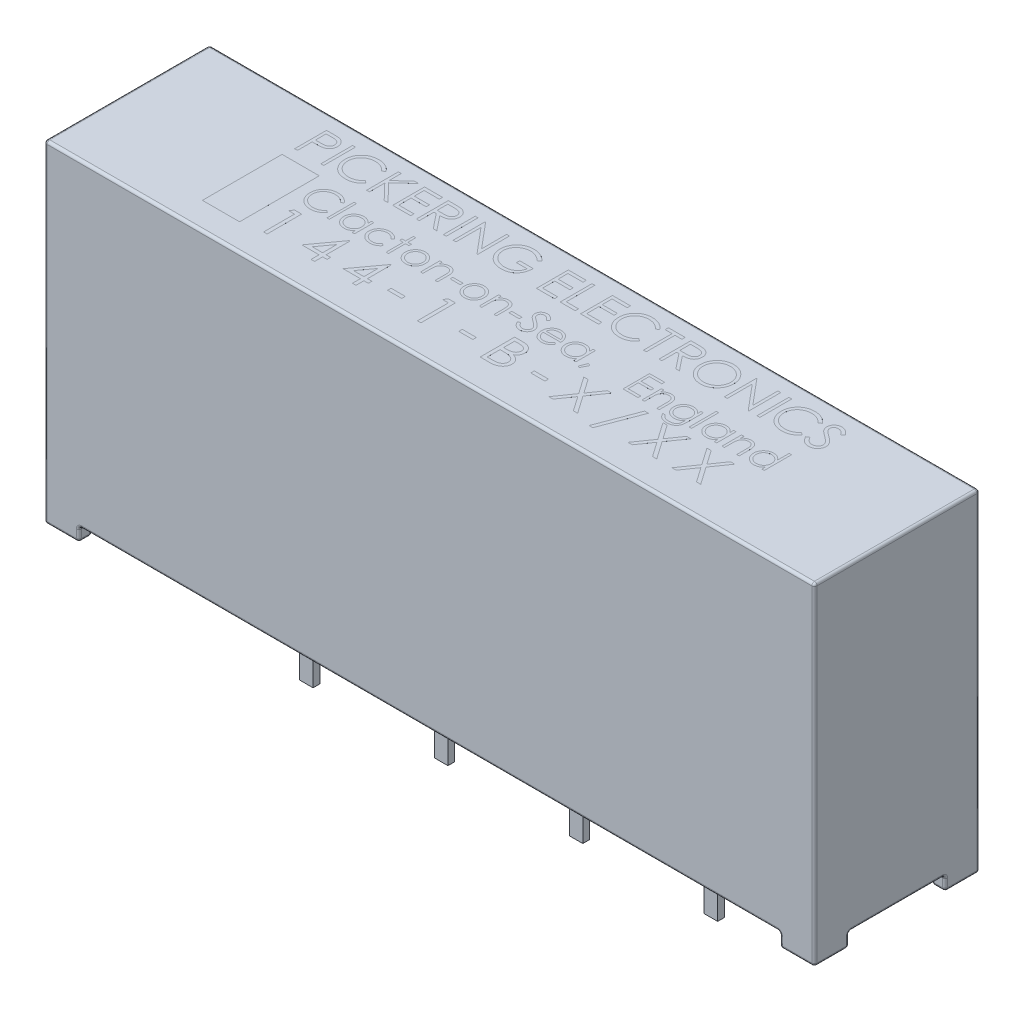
from build123d import *

# Parameters (mm, degrees)
SKETCH1_W               = 29
SKETCH1_H               = 6.22
MAIN_BODY_DEPTH         = 11.992
ORIGINAL_FOOT_DEPTH     = 0.508
RIGHT_FEET_COPY_1_DEPTH = 0.508
SKETCH3_W               = 0.508
SKETCH3_H               = 0.254
PINS_DEPTH              = 3.808
SKETCH4_W               = 1.4
SKETCH4_H               = 3
SKETCH4_W_2             = 0.107692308
SKETCH4_H_2             = 1.2
SKETCH4_W_3             = 0.08974359
SKETCH4_H_3             = 1.025641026
SKETCH4_W_4             = 0.384615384
SKETCH4_H_4             = 0.102564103
SKETCH4_W_5             = 0.533333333
SKETCH4_H_5             = 0.133333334
SKETCH4_W_6             = 0.533333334
LETTERING_DEPTH         = 0.0001
FILLET1_R               = 0.1


with BuildPart() as part:
    # Sketch1 → Main Body (new body)
    with BuildSketch(Plane(origin=(0, 0, 0), x_dir=(1, 0, 0), z_dir=(0, 1, 0))):
        Rectangle(SKETCH1_W, SKETCH1_H)
    extrude(amount=MAIN_BODY_DEPTH)

    # Sketch2 → Original foot (add)
    with BuildSketch(Plane.XZ):
        Polygon((-14.5, 3.11), (-13.2, 3.11), (-13.2, 2.61), (-14, 2.61), (-14, 1.81), (-14.5, 1.81), align=None)
    original_foot = extrude(amount=ORIGINAL_FOOT_DEPTH)

    # Left foot: Original foot across plane
    add(original_foot.mirror(Plane.XY))

    # Right Feet: Original foot across plane
    add(original_foot.mirror(Plane(origin=(0, 0, 0), x_dir=(0, 0, 1), z_dir=(1, 0, 0))))

    # Right Feet copy 1 sketch → Right Feet copy 1 (add)
    with BuildSketch(Plane(origin=(0, 0, 0), x_dir=(-1, 0, 0), z_dir=(0, -1, 0))):
        Polygon((-14.5, 3.11), (-13.2, 3.11), (-13.2, 2.61), (-14, 2.61), (-14, 1.81), (-14.5, 1.81), align=None)
    extrude(amount=RIGHT_FEET_COPY_1_DEPTH)

    # Sketch3 → Pins (add)
    with BuildSketch(Plane.XZ):
        with Locations((-2.54, 0)):
            Rectangle(SKETCH3_W, SKETCH3_H)
        with Locations((2.54, 0)):
            Rectangle(SKETCH3_W, SKETCH3_H)
        with Locations((7.62, 0)):
            Rectangle(SKETCH3_W, SKETCH3_H)
        with Locations((-7.62, 0)):
            Rectangle(SKETCH3_W, SKETCH3_H)
    extrude(amount=PINS_DEPTH)

    # Sketch4 → Lettering (add)
    # profile 1 of 55: a face of its own
    with BuildSketch(Plane(origin=(0, 11.992, 0), x_dir=(-1, 0, 0), z_dir=(0, 1, 0))):
        with Locations((8.85, 0.61)):
            Rectangle(SKETCH4_W, SKETCH4_H)
    # profile 2 of 55: a face of its own
    with BuildSketch(Plane(origin=(0, 11.992, 0), x_dir=(-1, 0, 0), z_dir=(0, 1, 0))):
        with BuildLine():
            Line((9.496153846, -2.51), (9.260817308, -2.51))
            add(Edge.make_bspline(
                [(9.260817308, -2.51), (9.244630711, -2.509982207), (9.213616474, -2.509948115), (9.16914274, -2.508914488), (9.128750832, -2.507533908), (9.092527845, -2.505620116), (9.060362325, -2.503358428), (9.032399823, -2.5001863), (9.008420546, -2.496874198), (8.994052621, -2.493506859), (8.9875, -2.491971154)],
                knots=[0, 0, 0, 0, 1.415646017, 2.712440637, 3.8905458, 4.950247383, 5.884950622, 6.709939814, 7.411656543, 8, 8, 8, 8], degree=3))
            add(Edge.make_bspline(
                [(8.9875, -2.491971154), (8.979205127, -2.489700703), (8.962810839, -2.4852133), (8.939186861, -2.476226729), (8.916714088, -2.465566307), (8.895298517, -2.453434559), (8.875307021, -2.439258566), (8.856115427, -2.423856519), (8.838126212, -2.406605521), (8.821611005, -2.387528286), (8.806308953, -2.367249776), (8.793500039, -2.345252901), (8.782189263, -2.32230074), (8.773374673, -2.29783291), (8.766446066, -2.272172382), (8.761399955, -2.245252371), (8.758156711, -2.21713095), (8.757848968, -2.197909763), (8.757692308, -2.188125)],
                knots=[0, 0, 0, 0, 0.999333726, 1.975119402, 2.933498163, 3.889020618, 4.832249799, 5.779334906, 6.747801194, 7.724875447, 8.710438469, 9.696133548, 10.679360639, 11.681339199, 12.714023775, 13.766351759, 14.862936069, 16, 16, 16, 16], degree=3))
            add(Edge.make_bspline(
                [(8.757692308, -2.188125), (8.757836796, -2.178258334), (8.758119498, -2.158953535), (8.76151251, -2.130711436), (8.766082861, -2.103722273), (8.773110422, -2.07804589), (8.782314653, -2.053834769), (8.793111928, -2.030718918), (8.806134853, -2.009091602), (8.821098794, -1.988874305), (8.837745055, -1.970048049), (8.856003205, -1.952749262), (8.875799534, -1.937079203), (8.897071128, -1.923002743), (8.920025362, -1.910846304), (8.9443141, -1.899958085), (8.97014846, -1.890813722), (8.988025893, -1.886003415), (8.997115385, -1.883557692)],
                knots=[0, 0, 0, 0, 1.121902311, 2.195077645, 3.232258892, 4.234102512, 5.217864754, 6.176164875, 7.132989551, 8.084763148, 9.034132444, 9.988522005, 10.94243251, 11.903244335, 12.886203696, 13.894208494, 14.929344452, 16, 16, 16, 16], degree=3))
            add(Edge.make_bspline(
                [(8.997115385, -1.883557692), (9.004633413, -1.881960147), (9.02110961, -1.878459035), (9.048242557, -1.874523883), (9.079849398, -1.871296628), (9.115822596, -1.868284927), (9.156246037, -1.866689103), (9.20102701, -1.864815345), (9.250317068, -1.86393122), (9.284695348, -1.863875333), (9.302644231, -1.863846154)],
                knots=[0, 0, 0, 0, 0.601372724, 1.317943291, 2.144091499, 3.08771165, 4.142394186, 5.309582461, 6.595334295, 8, 8, 8, 8], degree=3))
            Line((9.302644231, -1.863846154), (9.388461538, -1.863846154))
            Line((9.388461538, -1.863846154), (9.388461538, -1.31))
            Line((9.388461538, -1.31), (9.496153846, -1.31))
            Line((9.496153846, -1.31), (9.496153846, -2.51))
        make_face()
        with BuildLine():
            Line((9.388461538, -2.386923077), (9.388461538, -1.986923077))
            Line((9.388461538, -1.986923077), (9.178365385, -1.984278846))
            add(Edge.make_bspline(
                [(9.178365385, -1.984278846), (9.168106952, -1.984272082), (9.148303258, -1.984259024), (9.119618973, -1.985648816), (9.093070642, -1.987160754), (9.068619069, -1.989605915), (9.046375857, -1.99258825), (9.026287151, -1.996575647), (9.008192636, -2.000642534), (8.987349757, -2.007699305), (8.964003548, -2.018345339), (8.938664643, -2.034246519), (8.917014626, -2.054278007), (8.898437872, -2.077044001), (8.883754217, -2.102396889), (8.873112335, -2.129447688), (8.866616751, -2.158093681), (8.865800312, -2.177674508), (8.865384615, -2.187644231)],
                knots=[0, 0, 0, 0, 1.160501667, 2.240324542, 3.248665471, 4.168823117, 5.020172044, 5.786515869, 6.485785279, 7.116517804, 8.272762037, 9.381837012, 10.485674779, 11.594342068, 12.695271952, 13.786226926, 14.872841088, 16, 16, 16, 16], degree=3))
            add(Edge.make_bspline(
                [(8.865384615, -2.187644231), (8.865818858, -2.197290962), (8.866682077, -2.21646747), (8.873058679, -2.244585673), (8.883866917, -2.271328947), (8.898449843, -2.296480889), (8.916581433, -2.319186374), (8.937800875, -2.338771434), (8.961778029, -2.354623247), (8.983907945, -2.365175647), (9.003712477, -2.37136381), (9.020831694, -2.37583135), (9.040259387, -2.378912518), (9.061811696, -2.381860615), (9.085461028, -2.384240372), (9.111357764, -2.385892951), (9.139415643, -2.386849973), (9.158893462, -2.386898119), (9.168990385, -2.386923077)],
                knots=[0, 0, 0, 0, 1.12039168, 2.227199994, 3.330242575, 4.460839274, 5.593542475, 6.693949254, 7.801736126, 8.92216649, 9.528704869, 10.210659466, 10.975987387, 11.81211542, 12.738540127, 13.736887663, 14.826846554, 16, 16, 16, 16], degree=3))
            Line((9.168990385, -2.386923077), (9.388461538, -2.386923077))
        make_face(mode=Mode.SUBTRACT)
    # profile 3 of 55: a face of its own
    with BuildSketch(Plane(origin=(0, 11.992, 0), x_dir=(-1, 0, 0), z_dir=(0, 1, 0))):
        with Locations((8.457692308, -1.91)):
            Rectangle(SKETCH4_W_2, SKETCH4_H_2)
    # profile 4 of 55: a face of its own
    with BuildSketch(Plane(origin=(0, 11.992, 0), x_dir=(-1, 0, 0), z_dir=(0, 1, 0))):
        with BuildLine():
            Line((7.034615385, -2.289807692), (7.128846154, -2.217692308))
            add(Edge.make_bspline(
                [(7.128846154, -2.217692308), (7.135568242, -2.225703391), (7.148921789, -2.241617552), (7.170403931, -2.263966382), (7.192796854, -2.284897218), (7.216069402, -2.304544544), (7.240760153, -2.322118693), (7.265928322, -2.338988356), (7.292488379, -2.353758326), (7.329029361, -2.371801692), (7.377017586, -2.390219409), (7.437218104, -2.406060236), (7.500148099, -2.416049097), (7.543071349, -2.417138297), (7.564903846, -2.417692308)],
                knots=[0, 0, 0, 0, 0.75789156, 1.505565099, 2.245254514, 2.979266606, 3.711207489, 4.440978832, 5.174393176, 5.91211879, 7.394186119, 8.890401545, 10.418332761, 12, 12, 12, 12], degree=3))
            add(Edge.make_bspline(
                [(7.564903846, -2.417692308), (7.57693226, -2.417553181), (7.600877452, -2.41727622), (7.636416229, -2.413648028), (7.671358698, -2.408489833), (7.705574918, -2.401022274), (7.738996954, -2.391300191), (7.771879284, -2.37989878), (7.803834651, -2.365710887), (7.835247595, -2.350042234), (7.865342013, -2.33233961), (7.893822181, -2.313036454), (7.920559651, -2.292323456), (7.945622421, -2.270249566), (7.968757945, -2.246557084), (7.990212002, -2.221512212), (8.009957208, -2.195001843), (8.027973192, -2.167152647), (8.044087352, -2.138102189), (8.058060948, -2.107975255), (8.069872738, -2.076886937), (8.079455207, -2.04490386), (8.086954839, -2.012139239), (8.092146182, -1.978475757), (8.095740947, -1.943972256), (8.096015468, -1.920586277), (8.096153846, -1.908798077)],
                knots=[0, 0, 0, 0, 1.054960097, 2.100129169, 3.131228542, 4.15308236, 5.169990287, 6.183953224, 7.204064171, 8.235355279, 9.262684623, 10.264978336, 11.252191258, 12.228402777, 13.192898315, 14.155264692, 15.119862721, 16.091023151, 17.063429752, 18.032246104, 19.00241354, 19.978852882, 20.959535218, 21.948948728, 22.966123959, 24, 24, 24, 24], degree=3))
            add(Edge.make_bspline(
                [(8.096153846, -1.908798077), (8.095720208, -1.89106202), (8.094868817, -1.856239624), (8.087323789, -1.805226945), (8.075766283, -1.756309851), (8.058728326, -1.709819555), (8.037300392, -1.665368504), (8.010564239, -1.623495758), (7.979481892, -1.583587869), (7.943734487, -1.546611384), (7.904508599, -1.512835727), (7.862423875, -1.483092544), (7.817583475, -1.458298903), (7.770482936, -1.437667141), (7.720759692, -1.421807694), (7.668503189, -1.410642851), (7.613827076, -1.403359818), (7.576466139, -1.402662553), (7.557451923, -1.402307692)],
                knots=[0, 0, 0, 0, 1.029159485, 2.020618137, 2.987588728, 3.942669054, 4.889339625, 5.846988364, 6.821327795, 7.821533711, 8.827683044, 9.822769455, 10.807800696, 11.797391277, 12.803701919, 13.832062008, 14.896664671, 16, 16, 16, 16], degree=3))
            add(Edge.make_bspline(
                [(7.557451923, -1.402307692), (7.53650243, -1.402886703), (7.495268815, -1.404026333), (7.434799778, -1.413680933), (7.376913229, -1.429335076), (7.321606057, -1.451242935), (7.269034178, -1.479722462), (7.219115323, -1.514247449), (7.171807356, -1.555146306), (7.143360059, -1.586374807), (7.128846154, -1.602307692)],
                knots=[0, 0, 0, 0, 1.028121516, 2.023589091, 2.998037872, 3.967518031, 4.937445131, 5.927275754, 6.942489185, 8, 8, 8, 8], degree=3))
            Line((7.128846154, -1.602307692), (7.034615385, -1.530913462))
            add(Edge.make_bspline(
                [(7.034615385, -1.530913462), (7.042198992, -1.521129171), (7.057329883, -1.501607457), (7.08182598, -1.474080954), (7.107649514, -1.448211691), (7.134870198, -1.424134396), (7.163523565, -1.401728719), (7.193597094, -1.381098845), (7.224940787, -1.362015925), (7.257593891, -1.3447195), (7.291558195, -1.329328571), (7.32654263, -1.315876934), (7.362611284, -1.304581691), (7.399479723, -1.295091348), (7.437526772, -1.288313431), (7.476317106, -1.282919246), (7.516211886, -1.279718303), (7.543103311, -1.279394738), (7.556730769, -1.279230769)],
                knots=[0, 0, 0, 0, 0.986880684, 1.969034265, 2.935876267, 3.899990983, 4.864973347, 5.834408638, 6.8063673, 7.789580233, 8.778939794, 9.778051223, 10.776304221, 11.791326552, 12.811423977, 13.855999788, 14.91350973, 16, 16, 16, 16], degree=3))
            add(Edge.make_bspline(
                [(7.556730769, -1.279230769), (7.569637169, -1.279320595), (7.595157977, -1.279498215), (7.632837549, -1.28237553), (7.669519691, -1.286301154), (7.705099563, -1.292212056), (7.739771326, -1.299187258), (7.773220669, -1.308537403), (7.805776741, -1.319011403), (7.837308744, -1.331321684), (7.867843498, -1.345212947), (7.897282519, -1.36091291), (7.925612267, -1.378289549), (7.953111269, -1.396959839), (7.979373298, -1.417523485), (8.004625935, -1.439694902), (8.029010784, -1.463399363), (8.044097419, -1.480492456), (8.051682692, -1.489086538)],
                knots=[0, 0, 0, 0, 1.114604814, 2.203992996, 3.262667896, 4.300477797, 5.318619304, 6.316056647, 7.298880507, 8.271930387, 9.238335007, 10.195173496, 11.151986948, 12.108099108, 13.064862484, 14.031167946, 15.010108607, 16, 16, 16, 16], degree=3))
            add(Edge.make_bspline(
                [(8.051682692, -1.489086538), (8.063831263, -1.504015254), (8.087981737, -1.533692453), (8.118893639, -1.581785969), (8.145265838, -1.631954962), (8.166826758, -1.684490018), (8.18338806, -1.739411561), (8.195031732, -1.796631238), (8.202545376, -1.856034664), (8.203407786, -1.89643528), (8.203846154, -1.916971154)],
                knots=[0, 0, 0, 0, 0.994611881, 1.977215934, 2.950189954, 3.921972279, 4.908960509, 5.911694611, 6.938501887, 8, 8, 8, 8], degree=3))
            add(Edge.make_bspline(
                [(8.203846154, -1.916971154), (8.20331056, -1.938554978), (8.202256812, -1.981019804), (8.193378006, -2.043355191), (8.178921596, -2.102990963), (8.159015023, -2.160156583), (8.132752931, -2.214524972), (8.100960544, -2.26632575), (8.063327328, -2.315516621), (8.02032592, -2.361468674), (7.973157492, -2.403481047), (7.922648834, -2.440443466), (7.868894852, -2.47120368), (7.812488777, -2.496916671), (7.75300796, -2.516680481), (7.69057938, -2.530515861), (7.625320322, -2.539127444), (7.580796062, -2.540216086), (7.558173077, -2.540769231)],
                knots=[0, 0, 0, 0, 1.032901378, 2.032168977, 3.007206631, 3.966850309, 4.924221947, 5.891988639, 6.871730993, 7.884084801, 8.900290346, 9.89161143, 10.874607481, 11.860025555, 12.854717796, 13.869097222, 14.917278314, 16, 16, 16, 16], degree=3))
            add(Edge.make_bspline(
                [(7.558173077, -2.540769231), (7.544385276, -2.540603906), (7.517093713, -2.540276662), (7.476721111, -2.537086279), (7.437416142, -2.531766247), (7.399069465, -2.524515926), (7.36161783, -2.515497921), (7.325229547, -2.504206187), (7.290008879, -2.490553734), (7.255718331, -2.475358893), (7.222797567, -2.457956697), (7.191262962, -2.439041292), (7.161370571, -2.418248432), (7.132926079, -2.395881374), (7.106060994, -2.371768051), (7.080372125, -2.346313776), (7.056622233, -2.318843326), (7.041964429, -2.299503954), (7.034615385, -2.289807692)],
                knots=[0, 0, 0, 0, 1.096566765, 2.170543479, 3.218870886, 4.250164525, 5.273529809, 6.281496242, 7.278154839, 8.276706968, 9.263143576, 10.238168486, 11.199979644, 12.157579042, 13.114563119, 14.070017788, 15.032356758, 16, 16, 16, 16], degree=3))
        make_face()
    # profile 5 of 55: a face of its own
    with BuildSketch(Plane(origin=(0, 11.992, 0), x_dir=(-1, 0, 0), z_dir=(0, 1, 0))):
        Polygon((6.788461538, -2.51), (6.680769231, -2.51), (6.680769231, -2.053028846), (6.180528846, -2.51), (6.026923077, -2.51), (6.616586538, -1.971538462), (5.980769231, -1.31), (6.124278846, -1.31), (6.680769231, -1.889086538), (6.680769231, -1.31), (6.788461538, -1.31), align=None)
    # profile 6 of 55: a face of its own
    with BuildSketch(Plane(origin=(0, 11.992, 0), x_dir=(-1, 0, 0), z_dir=(0, 1, 0))):
        Polygon((5.803846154, -2.51), (5.126923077, -2.51), (5.126923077, -2.386923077), (5.696153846, -2.386923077), (5.696153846, -2.017692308), (5.126923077, -2.017692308), (5.126923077, -1.894615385), (5.696153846, -1.894615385), (5.696153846, -1.433076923), (5.126923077, -1.433076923), (5.126923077, -1.31), (5.803846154, -1.31), align=None)
    # profile 7 of 55: a face of its own
    with BuildSketch(Plane(origin=(0, 11.992, 0), x_dir=(-1, 0, 0), z_dir=(0, 1, 0))):
        with BuildLine():
            Line((4.911538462, -2.51), (4.671394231, -2.51))
            add(Edge.make_bspline(
                [(4.671394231, -2.51), (4.655368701, -2.509946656), (4.624597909, -2.50984423), (4.580515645, -2.509273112), (4.54046064, -2.50763619), (4.504453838, -2.506227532), (4.472495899, -2.503658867), (4.444488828, -2.501203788), (4.420561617, -2.497989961), (4.406077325, -2.495005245), (4.399519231, -2.493653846)],
                knots=[0, 0, 0, 0, 1.410062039, 2.707475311, 3.878576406, 4.937260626, 5.877586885, 6.699081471, 7.410979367, 8, 8, 8, 8], degree=3))
            add(Edge.make_bspline(
                [(4.399519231, -2.493653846), (4.390739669, -2.49148491), (4.373367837, -2.487193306), (4.348358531, -2.478117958), (4.324517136, -2.467632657), (4.301930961, -2.455223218), (4.280605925, -2.441099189), (4.260544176, -2.425203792), (4.242014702, -2.407400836), (4.224358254, -2.388427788), (4.208940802, -2.367458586), (4.195061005, -2.345557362), (4.183409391, -2.322302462), (4.174240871, -2.297811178), (4.166554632, -2.272323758), (4.161388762, -2.245588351), (4.158171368, -2.217691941), (4.157853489, -2.198710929), (4.157692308, -2.189086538)],
                knots=[0, 0, 0, 0, 1.027276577, 2.032638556, 3.019345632, 3.985365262, 4.957888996, 5.923693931, 6.890056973, 7.876427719, 8.865527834, 9.843495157, 10.821038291, 11.815616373, 12.812734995, 13.843357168, 14.906466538, 16, 16, 16, 16], degree=3))
            add(Edge.make_bspline(
                [(4.157692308, -2.189086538), (4.158195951, -2.173097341), (4.15917869, -2.141898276), (4.168341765, -2.096620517), (4.18335019, -2.054383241), (4.20403492, -2.015245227), (4.230363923, -1.979948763), (4.262005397, -1.949051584), (4.298797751, -1.922957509), (4.333209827, -1.905054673), (4.363622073, -1.893535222), (4.388732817, -1.885389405), (4.416145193, -1.87920187), (4.445465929, -1.873578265), (4.476921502, -1.869287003), (4.510448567, -1.866239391), (4.546130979, -1.864279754), (4.570590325, -1.863993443), (4.583173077, -1.863846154)],
                knots=[0, 0, 0, 0, 1.260402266, 2.459371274, 3.627181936, 4.786749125, 5.93865593, 7.087644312, 8.261344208, 9.485713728, 10.136162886, 10.825977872, 11.566646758, 12.35154167, 13.181268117, 14.0701832, 15.007234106, 16, 16, 16, 16], degree=3))
            Line((4.583173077, -1.863846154), (4.142307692, -1.31))
            Line((4.142307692, -1.31), (4.275480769, -1.31))
            Line((4.275480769, -1.31), (4.716346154, -1.863846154))
            Line((4.716346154, -1.863846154), (4.803846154, -1.863846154))
            Line((4.803846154, -1.863846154), (4.803846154, -1.31))
            Line((4.803846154, -1.31), (4.911538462, -1.31))
            Line((4.911538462, -1.31), (4.911538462, -2.51))
        make_face()
        with BuildLine():
            Line((4.803846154, -2.386923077), (4.803846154, -1.986923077))
            Line((4.803846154, -1.986923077), (4.584134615, -1.985240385))
            add(Edge.make_bspline(
                [(4.584134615, -1.985240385), (4.573876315, -1.985235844), (4.553992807, -1.985227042), (4.525226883, -1.986596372), (4.498442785, -1.988153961), (4.473743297, -1.990536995), (4.451116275, -1.993606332), (4.430576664, -1.997451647), (4.412079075, -2.001912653), (4.390574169, -2.008887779), (4.366284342, -2.019462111), (4.34043109, -2.03585853), (4.317823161, -2.055687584), (4.299027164, -2.078648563), (4.283930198, -2.10400223), (4.27344401, -2.131174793), (4.266533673, -2.159738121), (4.265772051, -2.179350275), (4.265384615, -2.189326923)],
                knots=[0, 0, 0, 0, 1.146399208, 2.222048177, 3.218135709, 4.144938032, 4.994811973, 5.769438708, 6.479732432, 7.119818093, 8.294689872, 9.430121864, 10.527913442, 11.641375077, 12.733452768, 13.811150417, 14.886538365, 16, 16, 16, 16], degree=3))
            add(Edge.make_bspline(
                [(4.265384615, -2.189326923), (4.265791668, -2.198979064), (4.266598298, -2.218106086), (4.273333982, -2.246044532), (4.284332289, -2.272610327), (4.299386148, -2.297437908), (4.318122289, -2.31980791), (4.339945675, -2.338889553), (4.364342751, -2.354742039), (4.386960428, -2.365201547), (4.407324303, -2.371355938), (4.424923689, -2.375823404), (4.444982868, -2.378952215), (4.467265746, -2.381829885), (4.491870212, -2.38426683), (4.518811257, -2.385884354), (4.54806962, -2.386851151), (4.568348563, -2.386898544), (4.578846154, -2.386923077)],
                knots=[0, 0, 0, 0, 1.100596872, 2.180981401, 3.259506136, 4.371595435, 5.481727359, 6.576991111, 7.667816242, 8.793363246, 9.406619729, 10.09427138, 10.864108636, 11.721733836, 12.6590937, 13.685439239, 14.801845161, 16, 16, 16, 16], degree=3))
            Line((4.578846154, -2.386923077), (4.803846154, -2.386923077))
        make_face(mode=Mode.SUBTRACT)
    # profile 8 of 55: a face of its own
    with BuildSketch(Plane(origin=(0, 11.992, 0), x_dir=(-1, 0, 0), z_dir=(0, 1, 0))):
        with Locations((3.842307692, -1.91)):
            Rectangle(SKETCH4_W_2, SKETCH4_H_2)
    # profile 9 of 55: a face of its own
    with BuildSketch(Plane(origin=(0, 11.992, 0), x_dir=(-1, 0, 0), z_dir=(0, 1, 0))):
        Polygon((3.526923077, -1.31), (3.526923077, -2.51), (3.504326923, -2.51), (2.711538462, -1.565528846), (2.711538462, -2.51), (2.603846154, -2.51), (2.603846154, -1.31), (2.628365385, -1.31), (3.419230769, -2.252307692), (3.419230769, -1.31), align=None)
    # profile 10 of 55: a face of its own
    with BuildSketch(Plane(origin=(0, 11.992, 0), x_dir=(-1, 0, 0), z_dir=(0, 1, 0))):
        with BuildLine():
            Line((1.173076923, -2.305192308), (1.265384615, -2.217692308))
            add(Edge.make_bspline(
                [(1.265384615, -2.217692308), (1.282186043, -2.233384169), (1.315299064, -2.264310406), (1.369026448, -2.304884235), (1.425160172, -2.33937083), (1.483243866, -2.367704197), (1.542157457, -2.38972872), (1.600724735, -2.405653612), (1.658535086, -2.415895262), (1.696914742, -2.417098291), (1.715865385, -2.417692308)],
                knots=[0, 0, 0, 0, 1.091957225, 2.152079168, 3.193085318, 4.218301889, 5.218403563, 6.17723952, 7.099979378, 8, 8, 8, 8], degree=3))
            add(Edge.make_bspline(
                [(1.715865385, -2.417692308), (1.727493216, -2.417550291), (1.750718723, -2.417266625), (1.785218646, -2.413654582), (1.819352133, -2.408443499), (1.853001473, -2.40098118), (1.886300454, -2.391288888), (1.919174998, -2.379586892), (1.951561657, -2.365500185), (1.983290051, -2.349440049), (2.01420648, -2.331907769), (2.043283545, -2.312354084), (2.070642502, -2.291380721), (2.096089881, -2.268712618), (2.119974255, -2.244727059), (2.141858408, -2.219083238), (2.162220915, -2.192160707), (2.180300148, -2.163573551), (2.196641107, -2.134134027), (2.210790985, -2.104076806), (2.22297485, -2.073613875), (2.232710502, -2.042728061), (2.240537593, -2.011439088), (2.24607771, -1.979795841), (2.249189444, -1.947642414), (2.249728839, -1.92611207), (2.25, -1.915288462)],
                knots=[0, 0, 0, 0, 1.028307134, 2.053947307, 3.065600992, 4.082111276, 5.100671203, 6.132125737, 7.167228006, 8.222953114, 9.277225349, 10.309459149, 11.320441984, 12.324791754, 13.322338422, 14.312705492, 15.305176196, 16.306142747, 17.302479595, 18.282363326, 19.243345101, 20.20291386, 21.145121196, 22.094978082, 23.042318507, 24, 24, 24, 24], degree=3))
            add(Edge.make_bspline(
                [(2.25, -1.915288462), (2.249738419, -1.904224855), (2.249215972, -1.882127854), (2.245940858, -1.849136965), (2.239657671, -1.816703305), (2.231982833, -1.784520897), (2.22111931, -1.753000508), (2.208490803, -1.721680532), (2.193263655, -1.69085205), (2.175729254, -1.660729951), (2.156351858, -1.631416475), (2.135043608, -1.603571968), (2.11176426, -1.57752184), (2.086941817, -1.552885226), (2.060349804, -1.529817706), (2.031730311, -1.508597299), (2.001483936, -1.488895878), (1.969597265, -1.470929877), (1.936407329, -1.454881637), (1.902376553, -1.440610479), (1.867395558, -1.428857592), (1.831648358, -1.419278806), (1.79517752, -1.411427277), (1.757797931, -1.406376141), (1.719784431, -1.402710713), (1.694159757, -1.402442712), (1.68125, -1.402307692)],
                knots=[0, 0, 0, 0, 0.935896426, 1.86923723, 2.799743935, 3.728471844, 4.66505513, 5.616527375, 6.583419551, 7.570341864, 8.562833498, 9.553750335, 10.533080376, 11.5155245, 12.510142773, 13.507781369, 14.526649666, 15.561487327, 16.601173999, 17.643331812, 18.680652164, 19.71969803, 20.772446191, 21.833473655, 22.9085001, 24, 24, 24, 24], degree=3))
            add(Edge.make_bspline(
                [(1.68125, -1.402307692), (1.665691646, -1.402632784), (1.63514029, -1.403271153), (1.590231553, -1.408244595), (1.547095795, -1.41600224), (1.505873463, -1.427398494), (1.466414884, -1.441823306), (1.428865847, -1.459661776), (1.393121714, -1.480725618), (1.359340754, -1.504590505), (1.328312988, -1.5311735), (1.300110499, -1.559626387), (1.275559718, -1.590176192), (1.254500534, -1.622816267), (1.236374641, -1.657065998), (1.221915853, -1.693512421), (1.210732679, -1.731748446), (1.206157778, -1.758182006), (1.203846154, -1.771538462)],
                knots=[0, 0, 0, 0, 1.130234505, 2.219399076, 3.279128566, 4.311639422, 5.322903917, 6.328167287, 7.327698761, 8.334124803, 9.329374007, 10.292761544, 11.24113083, 12.171311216, 13.111441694, 14.052040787, 15.015727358, 16, 16, 16, 16], degree=3))
            Line((1.203846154, -1.771538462), (1.603846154, -1.771538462))
            Line((1.603846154, -1.771538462), (1.603846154, -1.894615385))
            Line((1.603846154, -1.894615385), (1.096153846, -1.894615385))
            add(Edge.make_bspline(
                [(1.096153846, -1.894615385), (1.096738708, -1.871675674), (1.09788339, -1.826778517), (1.105912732, -1.761302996), (1.118878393, -1.699461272), (1.1365905, -1.641188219), (1.159519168, -1.586566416), (1.187418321, -1.535540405), (1.220734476, -1.488439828), (1.258280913, -1.44488017), (1.300418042, -1.40602444), (1.346007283, -1.371873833), (1.395123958, -1.343107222), (1.447721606, -1.319703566), (1.50362804, -1.301438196), (1.562972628, -1.288487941), (1.625674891, -1.280729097), (1.668647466, -1.279737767), (1.690625, -1.279230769)],
                knots=[0, 0, 0, 0, 1.140356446, 2.231883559, 3.274166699, 4.278491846, 5.25512956, 6.21435461, 7.1637429, 8.11826594, 9.068280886, 10.0076534, 10.945064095, 11.891975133, 12.864533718, 13.863980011, 14.907571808, 16, 16, 16, 16], degree=3))
            add(Edge.make_bspline(
                [(1.690625, -1.279230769), (1.704171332, -1.279425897), (1.730889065, -1.27981075), (1.770348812, -1.282545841), (1.808720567, -1.286756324), (1.845998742, -1.293114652), (1.882320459, -1.300902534), (1.917504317, -1.310875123), (1.951684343, -1.322418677), (1.984913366, -1.335548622), (2.016889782, -1.350761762), (2.047756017, -1.367667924), (2.077682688, -1.386179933), (2.106465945, -1.406617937), (2.134255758, -1.428829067), (2.160872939, -1.452857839), (2.186466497, -1.478630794), (2.202498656, -1.496932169), (2.210576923, -1.506153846)],
                knots=[0, 0, 0, 0, 1.107784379, 2.184907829, 3.233506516, 4.263428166, 5.276301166, 6.270063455, 7.25232949, 8.225834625, 9.190232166, 10.146266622, 11.1027726, 12.066435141, 13.031522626, 14.010570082, 14.99756817, 16, 16, 16, 16], degree=3))
            add(Edge.make_bspline(
                [(2.210576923, -1.506153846), (2.222297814, -1.520783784), (2.245545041, -1.549800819), (2.275468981, -1.596292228), (2.300978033, -1.644430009), (2.321675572, -1.694348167), (2.337837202, -1.746000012), (2.349427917, -1.79931954), (2.356218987, -1.854375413), (2.357197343, -1.891632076), (2.357692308, -1.910480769)],
                knots=[0, 0, 0, 0, 1.023165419, 2.029347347, 3.013907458, 3.994755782, 4.975994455, 5.96558838, 6.970761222, 8, 8, 8, 8], degree=3))
            add(Edge.make_bspline(
                [(2.357692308, -1.910480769), (2.357509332, -1.924594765), (2.357145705, -1.952643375), (2.352755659, -1.994288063), (2.346419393, -2.035182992), (2.337241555, -2.075366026), (2.325165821, -2.114658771), (2.310663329, -2.153363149), (2.293676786, -2.191324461), (2.273854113, -2.228206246), (2.252277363, -2.263995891), (2.228014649, -2.297566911), (2.202413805, -2.329568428), (2.174248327, -2.359094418), (2.144573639, -2.387088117), (2.112651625, -2.412811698), (2.079006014, -2.436699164), (2.043365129, -2.458283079), (2.006294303, -2.477677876), (1.967873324, -2.494679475), (1.928116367, -2.50873101), (1.887320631, -2.520653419), (1.845177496, -2.529470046), (1.801992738, -2.5358639), (1.757541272, -2.540238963), (1.727494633, -2.540590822), (1.712259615, -2.540769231)],
                knots=[0, 0, 0, 0, 1.009025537, 2.005226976, 2.991671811, 3.967589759, 4.950148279, 5.929425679, 6.922109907, 7.921964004, 8.922507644, 9.908469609, 10.882248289, 11.851158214, 12.824245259, 13.798023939, 14.780666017, 15.773333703, 16.775582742, 17.771174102, 18.775387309, 19.789283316, 20.80873549, 21.851817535, 22.910773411, 24, 24, 24, 24], degree=3))
            add(Edge.make_bspline(
                [(1.712259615, -2.540769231), (1.699834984, -2.540571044), (1.675198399, -2.540178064), (1.638539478, -2.537440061), (1.602519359, -2.533148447), (1.56695735, -2.527147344), (1.531988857, -2.519208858), (1.497507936, -2.509534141), (1.463579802, -2.498332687), (1.430244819, -2.484963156), (1.397276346, -2.46979101), (1.364491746, -2.452711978), (1.332002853, -2.433434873), (1.299753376, -2.411902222), (1.267539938, -2.38848391), (1.235872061, -2.362510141), (1.203985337, -2.335005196), (1.183481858, -2.315228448), (1.173076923, -2.305192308)],
                knots=[0, 0, 0, 0, 0.985875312, 1.954874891, 2.915472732, 3.863573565, 4.815313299, 5.759461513, 6.704487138, 7.649063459, 8.607849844, 9.583336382, 10.581114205, 11.603942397, 12.659508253, 13.739925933, 14.853076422, 16, 16, 16, 16], degree=3))
        make_face()
    # profile 11 of 55: a face of its own
    with BuildSketch(Plane(origin=(0, 11.992, 0), x_dir=(-1, 0, 0), z_dir=(0, 1, 0))):
        Polygon((0.388461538, -2.51), (-0.288461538, -2.51), (-0.288461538, -2.386923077), (0.280769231, -2.386923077), (0.280769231, -2.017692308), (-0.288461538, -2.017692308), (-0.288461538, -1.894615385), (0.280769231, -1.894615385), (0.280769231, -1.433076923), (-0.288461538, -1.433076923), (-0.288461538, -1.31), (0.388461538, -1.31), align=None)
    # profile 12 of 55: a face of its own
    with BuildSketch(Plane(origin=(0, 11.992, 0), x_dir=(-1, 0, 0), z_dir=(0, 1, 0))):
        Polygon((-0.503846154, -2.51), (-0.611538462, -2.51), (-0.611538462, -1.433076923), (-1.073076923, -1.433076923), (-1.073076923, -1.31), (-0.503846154, -1.31), align=None)
    # profile 13 of 55: a face of its own
    with BuildSketch(Plane(origin=(0, 11.992, 0), x_dir=(-1, 0, 0), z_dir=(0, 1, 0))):
        Polygon((-1.273076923, -2.51), (-1.95, -2.51), (-1.95, -2.386923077), (-1.380769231, -2.386923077), (-1.380769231, -2.017692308), (-1.95, -2.017692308), (-1.95, -1.894615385), (-1.380769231, -1.894615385), (-1.380769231, -1.433076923), (-1.95, -1.433076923), (-1.95, -1.31), (-1.273076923, -1.31), align=None)
    # profile 14 of 55: a face of its own
    with BuildSketch(Plane(origin=(0, 11.992, 0), x_dir=(-1, 0, 0), z_dir=(0, 1, 0))):
        with BuildLine():
            Line((-3.273076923, -2.289807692), (-3.178846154, -2.217692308))
            add(Edge.make_bspline(
                [(-3.178846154, -2.217692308), (-3.172124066, -2.225703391), (-3.158770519, -2.241617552), (-3.137288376, -2.263966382), (-3.114895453, -2.284897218), (-3.091622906, -2.304544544), (-3.066932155, -2.322118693), (-3.041763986, -2.338988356), (-3.015203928, -2.353758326), (-2.978662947, -2.371801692), (-2.930674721, -2.390219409), (-2.870474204, -2.406060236), (-2.807544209, -2.416049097), (-2.764620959, -2.417138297), (-2.742788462, -2.417692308)],
                knots=[0, 0, 0, 0, 0.75789156, 1.505565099, 2.245254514, 2.979266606, 3.711207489, 4.440978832, 5.174393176, 5.91211879, 7.394186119, 8.890401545, 10.418332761, 12, 12, 12, 12], degree=3))
            add(Edge.make_bspline(
                [(-2.742788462, -2.417692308), (-2.730760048, -2.417553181), (-2.706814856, -2.41727622), (-2.671276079, -2.413648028), (-2.63633361, -2.408489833), (-2.602117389, -2.401022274), (-2.568695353, -2.391300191), (-2.535813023, -2.37989878), (-2.503857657, -2.365710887), (-2.472444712, -2.350042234), (-2.442350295, -2.33233961), (-2.413870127, -2.313036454), (-2.387132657, -2.292323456), (-2.362069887, -2.270249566), (-2.338934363, -2.246557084), (-2.317480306, -2.221512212), (-2.297735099, -2.195001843), (-2.279719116, -2.167152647), (-2.263604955, -2.138102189), (-2.24963136, -2.107975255), (-2.23781957, -2.076886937), (-2.228237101, -2.04490386), (-2.220737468, -2.012139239), (-2.215546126, -1.978475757), (-2.211951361, -1.943972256), (-2.21167684, -1.920586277), (-2.211538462, -1.908798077)],
                knots=[0, 0, 0, 0, 1.054960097, 2.100129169, 3.131228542, 4.15308236, 5.169990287, 6.183953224, 7.204064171, 8.235355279, 9.262684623, 10.264978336, 11.252191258, 12.228402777, 13.192898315, 14.155264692, 15.119862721, 16.091023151, 17.063429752, 18.032246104, 19.00241354, 19.978852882, 20.959535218, 21.948948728, 22.966123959, 24, 24, 24, 24], degree=3))
            add(Edge.make_bspline(
                [(-2.211538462, -1.908798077), (-2.2119721, -1.89106202), (-2.21282349, -1.856239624), (-2.220368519, -1.805226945), (-2.231926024, -1.756309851), (-2.248963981, -1.709819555), (-2.270391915, -1.665368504), (-2.297128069, -1.623495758), (-2.328210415, -1.583587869), (-2.36395782, -1.546611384), (-2.403183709, -1.512835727), (-2.445268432, -1.483092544), (-2.490108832, -1.458298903), (-2.537209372, -1.437667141), (-2.586932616, -1.421807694), (-2.639189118, -1.410642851), (-2.693865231, -1.403359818), (-2.731226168, -1.402662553), (-2.750240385, -1.402307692)],
                knots=[0, 0, 0, 0, 1.029159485, 2.020618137, 2.987588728, 3.942669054, 4.889339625, 5.846988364, 6.821327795, 7.821533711, 8.827683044, 9.822769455, 10.807800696, 11.797391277, 12.803701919, 13.832062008, 14.896664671, 16, 16, 16, 16], degree=3))
            add(Edge.make_bspline(
                [(-2.750240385, -1.402307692), (-2.771189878, -1.402886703), (-2.812423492, -1.404026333), (-2.87289253, -1.413680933), (-2.930779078, -1.429335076), (-2.986086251, -1.451242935), (-3.03865813, -1.479722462), (-3.088576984, -1.514247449), (-3.135884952, -1.555146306), (-3.164332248, -1.586374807), (-3.178846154, -1.602307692)],
                knots=[0, 0, 0, 0, 1.028121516, 2.023589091, 2.998037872, 3.967518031, 4.937445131, 5.927275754, 6.942489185, 8, 8, 8, 8], degree=3))
            Line((-3.178846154, -1.602307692), (-3.273076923, -1.530913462))
            add(Edge.make_bspline(
                [(-3.273076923, -1.530913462), (-3.265493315, -1.521129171), (-3.250362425, -1.501607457), (-3.225866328, -1.474080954), (-3.200042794, -1.448211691), (-3.17282211, -1.424134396), (-3.144168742, -1.401728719), (-3.114095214, -1.381098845), (-3.082751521, -1.362015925), (-3.050098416, -1.3447195), (-3.016134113, -1.329328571), (-2.981149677, -1.315876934), (-2.945081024, -1.304581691), (-2.908212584, -1.295091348), (-2.870165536, -1.288313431), (-2.831375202, -1.282919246), (-2.791480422, -1.279718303), (-2.764588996, -1.279394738), (-2.750961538, -1.279230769)],
                knots=[0, 0, 0, 0, 0.986880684, 1.969034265, 2.935876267, 3.899990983, 4.864973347, 5.834408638, 6.8063673, 7.789580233, 8.778939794, 9.778051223, 10.776304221, 11.791326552, 12.811423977, 13.855999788, 14.91350973, 16, 16, 16, 16], degree=3))
            add(Edge.make_bspline(
                [(-2.750961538, -1.279230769), (-2.738055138, -1.279320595), (-2.71253433, -1.279498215), (-2.674854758, -1.28237553), (-2.638172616, -1.286301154), (-2.602592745, -1.292212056), (-2.567920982, -1.299187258), (-2.534471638, -1.308537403), (-2.501915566, -1.319011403), (-2.470383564, -1.331321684), (-2.43984881, -1.345212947), (-2.410409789, -1.36091291), (-2.38208004, -1.378289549), (-2.354581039, -1.396959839), (-2.32831901, -1.417523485), (-2.303066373, -1.439694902), (-2.278681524, -1.463399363), (-2.263594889, -1.480492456), (-2.256009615, -1.489086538)],
                knots=[0, 0, 0, 0, 1.114604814, 2.203992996, 3.262667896, 4.300477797, 5.318619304, 6.316056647, 7.298880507, 8.271930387, 9.238335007, 10.195173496, 11.151986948, 12.108099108, 13.064862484, 14.031167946, 15.010108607, 16, 16, 16, 16], degree=3))
            add(Edge.make_bspline(
                [(-2.256009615, -1.489086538), (-2.243861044, -1.504015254), (-2.21971057, -1.533692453), (-2.188798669, -1.581785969), (-2.16242647, -1.631954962), (-2.14086555, -1.684490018), (-2.124304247, -1.739411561), (-2.112660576, -1.796631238), (-2.105146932, -1.856034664), (-2.104284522, -1.89643528), (-2.103846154, -1.916971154)],
                knots=[0, 0, 0, 0, 0.994611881, 1.977215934, 2.950189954, 3.921972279, 4.908960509, 5.911694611, 6.938501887, 8, 8, 8, 8], degree=3))
            add(Edge.make_bspline(
                [(-2.103846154, -1.916971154), (-2.104381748, -1.938554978), (-2.105435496, -1.981019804), (-2.114314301, -2.043355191), (-2.128770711, -2.102990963), (-2.148677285, -2.160156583), (-2.174939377, -2.214524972), (-2.206731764, -2.26632575), (-2.24436498, -2.315516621), (-2.287366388, -2.361468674), (-2.334534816, -2.403481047), (-2.385043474, -2.440443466), (-2.438797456, -2.47120368), (-2.49520353, -2.496916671), (-2.554684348, -2.516680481), (-2.617112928, -2.530515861), (-2.682371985, -2.539127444), (-2.726896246, -2.540216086), (-2.749519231, -2.540769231)],
                knots=[0, 0, 0, 0, 1.032901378, 2.032168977, 3.007206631, 3.966850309, 4.924221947, 5.891988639, 6.871730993, 7.884084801, 8.900290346, 9.89161143, 10.874607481, 11.860025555, 12.854717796, 13.869097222, 14.917278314, 16, 16, 16, 16], degree=3))
            add(Edge.make_bspline(
                [(-2.749519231, -2.540769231), (-2.763307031, -2.540603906), (-2.790598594, -2.540276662), (-2.830971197, -2.537086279), (-2.870276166, -2.531766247), (-2.908622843, -2.524515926), (-2.946074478, -2.515497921), (-2.982462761, -2.504206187), (-3.017683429, -2.490553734), (-3.051973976, -2.475358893), (-3.08489474, -2.457956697), (-3.116429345, -2.439041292), (-3.146321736, -2.418248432), (-3.174766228, -2.395881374), (-3.201631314, -2.371768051), (-3.227320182, -2.346313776), (-3.251070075, -2.318843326), (-3.265727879, -2.299503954), (-3.273076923, -2.289807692)],
                knots=[0, 0, 0, 0, 1.096566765, 2.170543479, 3.218870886, 4.250164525, 5.273529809, 6.281496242, 7.278154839, 8.276706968, 9.263143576, 10.238168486, 11.199979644, 12.157579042, 13.114563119, 14.070017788, 15.032356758, 16, 16, 16, 16], degree=3))
        make_face()
    # profile 15 of 55: a face of its own
    with BuildSketch(Plane(origin=(0, 11.992, 0), x_dir=(-1, 0, 0), z_dir=(0, 1, 0))):
        Polygon((-3.380769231, -2.386923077), (-3.380769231, -2.51), (-4.011538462, -2.51), (-4.011538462, -2.386923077), (-3.75, -2.386923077), (-3.75, -1.31), (-3.642307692, -1.31), (-3.642307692, -2.386923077), align=None)
    # profile 16 of 55: a face of its own
    with BuildSketch(Plane(origin=(0, 11.992, 0), x_dir=(-1, 0, 0), z_dir=(0, 1, 0))):
        with BuildLine():
            Line((-4.226923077, -2.51), (-4.467067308, -2.51))
            add(Edge.make_bspline(
                [(-4.467067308, -2.51), (-4.483092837, -2.509946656), (-4.51386363, -2.50984423), (-4.557945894, -2.509273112), (-4.598000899, -2.50763619), (-4.634007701, -2.506227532), (-4.66596564, -2.503658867), (-4.693972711, -2.501203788), (-4.717899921, -2.497989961), (-4.732384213, -2.495005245), (-4.738942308, -2.493653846)],
                knots=[0, 0, 0, 0, 1.410062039, 2.707475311, 3.878576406, 4.937260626, 5.877586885, 6.699081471, 7.410979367, 8, 8, 8, 8], degree=3))
            add(Edge.make_bspline(
                [(-4.738942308, -2.493653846), (-4.74772187, -2.49148491), (-4.765093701, -2.487193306), (-4.790103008, -2.478117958), (-4.813944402, -2.467632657), (-4.836530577, -2.455223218), (-4.857855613, -2.441099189), (-4.877917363, -2.425203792), (-4.896446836, -2.407400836), (-4.914103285, -2.388427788), (-4.929520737, -2.367458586), (-4.943400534, -2.345557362), (-4.955052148, -2.322302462), (-4.964220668, -2.297811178), (-4.971906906, -2.272323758), (-4.977072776, -2.245588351), (-4.980290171, -2.217691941), (-4.980608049, -2.198710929), (-4.980769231, -2.189086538)],
                knots=[0, 0, 0, 0, 1.027276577, 2.032638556, 3.019345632, 3.985365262, 4.957888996, 5.923693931, 6.890056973, 7.876427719, 8.865527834, 9.843495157, 10.821038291, 11.815616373, 12.812734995, 13.843357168, 14.906466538, 16, 16, 16, 16], degree=3))
            add(Edge.make_bspline(
                [(-4.980769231, -2.189086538), (-4.980265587, -2.173097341), (-4.979282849, -2.141898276), (-4.970119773, -2.096620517), (-4.955111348, -2.054383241), (-4.934426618, -2.015245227), (-4.908097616, -1.979948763), (-4.876456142, -1.949051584), (-4.839663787, -1.922957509), (-4.805251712, -1.905054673), (-4.774839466, -1.893535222), (-4.749728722, -1.885389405), (-4.722316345, -1.87920187), (-4.692995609, -1.873578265), (-4.661540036, -1.869287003), (-4.628012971, -1.866239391), (-4.59233056, -1.864279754), (-4.567871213, -1.863993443), (-4.555288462, -1.863846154)],
                knots=[0, 0, 0, 0, 1.260402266, 2.459371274, 3.627181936, 4.786749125, 5.93865593, 7.087644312, 8.261344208, 9.485713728, 10.136162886, 10.825977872, 11.566646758, 12.35154167, 13.181268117, 14.0701832, 15.007234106, 16, 16, 16, 16], degree=3))
            Line((-4.555288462, -1.863846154), (-4.996153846, -1.31))
            Line((-4.996153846, -1.31), (-4.862980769, -1.31))
            Line((-4.862980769, -1.31), (-4.422115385, -1.863846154))
            Line((-4.422115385, -1.863846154), (-4.334615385, -1.863846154))
            Line((-4.334615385, -1.863846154), (-4.334615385, -1.31))
            Line((-4.334615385, -1.31), (-4.226923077, -1.31))
            Line((-4.226923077, -1.31), (-4.226923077, -2.51))
        make_face()
        with BuildLine():
            Line((-4.334615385, -2.386923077), (-4.334615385, -1.986923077))
            Line((-4.334615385, -1.986923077), (-4.554326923, -1.985240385))
            add(Edge.make_bspline(
                [(-4.554326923, -1.985240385), (-4.564585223, -1.985235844), (-4.584468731, -1.985227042), (-4.613234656, -1.986596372), (-4.640018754, -1.988153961), (-4.664718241, -1.990536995), (-4.687345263, -1.993606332), (-4.707884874, -1.997451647), (-4.726382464, -2.001912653), (-4.74788737, -2.008887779), (-4.772177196, -2.019462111), (-4.798030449, -2.03585853), (-4.820638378, -2.055687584), (-4.839434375, -2.078648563), (-4.854531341, -2.10400223), (-4.865017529, -2.131174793), (-4.871927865, -2.159738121), (-4.872689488, -2.179350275), (-4.873076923, -2.189326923)],
                knots=[0, 0, 0, 0, 1.146399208, 2.222048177, 3.218135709, 4.144938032, 4.994811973, 5.769438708, 6.479732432, 7.119818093, 8.294689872, 9.430121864, 10.527913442, 11.641375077, 12.733452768, 13.811150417, 14.886538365, 16, 16, 16, 16], degree=3))
            add(Edge.make_bspline(
                [(-4.873076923, -2.189326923), (-4.87266987, -2.198979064), (-4.871863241, -2.218106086), (-4.865127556, -2.246044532), (-4.85412925, -2.272610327), (-4.839075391, -2.297437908), (-4.820339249, -2.31980791), (-4.798515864, -2.338889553), (-4.774118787, -2.354742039), (-4.75150111, -2.365201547), (-4.731137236, -2.371355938), (-4.71353785, -2.375823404), (-4.693478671, -2.378952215), (-4.671195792, -2.381829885), (-4.646591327, -2.38426683), (-4.619650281, -2.385884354), (-4.590391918, -2.386851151), (-4.570112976, -2.386898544), (-4.559615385, -2.386923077)],
                knots=[0, 0, 0, 0, 1.100596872, 2.180981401, 3.259506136, 4.371595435, 5.481727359, 6.576991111, 7.667816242, 8.793363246, 9.406619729, 10.09427138, 10.864108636, 11.721733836, 12.6590937, 13.685439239, 14.801845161, 16, 16, 16, 16], degree=3))
            Line((-4.559615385, -2.386923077), (-4.334615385, -2.386923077))
        make_face(mode=Mode.SUBTRACT)
    # profile 17 of 55: a face of its own
    with BuildSketch(Plane(origin=(0, 11.992, 0), x_dir=(-1, 0, 0), z_dir=(0, 1, 0))):
        with BuildLine():
            add(Edge.make_bspline(
                [(-5.803846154, -2.540769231), (-5.826068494, -2.540215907), (-5.869715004, -2.539129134), (-5.933802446, -2.530535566), (-5.995168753, -2.516391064), (-6.053850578, -2.496417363), (-6.109619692, -2.470519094), (-6.162652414, -2.439078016), (-6.212766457, -2.401785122), (-6.259832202, -2.359525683), (-6.302610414, -2.31307373), (-6.33983439, -2.263204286), (-6.371515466, -2.210921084), (-6.397400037, -2.155883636), (-6.417739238, -2.098337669), (-6.431766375, -2.037940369), (-6.440728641, -1.97509281), (-6.441776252, -1.932226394), (-6.442307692, -1.910480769)],
                knots=[0, 0, 0, 0, 1.065027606, 2.091802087, 3.093458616, 4.079833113, 5.057734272, 6.036020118, 7.030157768, 8.047461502, 9.064242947, 10.052216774, 11.02588392, 11.989864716, 12.962978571, 13.945936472, 14.957997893, 16, 16, 16, 16], degree=3))
            add(Edge.make_bspline(
                [(-6.442307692, -1.910480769), (-6.441776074, -1.888895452), (-6.440728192, -1.846348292), (-6.431759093, -1.783897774), (-6.417676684, -1.723871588), (-6.397651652, -1.666409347), (-6.371748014, -1.611482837), (-6.340017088, -1.559163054), (-6.302876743, -1.509148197), (-6.260273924, -1.462470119), (-6.213751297, -1.419687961), (-6.16418996, -1.38186789), (-6.111649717, -1.350361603), (-6.056950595, -1.32409008), (-5.999548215, -1.30419291), (-5.93984742, -1.289693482), (-5.877509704, -1.280821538), (-5.835045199, -1.279766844), (-5.813461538, -1.279230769)],
                knots=[0, 0, 0, 0, 1.043683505, 2.0572211, 3.045299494, 4.022276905, 4.994977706, 5.977452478, 6.97747046, 8.003698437, 9.029677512, 10.031249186, 11.013723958, 11.988083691, 12.9614021, 13.946617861, 14.956316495, 16, 16, 16, 16], degree=3))
            add(Edge.make_bspline(
                [(-5.813461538, -1.279230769), (-5.791716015, -1.279761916), (-5.7488498, -1.280808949), (-5.685923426, -1.289786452), (-5.625483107, -1.303819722), (-5.567714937, -1.323893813), (-5.512599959, -1.349739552), (-5.460143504, -1.381500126), (-5.410282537, -1.4189256), (-5.363524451, -1.461494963), (-5.320793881, -1.50792838), (-5.283209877, -1.557424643), (-5.251632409, -1.609513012), (-5.22577576, -1.663978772), (-5.205324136, -1.720681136), (-5.191366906, -1.779976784), (-5.182337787, -1.84153345), (-5.18129722, -1.883445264), (-5.180769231, -1.904711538)],
                knots=[0, 0, 0, 0, 1.053167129, 2.076072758, 3.073341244, 4.055601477, 5.033424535, 6.017524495, 7.021518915, 8.049444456, 9.077120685, 10.074910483, 11.055688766, 12.022980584, 12.991883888, 13.970269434, 14.970104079, 16, 16, 16, 16], degree=3))
            add(Edge.make_bspline(
                [(-5.180769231, -1.904711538), (-5.180952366, -1.918985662), (-5.181316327, -1.947353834), (-5.185704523, -1.989478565), (-5.192059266, -2.030930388), (-5.201214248, -2.071569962), (-5.213023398, -2.111403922), (-5.227576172, -2.150350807), (-5.244253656, -2.188731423), (-5.264110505, -2.22581532), (-5.285774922, -2.261660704), (-5.309397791, -2.295819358), (-5.335143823, -2.327681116), (-5.362645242, -2.357757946), (-5.392282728, -2.385536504), (-5.423610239, -2.411622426), (-5.456791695, -2.435745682), (-5.491879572, -2.457399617), (-5.527979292, -2.477289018), (-5.565352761, -2.493895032), (-5.603211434, -2.508572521), (-5.641888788, -2.520236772), (-5.681295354, -2.529519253), (-5.721480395, -2.535826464), (-5.762402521, -2.540224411), (-5.789972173, -2.540586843), (-5.803846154, -2.540769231)],
                knots=[0, 0, 0, 0, 1.037115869, 2.061148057, 3.07517727, 4.084041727, 5.086514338, 6.092668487, 7.104487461, 8.125783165, 9.147610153, 10.147694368, 11.141876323, 12.122903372, 13.107606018, 14.091946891, 15.084523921, 16.086505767, 17.087268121, 18.077809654, 19.05670789, 20.036870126, 21.011670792, 21.99694167, 22.991993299, 24, 24, 24, 24], degree=3))
        make_face()
        with BuildLine():
            add(Edge.make_bspline(
                [(-5.809134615, -2.417692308), (-5.797746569, -2.417554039), (-5.775079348, -2.417278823), (-5.741384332, -2.413631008), (-5.708120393, -2.40847427), (-5.675360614, -2.40096571), (-5.643075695, -2.39134487), (-5.611229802, -2.379464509), (-5.579794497, -2.365594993), (-5.549057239, -2.349495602), (-5.519508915, -2.331449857), (-5.490971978, -2.312423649), (-5.464536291, -2.291338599), (-5.439691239, -2.268976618), (-5.416497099, -2.245029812), (-5.394950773, -2.219674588), (-5.375073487, -2.192796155), (-5.357103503, -2.164506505), (-5.341111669, -2.134963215), (-5.326793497, -2.104731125), (-5.314924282, -2.073454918), (-5.305522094, -2.041329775), (-5.297541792, -2.008497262), (-5.292535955, -1.974778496), (-5.28885319, -1.940289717), (-5.288593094, -1.91698152), (-5.288461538, -1.905192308)],
                knots=[0, 0, 0, 0, 1.008431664, 2.007222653, 2.999229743, 3.989431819, 4.982149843, 5.98167215, 6.998687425, 8.024288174, 9.053028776, 10.065052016, 11.06063401, 12.045759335, 13.024701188, 14.011819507, 14.991481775, 15.984022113, 16.97831254, 17.965966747, 18.945551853, 19.938269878, 20.93007375, 21.936103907, 22.956087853, 24, 24, 24, 24], degree=3))
            add(Edge.make_bspline(
                [(-5.288461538, -1.905192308), (-5.288899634, -1.887857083), (-5.289761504, -1.853753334), (-5.297275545, -1.803770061), (-5.308941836, -1.755687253), (-5.325855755, -1.709791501), (-5.347432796, -1.665878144), (-5.373752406, -1.624118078), (-5.405055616, -1.584523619), (-5.4405924, -1.547389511), (-5.479450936, -1.513509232), (-5.520693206, -1.483728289), (-5.563992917, -1.458663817), (-5.609100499, -1.437710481), (-5.656401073, -1.42192511), (-5.705591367, -1.410670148), (-5.756672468, -1.403375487), (-5.791481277, -1.402667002), (-5.809134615, -1.402307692)],
                knots=[0, 0, 0, 0, 1.032022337, 2.030307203, 3.003823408, 3.974715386, 4.937372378, 5.913284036, 6.909147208, 7.938749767, 8.970518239, 9.975863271, 10.963918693, 11.946286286, 12.933361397, 13.927862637, 14.949112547, 16, 16, 16, 16], degree=3))
            add(Edge.make_bspline(
                [(-5.809134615, -1.402307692), (-5.821000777, -1.40247059), (-5.84453494, -1.402793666), (-5.87953843, -1.40605229), (-5.913914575, -1.411267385), (-5.947599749, -1.418813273), (-5.980638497, -1.428131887), (-6.012929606, -1.439692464), (-6.044468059, -1.453544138), (-6.07538743, -1.46900614), (-6.105018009, -1.486444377), (-6.133023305, -1.505604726), (-6.159587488, -1.525974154), (-6.184387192, -1.54817419), (-6.2074845, -1.571918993), (-6.228645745, -1.597381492), (-6.248513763, -1.624058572), (-6.266357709, -1.652341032), (-6.282568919, -1.681650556), (-6.296466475, -1.711970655), (-6.30834251, -1.743109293), (-6.317914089, -1.775097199), (-6.325418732, -1.807860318), (-6.330588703, -1.841446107), (-6.334205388, -1.875786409), (-6.334477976, -1.89901288), (-6.334615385, -1.910721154)],
                knots=[0, 0, 0, 0, 1.047362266, 2.077233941, 3.100744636, 4.115120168, 5.122788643, 6.129711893, 7.140355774, 8.162227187, 9.180148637, 10.17298275, 11.156396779, 12.133377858, 13.108923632, 14.078087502, 15.054351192, 16.043448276, 17.028082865, 18.009331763, 18.985518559, 19.968016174, 20.954783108, 21.950335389, 22.966780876, 24, 24, 24, 24], degree=3))
            add(Edge.make_bspline(
                [(-6.334615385, -1.910721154), (-6.33447786, -1.922349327), (-6.334205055, -1.94541595), (-6.330590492, -1.979516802), (-6.325413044, -2.01286076), (-6.317951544, -2.045316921), (-6.308334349, -2.076893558), (-6.296475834, -2.107561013), (-6.282492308, -2.137433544), (-6.266443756, -2.166437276), (-6.248404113, -2.194268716), (-6.228691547, -2.220874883), (-6.206967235, -2.245758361), (-6.183846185, -2.269525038), (-6.158772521, -2.291699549), (-6.131741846, -2.312196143), (-6.103427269, -2.331938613), (-6.073188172, -2.349410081), (-6.042093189, -2.365628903), (-6.010153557, -2.379454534), (-5.97776868, -2.391397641), (-5.944895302, -2.400924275), (-5.911590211, -2.408481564), (-5.877844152, -2.413629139), (-5.843669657, -2.417279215), (-5.820682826, -2.417554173), (-5.809134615, -2.417692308)],
                knots=[0, 0, 0, 0, 1.02988216, 2.042960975, 3.035124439, 4.018561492, 4.99104521, 5.957523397, 6.929462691, 7.91146347, 8.892205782, 9.866320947, 10.842813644, 11.816825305, 12.802668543, 13.805243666, 14.821427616, 15.858893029, 16.897256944, 17.927432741, 18.940436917, 19.95373962, 20.957947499, 21.96413624, 22.977215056, 24, 24, 24, 24], degree=3))
        make_face(mode=Mode.SUBTRACT)
    # profile 18 of 55: a face of its own
    with BuildSketch(Plane(origin=(0, 11.992, 0), x_dir=(-1, 0, 0), z_dir=(0, 1, 0))):
        Polygon((-6.688461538, -1.31), (-6.688461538, -2.51), (-6.711057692, -2.51), (-7.503846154, -1.565528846), (-7.503846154, -2.51), (-7.611538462, -2.51), (-7.611538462, -1.31), (-7.587019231, -1.31), (-6.796153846, -2.252307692), (-6.796153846, -1.31), align=None)
    # profile 19 of 55: a face of its own
    with BuildSketch(Plane(origin=(0, 11.992, 0), x_dir=(-1, 0, 0), z_dir=(0, 1, 0))):
        with Locations((-7.973076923, -1.91)):
            Rectangle(SKETCH4_W_2, SKETCH4_H_2)
    # profile 20 of 55: a face of its own
    with BuildSketch(Plane(origin=(0, 11.992, 0), x_dir=(-1, 0, 0), z_dir=(0, 1, 0))):
        with BuildLine():
            Line((-9.396153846, -2.289807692), (-9.301923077, -2.217692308))
            add(Edge.make_bspline(
                [(-9.301923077, -2.217692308), (-9.295200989, -2.225703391), (-9.281847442, -2.241617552), (-9.260365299, -2.263966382), (-9.237972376, -2.284897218), (-9.214699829, -2.304544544), (-9.190009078, -2.322118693), (-9.164840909, -2.338988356), (-9.138280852, -2.353758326), (-9.10173987, -2.371801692), (-9.053751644, -2.390219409), (-8.993551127, -2.406060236), (-8.930621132, -2.416049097), (-8.887697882, -2.417138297), (-8.865865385, -2.417692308)],
                knots=[0, 0, 0, 0, 0.75789156, 1.505565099, 2.245254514, 2.979266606, 3.711207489, 4.440978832, 5.174393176, 5.91211879, 7.394186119, 8.890401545, 10.418332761, 12, 12, 12, 12], degree=3))
            add(Edge.make_bspline(
                [(-8.865865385, -2.417692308), (-8.853836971, -2.417553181), (-8.829891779, -2.41727622), (-8.794353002, -2.413648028), (-8.759410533, -2.408489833), (-8.725194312, -2.401022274), (-8.691772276, -2.391300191), (-8.658889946, -2.37989878), (-8.62693458, -2.365710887), (-8.595521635, -2.350042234), (-8.565427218, -2.33233961), (-8.53694705, -2.313036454), (-8.51020958, -2.292323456), (-8.48514681, -2.270249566), (-8.462011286, -2.246557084), (-8.440557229, -2.221512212), (-8.420812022, -2.195001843), (-8.402796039, -2.167152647), (-8.386681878, -2.138102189), (-8.372708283, -2.107975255), (-8.360896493, -2.076886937), (-8.351314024, -2.04490386), (-8.343814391, -2.012139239), (-8.338623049, -1.978475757), (-8.335028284, -1.943972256), (-8.334753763, -1.920586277), (-8.334615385, -1.908798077)],
                knots=[0, 0, 0, 0, 1.054960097, 2.100129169, 3.131228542, 4.15308236, 5.169990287, 6.183953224, 7.204064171, 8.235355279, 9.262684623, 10.264978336, 11.252191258, 12.228402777, 13.192898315, 14.155264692, 15.119862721, 16.091023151, 17.063429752, 18.032246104, 19.00241354, 19.978852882, 20.959535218, 21.948948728, 22.966123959, 24, 24, 24, 24], degree=3))
            add(Edge.make_bspline(
                [(-8.334615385, -1.908798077), (-8.335049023, -1.89106202), (-8.335900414, -1.856239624), (-8.343445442, -1.805226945), (-8.355002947, -1.756309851), (-8.372040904, -1.709819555), (-8.393468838, -1.665368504), (-8.420204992, -1.623495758), (-8.451287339, -1.583587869), (-8.487034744, -1.546611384), (-8.526260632, -1.512835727), (-8.568345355, -1.483092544), (-8.613185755, -1.458298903), (-8.660286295, -1.437667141), (-8.710009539, -1.421807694), (-8.762266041, -1.410642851), (-8.816942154, -1.403359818), (-8.854303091, -1.402662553), (-8.873317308, -1.402307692)],
                knots=[0, 0, 0, 0, 1.029159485, 2.020618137, 2.987588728, 3.942669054, 4.889339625, 5.846988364, 6.821327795, 7.821533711, 8.827683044, 9.822769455, 10.807800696, 11.797391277, 12.803701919, 13.832062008, 14.896664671, 16, 16, 16, 16], degree=3))
            add(Edge.make_bspline(
                [(-8.873317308, -1.402307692), (-8.894266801, -1.402886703), (-8.935500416, -1.404026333), (-8.995969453, -1.413680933), (-9.053856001, -1.429335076), (-9.109163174, -1.451242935), (-9.161735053, -1.479722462), (-9.211653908, -1.514247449), (-9.258961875, -1.555146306), (-9.287409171, -1.586374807), (-9.301923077, -1.602307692)],
                knots=[0, 0, 0, 0, 1.028121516, 2.023589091, 2.998037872, 3.967518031, 4.937445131, 5.927275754, 6.942489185, 8, 8, 8, 8], degree=3))
            Line((-9.301923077, -1.602307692), (-9.396153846, -1.530913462))
            add(Edge.make_bspline(
                [(-9.396153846, -1.530913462), (-9.388570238, -1.521129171), (-9.373439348, -1.501607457), (-9.348943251, -1.474080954), (-9.323119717, -1.448211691), (-9.295899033, -1.424134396), (-9.267245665, -1.401728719), (-9.237172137, -1.381098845), (-9.205828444, -1.362015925), (-9.17317534, -1.3447195), (-9.139211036, -1.329328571), (-9.1042266, -1.315876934), (-9.068157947, -1.304581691), (-9.031289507, -1.295091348), (-8.993242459, -1.288313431), (-8.954452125, -1.282919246), (-8.914557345, -1.279718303), (-8.887665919, -1.279394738), (-8.874038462, -1.279230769)],
                knots=[0, 0, 0, 0, 0.986880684, 1.969034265, 2.935876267, 3.899990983, 4.864973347, 5.834408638, 6.8063673, 7.789580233, 8.778939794, 9.778051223, 10.776304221, 11.791326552, 12.811423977, 13.855999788, 14.91350973, 16, 16, 16, 16], degree=3))
            add(Edge.make_bspline(
                [(-8.874038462, -1.279230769), (-8.861132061, -1.279320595), (-8.835611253, -1.279498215), (-8.797931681, -1.28237553), (-8.761249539, -1.286301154), (-8.725669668, -1.292212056), (-8.690997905, -1.299187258), (-8.657548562, -1.308537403), (-8.624992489, -1.319011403), (-8.593460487, -1.331321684), (-8.562925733, -1.345212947), (-8.533486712, -1.36091291), (-8.505156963, -1.378289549), (-8.477657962, -1.396959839), (-8.451395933, -1.417523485), (-8.426143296, -1.439694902), (-8.401758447, -1.463399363), (-8.386671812, -1.480492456), (-8.379086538, -1.489086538)],
                knots=[0, 0, 0, 0, 1.114604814, 2.203992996, 3.262667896, 4.300477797, 5.318619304, 6.316056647, 7.298880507, 8.271930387, 9.238335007, 10.195173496, 11.151986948, 12.108099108, 13.064862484, 14.031167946, 15.010108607, 16, 16, 16, 16], degree=3))
            add(Edge.make_bspline(
                [(-8.379086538, -1.489086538), (-8.366937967, -1.504015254), (-8.342787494, -1.533692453), (-8.311875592, -1.581785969), (-8.285503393, -1.631954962), (-8.263942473, -1.684490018), (-8.247381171, -1.739411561), (-8.235737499, -1.796631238), (-8.228223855, -1.856034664), (-8.227361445, -1.89643528), (-8.226923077, -1.916971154)],
                knots=[0, 0, 0, 0, 0.994611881, 1.977215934, 2.950189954, 3.921972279, 4.908960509, 5.911694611, 6.938501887, 8, 8, 8, 8], degree=3))
            add(Edge.make_bspline(
                [(-8.226923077, -1.916971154), (-8.227458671, -1.938554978), (-8.228512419, -1.981019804), (-8.237391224, -2.043355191), (-8.251847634, -2.102990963), (-8.271754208, -2.160156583), (-8.2980163, -2.214524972), (-8.329808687, -2.26632575), (-8.367441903, -2.315516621), (-8.410443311, -2.361468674), (-8.457611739, -2.403481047), (-8.508120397, -2.440443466), (-8.561874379, -2.47120368), (-8.618280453, -2.496916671), (-8.677761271, -2.516680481), (-8.740189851, -2.530515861), (-8.805448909, -2.539127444), (-8.849973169, -2.540216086), (-8.872596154, -2.540769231)],
                knots=[0, 0, 0, 0, 1.032901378, 2.032168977, 3.007206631, 3.966850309, 4.924221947, 5.891988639, 6.871730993, 7.884084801, 8.900290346, 9.89161143, 10.874607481, 11.860025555, 12.854717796, 13.869097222, 14.917278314, 16, 16, 16, 16], degree=3))
            add(Edge.make_bspline(
                [(-8.872596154, -2.540769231), (-8.886383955, -2.540603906), (-8.913675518, -2.540276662), (-8.95404812, -2.537086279), (-8.993353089, -2.531766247), (-9.031699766, -2.524515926), (-9.069151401, -2.515497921), (-9.105539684, -2.504206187), (-9.140760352, -2.490553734), (-9.175050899, -2.475358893), (-9.207971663, -2.457956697), (-9.239506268, -2.439041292), (-9.269398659, -2.418248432), (-9.297843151, -2.395881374), (-9.324708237, -2.371768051), (-9.350397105, -2.346313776), (-9.374146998, -2.318843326), (-9.388804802, -2.299503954), (-9.396153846, -2.289807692)],
                knots=[0, 0, 0, 0, 1.096566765, 2.170543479, 3.218870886, 4.250164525, 5.273529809, 6.281496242, 7.278154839, 8.276706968, 9.263143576, 10.238168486, 11.199979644, 12.157579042, 13.114563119, 14.070017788, 15.032356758, 16, 16, 16, 16], degree=3))
        make_face()
    # profile 21 of 55: a face of its own
    with BuildSketch(Plane(origin=(0, 11.992, 0), x_dir=(-1, 0, 0), z_dir=(0, 1, 0))):
        with BuildLine():
            Line((-9.519230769, -1.541490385), (-9.620673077, -1.602307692))
            add(Edge.make_bspline(
                [(-9.620673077, -1.602307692), (-9.630107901, -1.586514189), (-9.64818466, -1.556254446), (-9.678339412, -1.515365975), (-9.709584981, -1.480613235), (-9.742152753, -1.452198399), (-9.775843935, -1.429827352), (-9.810878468, -1.413986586), (-9.847138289, -1.404106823), (-9.871815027, -1.402906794), (-9.884134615, -1.402307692)],
                knots=[0, 0, 0, 0, 1.272034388, 2.437168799, 3.508375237, 4.49857839, 5.41946034, 6.295179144, 7.148887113, 8, 8, 8, 8], degree=3))
            add(Edge.make_bspline(
                [(-9.884134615, -1.402307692), (-9.894653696, -1.402607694), (-9.915507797, -1.403202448), (-9.946268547, -1.408686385), (-9.975993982, -1.417658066), (-10.004388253, -1.429820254), (-10.030700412, -1.44476986), (-10.054140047, -1.462399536), (-10.073944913, -1.482765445), (-10.090318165, -1.505133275), (-10.103135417, -1.529036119), (-10.112255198, -1.553885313), (-10.118113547, -1.579522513), (-10.118856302, -1.596908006), (-10.119230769, -1.605673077)],
                knots=[0, 0, 0, 0, 1.095645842, 2.172120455, 3.244862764, 4.326153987, 5.384857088, 6.392105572, 7.372507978, 8.334705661, 9.272564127, 10.189475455, 11.087205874, 12, 12, 12, 12], degree=3))
            add(Edge.make_bspline(
                [(-10.119230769, -1.605673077), (-10.118736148, -1.61566756), (-10.117734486, -1.635907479), (-10.10890677, -1.665820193), (-10.095427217, -1.695550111), (-10.082757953, -1.713943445), (-10.076201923, -1.723461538)],
                knots=[0, 0, 0, 0, 0.938992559, 1.901562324, 2.914110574, 4, 4, 4, 4], degree=3))
            add(Edge.make_bspline(
                [(-10.076201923, -1.723461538), (-10.070845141, -1.730349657), (-10.059566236, -1.744852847), (-10.039890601, -1.766062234), (-10.017518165, -1.78851906), (-9.991869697, -1.811775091), (-9.963319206, -1.836306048), (-9.93154301, -1.861656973), (-9.896912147, -1.888205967), (-9.87248599, -1.905740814), (-9.859855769, -1.914807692)],
                knots=[0, 0, 0, 0, 0.722283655, 1.520795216, 2.39349503, 3.346893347, 4.386874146, 5.510198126, 6.712579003, 8, 8, 8, 8], degree=3))
            add(Edge.make_bspline(
                [(-9.859855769, -1.914807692), (-9.847232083, -1.923802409), (-9.823096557, -1.940999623), (-9.789317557, -1.966489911), (-9.759152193, -1.989943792), (-9.732446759, -2.011034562), (-9.709892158, -2.030682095), (-9.690663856, -2.047833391), (-9.675471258, -2.063404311), (-9.667016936, -2.07349733), (-9.663221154, -2.078028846)],
                knots=[0, 0, 0, 0, 1.452255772, 2.776602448, 3.96446981, 5.032613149, 5.964194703, 6.766668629, 7.446264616, 8, 8, 8, 8], degree=3))
            add(Edge.make_bspline(
                [(-9.663221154, -2.078028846), (-9.65791717, -2.085092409), (-9.647486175, -2.098983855), (-9.633702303, -2.120690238), (-9.622078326, -2.142867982), (-9.612723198, -2.165597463), (-9.60515806, -2.188707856), (-9.599898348, -2.212372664), (-9.596656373, -2.236431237), (-9.596321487, -2.252618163), (-9.596153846, -2.260721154)],
                knots=[0, 0, 0, 0, 1.068019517, 2.100403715, 3.106014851, 4.09224787, 5.069873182, 6.043214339, 7.020455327, 8, 8, 8, 8], degree=3))
            add(Edge.make_bspline(
                [(-9.596153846, -2.260721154), (-9.596599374, -2.273418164), (-9.597480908, -2.298540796), (-9.604997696, -2.335221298), (-9.61672186, -2.370349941), (-9.633684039, -2.403144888), (-9.654635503, -2.433559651), (-9.679504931, -2.461054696), (-9.708758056, -2.484683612), (-9.741324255, -2.504770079), (-9.776554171, -2.5207946), (-9.813578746, -2.53247107), (-9.852231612, -2.539314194), (-9.878498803, -2.540279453), (-9.891826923, -2.540769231)],
                knots=[0, 0, 0, 0, 1.005367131, 1.989245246, 2.955191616, 3.932180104, 4.904534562, 5.875498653, 6.859376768, 7.874484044, 8.900379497, 9.918679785, 10.943926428, 12, 12, 12, 12], degree=3))
            add(Edge.make_bspline(
                [(-9.891826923, -2.540769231), (-9.905972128, -2.540297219), (-9.93402376, -2.539361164), (-9.975298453, -2.530721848), (-10.015274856, -2.517298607), (-10.047312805, -2.501311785), (-10.072396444, -2.485516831), (-10.0915053, -2.471093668), (-10.110974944, -2.454524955), (-10.130595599, -2.435459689), (-10.15056112, -2.414279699), (-10.170779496, -2.390805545), (-10.191439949, -2.36524881), (-10.204726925, -2.346999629), (-10.211538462, -2.337644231)],
                knots=[0, 0, 0, 0, 1.286534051, 2.551350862, 3.822568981, 5.117864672, 5.799956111, 6.519305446, 7.295594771, 8.126302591, 9.008831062, 9.944975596, 10.946496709, 12, 12, 12, 12], degree=3))
            Line((-10.211538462, -2.337644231), (-10.114182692, -2.263846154))
            add(Edge.make_bspline(
                [(-10.114182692, -2.263846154), (-10.108304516, -2.271419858), (-10.096984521, -2.28600504), (-10.079791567, -2.306423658), (-10.063611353, -2.325100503), (-10.047547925, -2.341280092), (-10.032839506, -2.356174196), (-10.018310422, -2.368699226), (-10.004521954, -2.379252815), (-9.98718142, -2.390530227), (-9.965158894, -2.401441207), (-9.937771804, -2.410822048), (-9.909132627, -2.416587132), (-9.889690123, -2.417319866), (-9.879807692, -2.417692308)],
                knots=[0, 0, 0, 0, 1.181426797, 2.275151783, 3.28963443, 4.225459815, 5.084396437, 5.868484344, 6.587427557, 7.222918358, 8.415355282, 9.605213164, 10.782753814, 12, 12, 12, 12], degree=3))
            add(Edge.make_bspline(
                [(-9.879807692, -2.417692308), (-9.867408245, -2.41728367), (-9.843497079, -2.416495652), (-9.80962931, -2.407662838), (-9.778970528, -2.394233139), (-9.752691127, -2.374867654), (-9.730992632, -2.351780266), (-9.715101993, -2.325450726), (-9.70560126, -2.296370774), (-9.704438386, -2.276095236), (-9.703846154, -2.265769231)],
                knots=[0, 0, 0, 0, 1.144248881, 2.206576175, 3.214949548, 4.222996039, 5.203671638, 6.127710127, 7.046472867, 8, 8, 8, 8], degree=3))
            add(Edge.make_bspline(
                [(-9.703846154, -2.265769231), (-9.703995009, -2.259343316), (-9.704294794, -2.246401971), (-9.707868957, -2.227321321), (-9.713202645, -2.208465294), (-9.720763, -2.189725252), (-9.731037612, -2.170567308), (-9.74499234, -2.151100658), (-9.762454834, -2.130838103), (-9.775856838, -2.117672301), (-9.782932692, -2.110721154)],
                knots=[0, 0, 0, 0, 0.858500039, 1.728959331, 2.587258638, 3.476905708, 4.426389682, 5.487945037, 6.673710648, 8, 8, 8, 8], degree=3))
            add(Edge.make_bspline(
                [(-9.782932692, -2.110721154), (-9.785559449, -2.108377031), (-9.79180002, -2.102807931), (-9.803208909, -2.093690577), (-9.818275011, -2.082443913), (-9.836604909, -2.068528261), (-9.858536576, -2.052386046), (-9.884072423, -2.034223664), (-9.912927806, -2.013451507), (-9.933403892, -1.998928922), (-9.944230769, -1.99125)],
                knots=[0, 0, 0, 0, 0.420754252, 0.999615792, 1.744751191, 2.668019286, 3.750313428, 4.999500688, 6.413464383, 8, 8, 8, 8], degree=3))
            add(Edge.make_bspline(
                [(-9.944230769, -1.99125), (-9.957254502, -1.981772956), (-9.982473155, -1.963421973), (-10.018355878, -1.935850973), (-10.050890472, -1.908885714), (-10.080193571, -1.882700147), (-10.106546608, -1.857487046), (-10.129683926, -1.832962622), (-10.149710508, -1.809287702), (-10.171564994, -1.779141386), (-10.193631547, -1.741773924), (-10.212551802, -1.695971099), (-10.224588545, -1.650036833), (-10.226151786, -1.619203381), (-10.226923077, -1.603990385)],
                knots=[0, 0, 0, 0, 1.163604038, 2.253157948, 3.268574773, 4.215621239, 5.091738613, 5.902582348, 6.650434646, 7.330118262, 8.591011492, 9.77460283, 10.902005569, 12, 12, 12, 12], degree=3))
            add(Edge.make_bspline(
                [(-10.226923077, -1.603990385), (-10.226697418, -1.593232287), (-10.226250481, -1.571925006), (-10.221126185, -1.54063466), (-10.213591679, -1.510257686), (-10.202362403, -1.481172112), (-10.188325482, -1.453053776), (-10.171235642, -1.425951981), (-10.150524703, -1.400312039), (-10.127517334, -1.375636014), (-10.101961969, -1.353318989), (-10.074919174, -1.333441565), (-10.046540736, -1.316422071), (-10.016502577, -1.303051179), (-9.985299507, -1.292355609), (-9.952785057, -1.284689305), (-9.91888936, -1.279968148), (-9.895848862, -1.279479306), (-9.884134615, -1.279230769)],
                knots=[0, 0, 0, 0, 0.98378539, 1.948466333, 2.894822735, 3.844243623, 4.795447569, 5.768042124, 6.770299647, 7.807997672, 8.852593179, 9.870666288, 10.876941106, 11.874841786, 12.874492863, 13.892063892, 14.928283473, 16, 16, 16, 16], degree=3))
            add(Edge.make_bspline(
                [(-9.884134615, -1.279230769), (-9.875071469, -1.27940804), (-9.857059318, -1.279760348), (-9.830488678, -1.282801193), (-9.804405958, -1.28726063), (-9.779138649, -1.294059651), (-9.754372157, -1.302502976), (-9.730327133, -1.312840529), (-9.706945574, -1.32514715), (-9.684198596, -1.339441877), (-9.661878, -1.35592034), (-9.64007387, -1.374946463), (-9.618677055, -1.396429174), (-9.597598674, -1.420338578), (-9.577335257, -1.447069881), (-9.557377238, -1.476199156), (-9.537828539, -1.507820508), (-9.525545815, -1.530057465), (-9.519230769, -1.541490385)],
                knots=[0, 0, 0, 0, 0.915366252, 1.81920441, 2.69897508, 3.586533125, 4.459536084, 5.340758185, 6.227946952, 7.126403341, 8.052553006, 9.028121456, 10.047063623, 11.114014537, 12.24582441, 13.433687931, 14.680555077, 16, 16, 16, 16], degree=3))
        make_face()
    # profile 22 of 55: a face of its own
    with BuildSketch(Plane(origin=(0, 11.992, 0), x_dir=(-1, 0, 0), z_dir=(0, 1, 0))):
        with BuildLine():
            Line((6.798717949, -0.47650641), (6.87724359, -0.416410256))
            add(Edge.make_bspline(
                [(6.87724359, -0.416410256), (6.88284533, -0.423086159), (6.893973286, -0.43634796), (6.911875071, -0.454971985), (6.93053584, -0.472414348), (6.94992963, -0.48878712), (6.970505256, -0.503432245), (6.99147873, -0.517490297), (7.013612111, -0.529798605), (7.044062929, -0.544834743), (7.084053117, -0.560182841), (7.134220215, -0.57338353), (7.186661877, -0.581707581), (7.222431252, -0.582615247), (7.240625, -0.583076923)],
                knots=[0, 0, 0, 0, 0.75789156, 1.505565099, 2.245254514, 2.979266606, 3.711207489, 4.440978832, 5.174393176, 5.91211879, 7.394186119, 8.890401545, 10.418332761, 12, 12, 12, 12], degree=3))
            add(Edge.make_bspline(
                [(7.240625, -0.583076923), (7.250648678, -0.582960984), (7.270603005, -0.582730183), (7.300218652, -0.57970669), (7.329337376, -0.575408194), (7.357850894, -0.569185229), (7.38570259, -0.561083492), (7.413104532, -0.551582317), (7.439734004, -0.539759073), (7.465911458, -0.526701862), (7.490990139, -0.511949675), (7.514723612, -0.495863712), (7.537004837, -0.47860288), (7.557890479, -0.460207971), (7.577170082, -0.440464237), (7.595048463, -0.41959351), (7.611502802, -0.397501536), (7.626516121, -0.374293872), (7.639944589, -0.350085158), (7.651589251, -0.324979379), (7.66143241, -0.299072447), (7.669417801, -0.272419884), (7.675667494, -0.245116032), (7.679993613, -0.21706313), (7.682989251, -0.188310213), (7.683218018, -0.168821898), (7.683333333, -0.158998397)],
                knots=[0, 0, 0, 0, 1.054960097, 2.100129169, 3.131228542, 4.15308236, 5.169990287, 6.183953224, 7.204064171, 8.235355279, 9.262684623, 10.264978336, 11.252191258, 12.228402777, 13.192898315, 14.155264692, 15.119862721, 16.091023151, 17.063429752, 18.032246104, 19.00241354, 19.978852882, 20.959535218, 21.948948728, 22.966123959, 24, 24, 24, 24], degree=3))
            add(Edge.make_bspline(
                [(7.683333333, -0.158998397), (7.682971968, -0.14421835), (7.682262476, -0.115199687), (7.675974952, -0.072689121), (7.666343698, -0.031924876), (7.6521454, 0.006817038), (7.634288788, 0.04385958), (7.612008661, 0.078753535), (7.586106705, 0.112010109), (7.556317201, 0.142823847), (7.52362896, 0.170970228), (7.488558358, 0.195756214), (7.451191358, 0.216417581), (7.411940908, 0.233610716), (7.370504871, 0.246826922), (7.326957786, 0.256130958), (7.281394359, 0.262200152), (7.250260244, 0.262781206), (7.234415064, 0.263076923)],
                knots=[0, 0, 0, 0, 1.029159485, 2.020618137, 2.987588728, 3.942669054, 4.889339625, 5.846988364, 6.821327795, 7.821533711, 8.827683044, 9.822769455, 10.807800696, 11.797391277, 12.803701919, 13.832062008, 14.896664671, 16, 16, 16, 16], degree=3))
            add(Edge.make_bspline(
                [(7.234415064, 0.263076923), (7.216957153, 0.262594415), (7.182595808, 0.261644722), (7.132204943, 0.253599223), (7.083966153, 0.240554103), (7.037876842, 0.222297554), (6.994066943, 0.198564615), (6.952467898, 0.169793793), (6.913044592, 0.135711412), (6.889338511, 0.109687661), (6.87724359, 0.096410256)],
                knots=[0, 0, 0, 0, 1.028121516, 2.023589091, 2.998037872, 3.967518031, 4.937445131, 5.927275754, 6.942489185, 8, 8, 8, 8], degree=3))
            Line((6.87724359, 0.096410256), (6.798717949, 0.155905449))
            add(Edge.make_bspline(
                [(6.798717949, 0.155905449), (6.805037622, 0.164059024), (6.817646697, 0.180327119), (6.838060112, 0.203265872), (6.859579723, 0.224823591), (6.882263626, 0.244888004), (6.906141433, 0.263559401), (6.931202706, 0.280750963), (6.957322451, 0.296653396), (6.984533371, 0.311067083), (7.012836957, 0.323892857), (7.041990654, 0.335102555), (7.072047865, 0.344515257), (7.102771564, 0.352423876), (7.134477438, 0.358072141), (7.166802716, 0.362567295), (7.200048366, 0.365234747), (7.222457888, 0.365504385), (7.233814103, 0.365641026)],
                knots=[0, 0, 0, 0, 0.986880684, 1.969034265, 2.935876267, 3.899990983, 4.864973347, 5.834408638, 6.8063673, 7.789580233, 8.778939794, 9.778051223, 10.776304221, 11.791326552, 12.811423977, 13.855999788, 14.91350973, 16, 16, 16, 16], degree=3))
            add(Edge.make_bspline(
                [(7.233814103, 0.365641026), (7.244569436, 0.365566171), (7.265836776, 0.365418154), (7.297236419, 0.363020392), (7.327804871, 0.359749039), (7.357454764, 0.354823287), (7.3863479, 0.349010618), (7.414222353, 0.341218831), (7.441352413, 0.332490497), (7.467629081, 0.32223193), (7.49307471, 0.310655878), (7.517607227, 0.297572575), (7.541215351, 0.283092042), (7.564131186, 0.267533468), (7.586016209, 0.250397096), (7.607060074, 0.231920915), (7.627380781, 0.212167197), (7.639952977, 0.197922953), (7.646274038, 0.190761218)],
                knots=[0, 0, 0, 0, 1.114604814, 2.203992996, 3.262667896, 4.300477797, 5.318619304, 6.316056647, 7.298880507, 8.271930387, 9.238335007, 10.195173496, 11.151986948, 12.108099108, 13.064862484, 14.031167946, 15.010108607, 16, 16, 16, 16], degree=3))
            add(Edge.make_bspline(
                [(7.646274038, 0.190761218), (7.656397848, 0.178320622), (7.676523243, 0.153589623), (7.702283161, 0.113511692), (7.724259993, 0.071704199), (7.742227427, 0.027924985), (7.756028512, -0.017842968), (7.765731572, -0.065526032), (7.771992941, -0.115028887), (7.772711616, -0.148696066), (7.773076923, -0.165809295)],
                knots=[0, 0, 0, 0, 0.994611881, 1.977215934, 2.950189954, 3.921972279, 4.908960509, 5.911694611, 6.938501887, 8, 8, 8, 8], degree=3))
            add(Edge.make_bspline(
                [(7.773076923, -0.165809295), (7.772630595, -0.183795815), (7.771752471, -0.21918317), (7.764353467, -0.271129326), (7.752306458, -0.320825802), (7.735717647, -0.368463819), (7.71383257, -0.41377081), (7.687338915, -0.456938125), (7.655977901, -0.497930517), (7.620143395, -0.536223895), (7.580836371, -0.571234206), (7.538745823, -0.602036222), (7.493950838, -0.627669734), (7.446945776, -0.649097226), (7.397378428, -0.665567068), (7.345354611, -0.677096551), (7.290972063, -0.68427287), (7.253868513, -0.685180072), (7.235016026, -0.685641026)],
                knots=[0, 0, 0, 0, 1.032901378, 2.032168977, 3.007206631, 3.966850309, 4.924221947, 5.891988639, 6.871730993, 7.884084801, 8.900290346, 9.89161143, 10.874607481, 11.860025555, 12.854717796, 13.869097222, 14.917278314, 16, 16, 16, 16], degree=3))
            add(Edge.make_bspline(
                [(7.235016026, -0.685641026), (7.223526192, -0.685503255), (7.200783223, -0.685230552), (7.167139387, -0.682571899), (7.134385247, -0.678138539), (7.102429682, -0.672096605), (7.071219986, -0.664581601), (7.040896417, -0.655171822), (7.01154586, -0.643794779), (6.982970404, -0.63113241), (6.955536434, -0.61663058), (6.929257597, -0.600867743), (6.904347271, -0.58354036), (6.880643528, -0.564901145), (6.858255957, -0.544806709), (6.836848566, -0.523594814), (6.817056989, -0.500702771), (6.804842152, -0.484586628), (6.798717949, -0.47650641)],
                knots=[0, 0, 0, 0, 1.096566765, 2.170543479, 3.218870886, 4.250164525, 5.273529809, 6.281496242, 7.278154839, 8.276706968, 9.263143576, 10.238168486, 11.199979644, 12.157579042, 13.114563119, 14.070017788, 15.032356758, 16, 16, 16, 16], degree=3))
        make_face()
    # profile 23 of 55: a face of its own
    with BuildSketch(Plane(origin=(0, 11.992, 0), x_dir=(-1, 0, 0), z_dir=(0, 1, 0))):
        with Locations((6.587179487, -0.172820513)):
            Rectangle(SKETCH4_W_3, SKETCH4_H_3)
    # profile 24 of 55: a face of its own
    with BuildSketch(Plane(origin=(0, 11.992, 0), x_dir=(-1, 0, 0), z_dir=(0, 1, 0))):
        with BuildLine():
            Line((5.593589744, -0.390769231), (5.593589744, 0.34))
            Line((5.593589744, 0.34), (5.683333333, 0.34))
            Line((5.683333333, 0.34), (5.683333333, 0.213597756))
            add(Edge.make_bspline(
                [(5.683333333, 0.213597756), (5.693466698, 0.225021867), (5.713271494, 0.247349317), (5.746032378, 0.276698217), (5.781045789, 0.30066015), (5.817715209, 0.320110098), (5.85632447, 0.334771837), (5.896646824, 0.34510085), (5.938650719, 0.35182002), (5.967295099, 0.352484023), (5.981810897, 0.352820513)],
                knots=[0, 0, 0, 0, 1.074235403, 2.099501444, 3.086304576, 4.053325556, 5.01427503, 5.985443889, 6.979105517, 8, 8, 8, 8], degree=3))
            add(Edge.make_bspline(
                [(5.981810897, 0.352820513), (5.994716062, 0.352470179), (6.020165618, 0.351779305), (6.057601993, 0.346417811), (6.093630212, 0.337812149), (6.128273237, 0.325829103), (6.161296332, 0.310016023), (6.192885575, 0.290880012), (6.223114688, 0.268315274), (6.251408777, 0.242418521), (6.277496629, 0.214320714), (6.300320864, 0.184264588), (6.319665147, 0.152662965), (6.335562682, 0.119524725), (6.347865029, 0.084874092), (6.356424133, 0.048734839), (6.36177985, 0.011167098), (6.362470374, -0.014415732), (6.362820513, -0.027387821)],
                knots=[0, 0, 0, 0, 1.034036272, 2.039165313, 3.024406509, 3.999331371, 4.971254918, 5.953351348, 6.95522652, 7.989525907, 9.023492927, 10.024309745, 11.009187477, 11.988246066, 12.964946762, 13.950187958, 14.960617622, 16, 16, 16, 16], degree=3))
            add(Edge.make_bspline(
                [(6.362820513, -0.027387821), (6.362462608, -0.04009179), (6.36175505, -0.065206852), (6.356481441, -0.102142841), (6.347620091, -0.137722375), (6.335160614, -0.171813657), (6.319254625, -0.204553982), (6.299577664, -0.23568719), (6.276761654, -0.265689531), (6.250394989, -0.293598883), (6.22184695, -0.319285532), (6.191448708, -0.341905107), (6.159579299, -0.360992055), (6.12617482, -0.376507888), (6.091471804, -0.388837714), (6.055206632, -0.39743279), (6.017544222, -0.402485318), (5.991975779, -0.403218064), (5.97900641, -0.403589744)],
                knots=[0, 0, 0, 0, 1.02050356, 2.017480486, 2.990790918, 3.96161403, 4.928589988, 5.909588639, 6.91611943, 7.952353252, 8.989586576, 9.99823133, 10.991940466, 11.968822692, 12.952985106, 13.945868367, 14.958059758, 16, 16, 16, 16], degree=3))
            add(Edge.make_bspline(
                [(5.97900641, -0.403589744), (5.964091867, -0.4031805), (5.934845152, -0.402377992), (5.892006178, -0.395642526), (5.851461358, -0.384368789), (5.812859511, -0.3689813), (5.776743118, -0.348259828), (5.742764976, -0.32262041), (5.71132825, -0.291441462), (5.692826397, -0.267722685), (5.683333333, -0.255552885)],
                knots=[0, 0, 0, 0, 1.038908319, 2.037250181, 3.012632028, 3.966567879, 4.9252131, 5.905168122, 6.925168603, 8, 8, 8, 8], degree=3))
            Line((5.683333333, -0.255552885), (5.683333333, -0.390769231))
            Line((5.683333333, -0.390769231), (5.593589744, -0.390769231))
        make_face()
        with BuildLine():
            add(Edge.make_bspline(
                [(5.977804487, -0.313846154), (5.990922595, -0.313379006), (6.016815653, -0.31245693), (6.054832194, -0.305270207), (6.091192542, -0.293281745), (6.12583757, -0.276980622), (6.15781079, -0.256099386), (6.186859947, -0.231478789), (6.212197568, -0.202817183), (6.23362124, -0.170773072), (6.251406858, -0.136626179), (6.263680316, -0.100670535), (6.271832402, -0.063877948), (6.272661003, -0.038916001), (6.273076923, -0.026386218)],
                knots=[0, 0, 0, 0, 1.031179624, 2.035384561, 3.030098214, 4.035455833, 5.037557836, 6.024646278, 7.02156144, 8.035264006, 9.049836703, 10.039645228, 11.015989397, 12, 12, 12, 12], degree=3))
            add(Edge.make_bspline(
                [(6.273076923, -0.026386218), (6.272537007, -0.013934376), (6.271459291, 0.0109205), (6.26393076, 0.04776947), (6.250716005, 0.083490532), (6.23331944, 0.118077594), (6.211558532, 0.15036072), (6.18627092, 0.179551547), (6.157074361, 0.20455167), (6.124819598, 0.225491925), (6.090406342, 0.242336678), (6.054203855, 0.254217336), (6.016843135, 0.261718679), (5.991394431, 0.262622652), (5.978605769, 0.263076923)],
                knots=[0, 0, 0, 0, 0.979235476, 1.954632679, 2.943119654, 3.967171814, 4.992637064, 5.997548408, 6.995574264, 8.005058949, 9.015076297, 9.999929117, 10.994910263, 12, 12, 12, 12], degree=3))
            add(Edge.make_bspline(
                [(5.978605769, 0.263076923), (5.965621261, 0.262604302), (5.939862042, 0.261666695), (5.901714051, 0.254430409), (5.864761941, 0.242293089), (5.829306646, 0.225765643), (5.796333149, 0.20527563), (5.76687665, 0.181181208), (5.741429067, 0.153588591), (5.720477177, 0.122662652), (5.7037369, 0.089132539), (5.691883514, 0.053319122), (5.684684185, 0.015435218), (5.683789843, -0.010528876), (5.683333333, -0.023782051)],
                knots=[0, 0, 0, 0, 1.017730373, 2.019016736, 3.032373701, 4.060729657, 5.079187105, 6.068726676, 7.03591854, 8.011858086, 8.988317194, 9.965225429, 10.961364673, 12, 12, 12, 12], degree=3))
            add(Edge.make_bspline(
                [(5.683333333, -0.023782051), (5.683607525, -0.03387857), (5.684147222, -0.053751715), (5.68827018, -0.082931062), (5.694828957, -0.110854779), (5.704069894, -0.137553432), (5.716213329, -0.162874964), (5.730843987, -0.187017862), (5.748261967, -0.209757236), (5.767937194, -0.231064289), (5.789716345, -0.250401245), (5.81287565, -0.267444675), (5.83735684, -0.281868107), (5.86314273, -0.293410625), (5.890034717, -0.302814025), (5.918290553, -0.309024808), (5.947625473, -0.313303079), (5.967638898, -0.313663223), (5.977804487, -0.313846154)],
                knots=[0, 0, 0, 0, 1.050062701, 2.066855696, 3.059271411, 4.030305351, 4.999747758, 5.975466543, 6.961907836, 7.974539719, 8.98812422, 9.98710676, 10.961662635, 11.93785114, 12.922015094, 13.919620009, 14.94329489, 16, 16, 16, 16], degree=3))
        make_face(mode=Mode.SUBTRACT)
    # profile 25 of 55: a face of its own
    with BuildSketch(Plane(origin=(0, 11.992, 0), x_dir=(-1, 0, 0), z_dir=(0, 1, 0))):
        with BuildLine():
            Line((4.670512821, -0.232315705), (4.745633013, -0.185641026))
            add(Edge.make_bspline(
                [(4.745633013, -0.185641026), (4.753869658, -0.195878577), (4.770082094, -0.216029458), (4.798242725, -0.242019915), (4.828268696, -0.264433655), (4.860726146, -0.282455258), (4.895330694, -0.296681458), (4.932153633, -0.306568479), (4.9711836, -0.312783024), (4.997945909, -0.313485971), (5.011658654, -0.313846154)],
                knots=[0, 0, 0, 0, 1.026629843, 2.020746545, 2.988156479, 3.951609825, 4.916760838, 5.907688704, 6.927920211, 8, 8, 8, 8], degree=3))
            add(Edge.make_bspline(
                [(5.011658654, -0.313846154), (5.022618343, -0.313544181), (5.044203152, -0.312949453), (5.075890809, -0.30923243), (5.106073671, -0.302476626), (5.134944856, -0.29357976), (5.162284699, -0.281638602), (5.188169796, -0.267194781), (5.212686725, -0.250186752), (5.235446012, -0.230737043), (5.256187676, -0.209374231), (5.274531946, -0.186814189), (5.289842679, -0.162898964), (5.302605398, -0.138082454), (5.312207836, -0.111937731), (5.319269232, -0.084782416), (5.323573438, -0.056437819), (5.324094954, -0.037151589), (5.324358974, -0.027387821)],
                knots=[0, 0, 0, 0, 1.11253269, 2.191102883, 3.232049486, 4.248096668, 5.252846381, 6.25411548, 7.252444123, 8.276484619, 9.287796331, 10.271127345, 11.222403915, 12.165070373, 13.097940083, 14.043161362, 15.009338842, 16, 16, 16, 16], degree=3))
            add(Edge.make_bspline(
                [(5.324358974, -0.027387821), (5.323844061, -0.014597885), (5.322818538, 0.010875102), (5.314984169, 0.048402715), (5.301958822, 0.084687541), (5.284016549, 0.119306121), (5.26161062, 0.151443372), (5.235477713, 0.180505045), (5.205024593, 0.205276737), (5.17114864, 0.226008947), (5.134460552, 0.242742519), (5.095251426, 0.254550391), (5.053855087, 0.26171741), (5.025509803, 0.262617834), (5.011057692, 0.263076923)],
                knots=[0, 0, 0, 0, 0.966432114, 1.924787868, 2.884432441, 3.8733594, 4.863432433, 5.839037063, 6.818291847, 7.820033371, 8.83442759, 9.858062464, 10.907912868, 12, 12, 12, 12], degree=3))
            add(Edge.make_bspline(
                [(5.011057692, 0.263076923), (4.997813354, 0.262705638), (4.971784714, 0.261975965), (4.933736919, 0.255824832), (4.897514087, 0.245755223), (4.863117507, 0.231713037), (4.830610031, 0.213562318), (4.800201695, 0.191173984), (4.771287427, 0.165192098), (4.754288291, 0.145101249), (4.745633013, 0.134871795)],
                knots=[0, 0, 0, 0, 1.039848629, 2.043578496, 3.018386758, 3.987534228, 4.954977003, 5.934852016, 6.948509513, 8, 8, 8, 8], degree=3))
            Line((4.745633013, 0.134871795), (4.670512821, 0.184150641))
            add(Edge.make_bspline(
                [(4.670512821, 0.184150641), (4.674966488, 0.190690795), (4.68385904, 0.203749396), (4.698723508, 0.222162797), (4.714759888, 0.239394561), (4.731892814, 0.255439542), (4.749904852, 0.270579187), (4.769264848, 0.284384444), (4.789643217, 0.297204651), (4.811133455, 0.308822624), (4.833523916, 0.319242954), (4.856815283, 0.32826077), (4.880902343, 0.335885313), (4.905730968, 0.342054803), (4.931340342, 0.346935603), (4.95771096, 0.350181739), (4.984837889, 0.352602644), (5.003172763, 0.35274726), (5.012459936, 0.352820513)],
                knots=[0, 0, 0, 0, 0.954067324, 1.904967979, 2.850944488, 3.791040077, 4.734579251, 5.686741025, 6.656553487, 7.63677735, 8.631289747, 9.633371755, 10.647134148, 11.676547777, 12.717490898, 13.789379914, 14.88025357, 16, 16, 16, 16], degree=3))
            add(Edge.make_bspline(
                [(5.012459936, 0.352820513), (5.026634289, 0.352565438), (5.054416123, 0.352065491), (5.095082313, 0.346583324), (5.133933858, 0.338288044), (5.17103905, 0.326483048), (5.206170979, 0.31089317), (5.239622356, 0.292286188), (5.2710471, 0.270046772), (5.300242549, 0.244704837), (5.32693214, 0.217195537), (5.350190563, 0.187699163), (5.369794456, 0.156765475), (5.386376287, 0.124522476), (5.398681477, 0.09054581), (5.407507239, 0.055167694), (5.413112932, 0.018396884), (5.413769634, -0.006667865), (5.414102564, -0.019375)],
                knots=[0, 0, 0, 0, 1.113059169, 2.18160405, 3.217886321, 4.231664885, 5.234757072, 6.233049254, 7.234521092, 8.253729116, 9.266692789, 10.241774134, 11.199466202, 12.140354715, 13.084805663, 14.031527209, 15.002038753, 16, 16, 16, 16], degree=3))
            add(Edge.make_bspline(
                [(5.414102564, -0.019375), (5.413968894, -0.02799603), (5.413703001, -0.045144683), (5.410940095, -0.070631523), (5.406801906, -0.095666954), (5.400927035, -0.120215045), (5.39355503, -0.144350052), (5.384289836, -0.167943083), (5.373446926, -0.191131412), (5.360831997, -0.213629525), (5.346916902, -0.235301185), (5.331795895, -0.256023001), (5.315208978, -0.275264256), (5.297507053, -0.293506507), (5.278421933, -0.310205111), (5.258309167, -0.326081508), (5.236672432, -0.340313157), (5.214063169, -0.35360265), (5.190452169, -0.365414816), (5.16600561, -0.375597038), (5.140864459, -0.384297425), (5.11499021, -0.391185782), (5.088554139, -0.396962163), (5.061348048, -0.400595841), (5.033475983, -0.403163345), (5.014602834, -0.403446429), (5.005048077, -0.403589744)],
                knots=[0, 0, 0, 0, 0.991083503, 1.971428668, 2.944771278, 3.907728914, 4.872032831, 5.84458753, 6.820199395, 7.813689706, 8.808455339, 9.780676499, 10.761021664, 11.727616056, 12.70141294, 13.675300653, 14.672050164, 15.67696011, 16.690052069, 17.705469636, 18.720567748, 19.746988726, 20.783187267, 21.830086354, 22.901455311, 24, 24, 24, 24], degree=3))
            add(Edge.make_bspline(
                [(5.005048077, -0.403589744), (4.993082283, -0.403326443), (4.969210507, -0.402801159), (4.933799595, -0.398377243), (4.898906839, -0.391715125), (4.865160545, -0.381817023), (4.832968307, -0.369949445), (4.802970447, -0.356285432), (4.775385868, -0.341132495), (4.750222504, -0.323973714), (4.727436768, -0.304525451), (4.706433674, -0.282883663), (4.687064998, -0.258910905), (4.676075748, -0.241253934), (4.670512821, -0.232315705)],
                knots=[0, 0, 0, 0, 1.09515944, 2.184844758, 3.26271859, 4.344330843, 5.400469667, 6.401765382, 7.359563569, 8.278649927, 9.185124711, 10.097353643, 11.036851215, 12, 12, 12, 12], degree=3))
        make_face()
    # profile 26 of 55: a face of its own
    with BuildSketch(Plane(origin=(0, 11.992, 0), x_dir=(-1, 0, 0), z_dir=(0, 1, 0))):
        Polygon((4.401282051, -0.685641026), (4.311538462, -0.685641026), (4.311538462, -0.390769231), (4.183333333, -0.390769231), (4.183333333, -0.301025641), (4.311538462, -0.301025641), (4.311538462, 0.34), (4.401282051, 0.34), (4.401282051, -0.301025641), (4.529487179, -0.301025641), (4.529487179, -0.390769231), (4.401282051, -0.390769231), align=None)
    # profile 27 of 55: a face of its own
    with BuildSketch(Plane(origin=(0, 11.992, 0), x_dir=(-1, 0, 0), z_dir=(0, 1, 0))):
        with BuildLine():
            add(Edge.make_bspline(
                [(3.663701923, -0.403589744), (3.64998979, -0.403298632), (3.623103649, -0.402727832), (3.583734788, -0.396597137), (3.546193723, -0.38730033), (3.510319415, -0.374213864), (3.476408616, -0.357043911), (3.44415856, -0.336280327), (3.413633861, -0.311782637), (3.39534233, -0.292821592), (3.386057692, -0.283197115)],
                knots=[0, 0, 0, 0, 1.054042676, 2.066720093, 3.05716247, 4.025731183, 4.997454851, 5.974904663, 6.97207755, 8, 8, 8, 8], degree=3))
            add(Edge.make_bspline(
                [(3.386057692, -0.283197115), (3.378062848, -0.273993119), (3.362227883, -0.25576325), (3.341923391, -0.226204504), (3.324431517, -0.195593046), (3.310413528, -0.163522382), (3.299360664, -0.130272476), (3.291513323, -0.095729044), (3.286845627, -0.059968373), (3.286216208, -0.035681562), (3.285897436, -0.02338141)],
                knots=[0, 0, 0, 0, 1.025258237, 2.030674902, 3.01204498, 3.988269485, 4.97094183, 5.956517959, 6.965070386, 8, 8, 8, 8], degree=3))
            add(Edge.make_bspline(
                [(3.285897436, -0.02338141), (3.286177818, -0.011009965), (3.286731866, 0.013436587), (3.291972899, 0.04944212), (3.300124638, 0.084354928), (3.311790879, 0.118028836), (3.326750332, 0.150566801), (3.345004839, 0.181826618), (3.366682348, 0.211870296), (3.39125529, 0.24044143), (3.418411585, 0.266777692), (3.447878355, 0.289717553), (3.479097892, 0.309453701), (3.512496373, 0.32512969), (3.54759838, 0.337765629), (3.584627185, 0.346478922), (3.623549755, 0.351794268), (3.6501296, 0.352473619), (3.663701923, 0.352820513)],
                knots=[0, 0, 0, 0, 0.998669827, 1.973418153, 2.932281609, 3.89081133, 4.846438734, 5.82045571, 6.809776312, 7.834649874, 8.860672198, 9.859676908, 10.845817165, 11.837296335, 12.833502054, 13.853824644, 14.904110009, 16, 16, 16, 16], degree=3))
            add(Edge.make_bspline(
                [(3.663701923, 0.352820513), (3.67734009, 0.352470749), (3.704051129, 0.351785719), (3.743120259, 0.346518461), (3.780304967, 0.337672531), (3.815573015, 0.32528612), (3.84897136, 0.309324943), (3.880306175, 0.289794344), (3.909786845, 0.266766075), (3.936951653, 0.240444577), (3.961522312, 0.211869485), (3.98320041, 0.181826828), (4.001454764, 0.150566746), (4.016414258, 0.118028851), (4.028080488, 0.084354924), (4.036232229, 0.049442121), (4.041473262, 0.013436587), (4.04202731, -0.011009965), (4.042307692, -0.02338141)],
                knots=[0, 0, 0, 0, 1.099861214, 2.154133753, 3.1731438, 4.178222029, 5.163564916, 6.153006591, 7.15072618, 8.175428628, 9.198983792, 10.187031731, 11.15979573, 12.114193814, 13.071490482, 14.029120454, 15.002614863, 16, 16, 16, 16], degree=3))
            add(Edge.make_bspline(
                [(4.042307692, -0.02338141), (4.041987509, -0.035614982), (4.041353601, -0.059835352), (4.036679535, -0.095524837), (4.028917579, -0.129962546), (4.01771149, -0.163030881), (4.003719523, -0.195024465), (3.986403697, -0.22574816), (3.965902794, -0.255177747), (3.950129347, -0.273383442), (3.942147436, -0.282596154)],
                knots=[0, 0, 0, 0, 1.031377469, 2.041950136, 3.029500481, 4.003457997, 4.981637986, 5.969878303, 6.97268806, 8, 8, 8, 8], degree=3))
            add(Edge.make_bspline(
                [(3.942147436, -0.282596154), (3.932876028, -0.292302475), (3.914642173, -0.311391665), (3.883976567, -0.33584102), (3.851865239, -0.356884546), (3.817735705, -0.374045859), (3.781761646, -0.387276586), (3.743941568, -0.396640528), (3.704429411, -0.402700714), (3.677413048, -0.403290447), (3.663701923, -0.403589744)],
                knots=[0, 0, 0, 0, 1.027951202, 2.021646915, 2.998468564, 3.9668038, 4.943370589, 5.93035926, 6.949632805, 8, 8, 8, 8], degree=3))
        make_face()
        with BuildLine():
            add(Edge.make_bspline(
                [(3.664102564, -0.313846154), (3.673799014, -0.313570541), (3.6929416, -0.313026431), (3.721118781, -0.308888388), (3.74824396, -0.302331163), (3.774372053, -0.293018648), (3.799402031, -0.280979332), (3.823361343, -0.266275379), (3.846185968, -0.248828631), (3.867699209, -0.228985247), (3.887678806, -0.207433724), (3.904928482, -0.184252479), (3.919706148, -0.160085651), (3.93178071, -0.134796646), (3.941044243, -0.108315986), (3.947607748, -0.080795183), (3.951753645, -0.052152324), (3.952291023, -0.032677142), (3.952564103, -0.022780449)],
                knots=[0, 0, 0, 0, 1.021608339, 2.016844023, 2.99486249, 3.958675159, 4.934437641, 5.916902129, 6.916234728, 7.957219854, 8.998204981, 10.008773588, 10.997243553, 11.979355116, 12.956436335, 13.948132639, 14.957303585, 16, 16, 16, 16], degree=3))
            add(Edge.make_bspline(
                [(3.952564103, -0.022780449), (3.952106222, -0.00999359), (3.951197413, 0.015385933), (3.943769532, 0.052752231), (3.931431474, 0.088692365), (3.914418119, 0.122773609), (3.89346566, 0.154361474), (3.868966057, 0.182765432), (3.840580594, 0.206890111), (3.80927585, 0.227179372), (3.775495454, 0.243157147), (3.739805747, 0.254615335), (3.702531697, 0.26196357), (3.677024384, 0.262702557), (3.664102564, 0.263076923)],
                knots=[0, 0, 0, 0, 1.016977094, 2.018509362, 3.018404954, 4.033172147, 5.041280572, 6.028085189, 7.007940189, 7.995502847, 8.989109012, 9.972200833, 10.97273166, 12, 12, 12, 12], degree=3))
            add(Edge.make_bspline(
                [(3.664102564, 0.263076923), (3.651180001, 0.262704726), (3.625671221, 0.261970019), (3.588345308, 0.254578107), (3.552557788, 0.243206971), (3.518742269, 0.227161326), (3.487423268, 0.206966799), (3.459240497, 0.182627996), (3.434529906, 0.154436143), (3.413556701, 0.122815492), (3.396817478, 0.088639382), (3.384421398, 0.052758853), (3.377011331, 0.015384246), (3.376100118, -0.009994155), (3.375641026, -0.022780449)],
                knots=[0, 0, 0, 0, 1.027082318, 2.027431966, 3.015401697, 4.008827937, 4.996211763, 5.971861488, 6.96198607, 7.969911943, 8.982141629, 9.981856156, 10.983207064, 12, 12, 12, 12], degree=3))
            add(Edge.make_bspline(
                [(3.375641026, -0.022780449), (3.375912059, -0.032677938), (3.376445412, -0.052154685), (3.38062059, -0.080786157), (3.387081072, -0.108370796), (3.396743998, -0.134689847), (3.408397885, -0.160208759), (3.423533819, -0.184180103), (3.440703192, -0.207448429), (3.460719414, -0.228972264), (3.482230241, -0.248901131), (3.505226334, -0.266211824), (3.529196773, -0.280987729), (3.554234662, -0.293020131), (3.580303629, -0.302295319), (3.607346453, -0.308916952), (3.635398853, -0.313011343), (3.654473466, -0.313566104), (3.664102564, -0.313846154)],
                knots=[0, 0, 0, 0, 1.043037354, 2.052538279, 3.044558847, 4.0243144, 5.003741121, 5.996211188, 7.007110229, 8.048435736, 9.089761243, 10.095031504, 11.077817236, 12.053898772, 13.018026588, 13.989527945, 14.985089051, 16, 16, 16, 16], degree=3))
        make_face(mode=Mode.SUBTRACT)
    # profile 28 of 55: a face of its own
    with BuildSketch(Plane(origin=(0, 11.992, 0), x_dir=(-1, 0, 0), z_dir=(0, 1, 0))):
        with BuildLine():
            Line((3.106410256, -0.390769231), (3.016666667, -0.390769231))
            Line((3.016666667, -0.390769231), (3.016666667, -0.258958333))
            add(Edge.make_bspline(
                [(3.016666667, -0.258958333), (3.007101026, -0.270931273), (2.988567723, -0.294128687), (2.957385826, -0.324377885), (2.924872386, -0.349761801), (2.890499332, -0.369747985), (2.85462037, -0.384863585), (2.817337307, -0.395763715), (2.778448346, -0.402303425), (2.752001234, -0.403157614), (2.738621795, -0.403589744)],
                knots=[0, 0, 0, 0, 1.127869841, 2.185233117, 3.191641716, 4.159226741, 5.10472073, 6.052603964, 7.014823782, 8, 8, 8, 8], degree=3))
            add(Edge.make_bspline(
                [(2.738621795, -0.403589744), (2.725092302, -0.403119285), (2.698598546, -0.402198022), (2.660162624, -0.394080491), (2.624013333, -0.381234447), (2.59063405, -0.363179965), (2.560538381, -0.340764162), (2.534440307, -0.314470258), (2.512493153, -0.284615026), (2.497844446, -0.256669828), (2.488369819, -0.231847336), (2.482143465, -0.210616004), (2.477106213, -0.186952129), (2.472592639, -0.160914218), (2.469581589, -0.132397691), (2.467194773, -0.101470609), (2.465487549, -0.068138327), (2.465419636, -0.04508504), (2.465384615, -0.033197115)],
                knots=[0, 0, 0, 0, 1.235764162, 2.419900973, 3.574701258, 4.732869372, 5.875730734, 6.993815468, 8.107424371, 9.251605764, 9.866123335, 10.534503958, 11.272175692, 12.077112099, 12.949509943, 13.89253218, 14.913238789, 16, 16, 16, 16], degree=3))
            Line((2.465384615, -0.033197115), (2.465384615, 0.34))
            Line((2.465384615, 0.34), (2.555128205, 0.34))
            Line((2.555128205, 0.34), (2.555128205, -0.00375))
            add(Edge.make_bspline(
                [(2.555128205, -0.00375), (2.555183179, -0.013699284), (2.555288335, -0.032730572), (2.555624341, -0.059978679), (2.556415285, -0.084623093), (2.557572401, -0.10673464), (2.559192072, -0.12623239), (2.560925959, -0.143215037), (2.563028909, -0.157532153), (2.56490417, -0.166150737), (2.565745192, -0.170016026)],
                knots=[0, 0, 0, 0, 1.430803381, 2.736883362, 3.918614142, 4.976458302, 5.92063272, 6.731858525, 7.431260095, 8, 8, 8, 8], degree=3))
            add(Edge.make_bspline(
                [(2.565745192, -0.170016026), (2.568765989, -0.18137023), (2.574564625, -0.20316544), (2.58918463, -0.232678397), (2.607218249, -0.258008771), (2.62956149, -0.278635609), (2.655614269, -0.294693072), (2.685419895, -0.305826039), (2.718669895, -0.312791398), (2.742057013, -0.313484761), (2.754246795, -0.313846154)],
                knots=[0, 0, 0, 0, 1.084232, 2.08126119, 3.027460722, 3.945137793, 4.874029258, 5.839697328, 6.874011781, 8, 8, 8, 8], degree=3))
            add(Edge.make_bspline(
                [(2.754246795, -0.313846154), (2.7614668, -0.31371216), (2.775755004, -0.31344699), (2.796930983, -0.310717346), (2.817536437, -0.306406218), (2.837516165, -0.300038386), (2.856910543, -0.292295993), (2.875799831, -0.282795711), (2.893920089, -0.271304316), (2.911526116, -0.258387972), (2.927890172, -0.244004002), (2.943333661, -0.229045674), (2.956902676, -0.212886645), (2.969219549, -0.196098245), (2.979838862, -0.17834323), (2.989111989, -0.159811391), (2.996979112, -0.140473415), (3.000888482, -0.127051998), (3.002844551, -0.120336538)],
                knots=[0, 0, 0, 0, 1.023939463, 2.026349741, 3.024227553, 4.007104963, 4.997624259, 5.984875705, 7.002218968, 8.038748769, 9.079772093, 10.091408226, 11.086177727, 12.069739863, 13.043026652, 14.017557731, 15.008077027, 16, 16, 16, 16], degree=3))
            add(Edge.make_bspline(
                [(3.002844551, -0.120336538), (3.003970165, -0.11540648), (3.006420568, -0.104674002), (3.009067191, -0.087061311), (3.011469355, -0.066687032), (3.013479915, -0.043574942), (3.014710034, -0.01764412), (3.01605129, 0.010994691), (3.016539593, 0.042455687), (3.016623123, 0.064359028), (3.016666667, 0.075777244)],
                knots=[0, 0, 0, 0, 0.615963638, 1.340920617, 2.168419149, 3.115676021, 4.16674242, 5.331190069, 6.6087489, 8, 8, 8, 8], degree=3))
            Line((3.016666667, 0.075777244), (3.016666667, 0.34))
            Line((3.016666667, 0.34), (3.106410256, 0.34))
            Line((3.106410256, 0.34), (3.106410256, -0.390769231))
        make_face()
    # profile 29 of 55: a face of its own
    with BuildSketch(Plane(origin=(0, 11.992, 0), x_dir=(-1, 0, 0), z_dir=(0, 1, 0))):
        with Locations((2.132051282, -0.044615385)):
            Rectangle(SKETCH4_W_4, SKETCH4_H_4)
    # profile 30 of 55: a face of its own
    with BuildSketch(Plane(origin=(0, 11.992, 0), x_dir=(-1, 0, 0), z_dir=(0, 1, 0))):
        with BuildLine():
            add(Edge.make_bspline(
                [(1.445753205, -0.403589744), (1.432041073, -0.403298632), (1.405154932, -0.402727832), (1.36578607, -0.396597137), (1.328245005, -0.38730033), (1.292370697, -0.374213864), (1.258459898, -0.357043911), (1.226209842, -0.336280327), (1.195685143, -0.311782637), (1.177393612, -0.292821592), (1.168108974, -0.283197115)],
                knots=[0, 0, 0, 0, 1.054042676, 2.066720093, 3.05716247, 4.025731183, 4.997454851, 5.974904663, 6.97207755, 8, 8, 8, 8], degree=3))
            add(Edge.make_bspline(
                [(1.168108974, -0.283197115), (1.16011413, -0.273993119), (1.144279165, -0.25576325), (1.123974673, -0.226204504), (1.106482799, -0.195593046), (1.09246481, -0.163522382), (1.081411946, -0.130272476), (1.073564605, -0.095729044), (1.068896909, -0.059968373), (1.06826749, -0.035681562), (1.067948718, -0.02338141)],
                knots=[0, 0, 0, 0, 1.025258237, 2.030674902, 3.01204498, 3.988269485, 4.97094183, 5.956517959, 6.965070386, 8, 8, 8, 8], degree=3))
            add(Edge.make_bspline(
                [(1.067948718, -0.02338141), (1.0682291, -0.011009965), (1.068783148, 0.013436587), (1.074024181, 0.04944212), (1.08217592, 0.084354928), (1.093842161, 0.118028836), (1.108801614, 0.150566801), (1.127056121, 0.181826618), (1.14873363, 0.211870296), (1.173306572, 0.24044143), (1.200462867, 0.266777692), (1.229929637, 0.289717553), (1.261149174, 0.309453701), (1.294547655, 0.32512969), (1.329649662, 0.337765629), (1.366678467, 0.346478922), (1.405601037, 0.351794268), (1.432180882, 0.352473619), (1.445753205, 0.352820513)],
                knots=[0, 0, 0, 0, 0.998669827, 1.973418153, 2.932281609, 3.89081133, 4.846438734, 5.82045571, 6.809776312, 7.834649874, 8.860672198, 9.859676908, 10.845817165, 11.837296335, 12.833502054, 13.853824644, 14.904110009, 16, 16, 16, 16], degree=3))
            add(Edge.make_bspline(
                [(1.445753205, 0.352820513), (1.459391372, 0.352470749), (1.486102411, 0.351785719), (1.525171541, 0.346518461), (1.562356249, 0.337672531), (1.597624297, 0.32528612), (1.631022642, 0.309324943), (1.662357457, 0.289794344), (1.691838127, 0.266766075), (1.719002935, 0.240444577), (1.743573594, 0.211869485), (1.765251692, 0.181826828), (1.783506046, 0.150566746), (1.79846554, 0.118028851), (1.81013177, 0.084354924), (1.818283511, 0.049442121), (1.823524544, 0.013436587), (1.824078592, -0.011009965), (1.824358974, -0.02338141)],
                knots=[0, 0, 0, 0, 1.099861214, 2.154133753, 3.1731438, 4.178222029, 5.163564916, 6.153006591, 7.15072618, 8.175428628, 9.198983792, 10.187031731, 11.15979573, 12.114193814, 13.071490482, 14.029120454, 15.002614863, 16, 16, 16, 16], degree=3))
            add(Edge.make_bspline(
                [(1.824358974, -0.02338141), (1.824038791, -0.035614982), (1.823404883, -0.059835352), (1.818730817, -0.095524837), (1.810968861, -0.129962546), (1.799762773, -0.163030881), (1.785770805, -0.195024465), (1.768454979, -0.22574816), (1.747954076, -0.255177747), (1.732180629, -0.273383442), (1.724198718, -0.282596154)],
                knots=[0, 0, 0, 0, 1.031377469, 2.041950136, 3.029500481, 4.003457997, 4.981637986, 5.969878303, 6.97268806, 8, 8, 8, 8], degree=3))
            add(Edge.make_bspline(
                [(1.724198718, -0.282596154), (1.71492731, -0.292302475), (1.696693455, -0.311391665), (1.666027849, -0.33584102), (1.633916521, -0.356884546), (1.599786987, -0.374045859), (1.563812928, -0.387276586), (1.52599285, -0.396640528), (1.486480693, -0.402700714), (1.45946433, -0.403290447), (1.445753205, -0.403589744)],
                knots=[0, 0, 0, 0, 1.027951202, 2.021646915, 2.998468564, 3.9668038, 4.943370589, 5.93035926, 6.949632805, 8, 8, 8, 8], degree=3))
        make_face()
        with BuildLine():
            add(Edge.make_bspline(
                [(1.446153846, -0.313846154), (1.455850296, -0.313570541), (1.474992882, -0.313026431), (1.503170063, -0.308888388), (1.530295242, -0.302331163), (1.556423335, -0.293018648), (1.581453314, -0.280979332), (1.605412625, -0.266275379), (1.62823725, -0.248828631), (1.649750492, -0.228985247), (1.669730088, -0.207433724), (1.686979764, -0.184252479), (1.70175743, -0.160085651), (1.713831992, -0.134796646), (1.723095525, -0.108315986), (1.72965903, -0.080795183), (1.733804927, -0.052152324), (1.734342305, -0.032677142), (1.734615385, -0.022780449)],
                knots=[0, 0, 0, 0, 1.021608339, 2.016844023, 2.99486249, 3.958675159, 4.934437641, 5.916902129, 6.916234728, 7.957219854, 8.998204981, 10.008773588, 10.997243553, 11.979355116, 12.956436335, 13.948132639, 14.957303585, 16, 16, 16, 16], degree=3))
            add(Edge.make_bspline(
                [(1.734615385, -0.022780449), (1.734157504, -0.00999359), (1.733248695, 0.015385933), (1.725820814, 0.052752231), (1.713482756, 0.088692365), (1.696469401, 0.122773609), (1.675516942, 0.154361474), (1.651017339, 0.182765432), (1.622631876, 0.206890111), (1.591327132, 0.227179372), (1.557546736, 0.243157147), (1.52185703, 0.254615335), (1.484582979, 0.26196357), (1.459075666, 0.262702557), (1.446153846, 0.263076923)],
                knots=[0, 0, 0, 0, 1.016977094, 2.018509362, 3.018404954, 4.033172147, 5.041280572, 6.028085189, 7.007940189, 7.995502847, 8.989109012, 9.972200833, 10.97273166, 12, 12, 12, 12], degree=3))
            add(Edge.make_bspline(
                [(1.446153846, 0.263076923), (1.433231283, 0.262704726), (1.407722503, 0.261970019), (1.37039659, 0.254578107), (1.33460907, 0.243206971), (1.300793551, 0.227161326), (1.269474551, 0.206966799), (1.241291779, 0.182627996), (1.216581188, 0.154436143), (1.195607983, 0.122815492), (1.17886876, 0.088639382), (1.16647268, 0.052758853), (1.159062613, 0.015384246), (1.1581514, -0.009994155), (1.157692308, -0.022780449)],
                knots=[0, 0, 0, 0, 1.027082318, 2.027431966, 3.015401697, 4.008827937, 4.996211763, 5.971861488, 6.96198607, 7.969911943, 8.982141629, 9.981856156, 10.983207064, 12, 12, 12, 12], degree=3))
            add(Edge.make_bspline(
                [(1.157692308, -0.022780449), (1.157963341, -0.032677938), (1.158496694, -0.052154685), (1.162671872, -0.080786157), (1.169132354, -0.108370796), (1.178795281, -0.134689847), (1.190449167, -0.160208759), (1.205585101, -0.184180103), (1.222754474, -0.207448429), (1.242770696, -0.228972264), (1.264281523, -0.248901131), (1.287277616, -0.266211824), (1.311248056, -0.280987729), (1.336285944, -0.293020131), (1.362354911, -0.302295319), (1.389397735, -0.308916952), (1.417450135, -0.313011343), (1.436524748, -0.313566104), (1.446153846, -0.313846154)],
                knots=[0, 0, 0, 0, 1.043037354, 2.052538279, 3.044558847, 4.0243144, 5.003741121, 5.996211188, 7.007110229, 8.048435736, 9.089761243, 10.095031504, 11.077817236, 12.053898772, 13.018026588, 13.989527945, 14.985089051, 16, 16, 16, 16], degree=3))
        make_face(mode=Mode.SUBTRACT)
    # profile 31 of 55: a face of its own
    with BuildSketch(Plane(origin=(0, 11.992, 0), x_dir=(-1, 0, 0), z_dir=(0, 1, 0))):
        with BuildLine():
            Line((0.888461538, -0.390769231), (0.798717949, -0.390769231))
            Line((0.798717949, -0.390769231), (0.798717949, -0.258958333))
            add(Edge.make_bspline(
                [(0.798717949, -0.258958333), (0.789152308, -0.270931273), (0.770619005, -0.294128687), (0.739437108, -0.324377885), (0.706923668, -0.349761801), (0.672550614, -0.369747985), (0.636671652, -0.384863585), (0.599388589, -0.395763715), (0.560499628, -0.402303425), (0.534052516, -0.403157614), (0.520673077, -0.403589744)],
                knots=[0, 0, 0, 0, 1.127869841, 2.185233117, 3.191641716, 4.159226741, 5.10472073, 6.052603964, 7.014823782, 8, 8, 8, 8], degree=3))
            add(Edge.make_bspline(
                [(0.520673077, -0.403589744), (0.507143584, -0.403119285), (0.480649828, -0.402198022), (0.442213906, -0.394080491), (0.406064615, -0.381234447), (0.372685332, -0.363179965), (0.342589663, -0.340764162), (0.316491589, -0.314470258), (0.294544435, -0.284615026), (0.279895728, -0.256669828), (0.270421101, -0.231847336), (0.264194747, -0.210616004), (0.259157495, -0.186952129), (0.254643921, -0.160914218), (0.251632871, -0.132397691), (0.249246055, -0.101470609), (0.247538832, -0.068138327), (0.247470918, -0.04508504), (0.247435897, -0.033197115)],
                knots=[0, 0, 0, 0, 1.235764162, 2.419900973, 3.574701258, 4.732869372, 5.875730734, 6.993815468, 8.107424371, 9.251605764, 9.866123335, 10.534503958, 11.272175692, 12.077112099, 12.949509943, 13.89253218, 14.913238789, 16, 16, 16, 16], degree=3))
            Line((0.247435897, -0.033197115), (0.247435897, 0.34))
            Line((0.247435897, 0.34), (0.337179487, 0.34))
            Line((0.337179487, 0.34), (0.337179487, -0.00375))
            add(Edge.make_bspline(
                [(0.337179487, -0.00375), (0.337234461, -0.013699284), (0.337339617, -0.032730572), (0.337675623, -0.059978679), (0.338466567, -0.084623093), (0.339623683, -0.10673464), (0.341243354, -0.12623239), (0.342977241, -0.143215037), (0.345080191, -0.157532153), (0.346955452, -0.166150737), (0.347796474, -0.170016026)],
                knots=[0, 0, 0, 0, 1.430803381, 2.736883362, 3.918614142, 4.976458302, 5.92063272, 6.731858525, 7.431260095, 8, 8, 8, 8], degree=3))
            add(Edge.make_bspline(
                [(0.347796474, -0.170016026), (0.350817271, -0.18137023), (0.356615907, -0.20316544), (0.371235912, -0.232678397), (0.389269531, -0.258008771), (0.411612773, -0.278635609), (0.437665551, -0.294693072), (0.467471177, -0.305826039), (0.500721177, -0.312791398), (0.524108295, -0.313484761), (0.536298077, -0.313846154)],
                knots=[0, 0, 0, 0, 1.084232, 2.08126119, 3.027460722, 3.945137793, 4.874029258, 5.839697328, 6.874011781, 8, 8, 8, 8], degree=3))
            add(Edge.make_bspline(
                [(0.536298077, -0.313846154), (0.543518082, -0.31371216), (0.557806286, -0.31344699), (0.578982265, -0.310717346), (0.599587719, -0.306406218), (0.619567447, -0.300038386), (0.638961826, -0.292295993), (0.657851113, -0.282795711), (0.675971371, -0.271304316), (0.693577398, -0.258387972), (0.709941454, -0.244004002), (0.725384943, -0.229045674), (0.738953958, -0.212886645), (0.751270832, -0.196098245), (0.761890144, -0.17834323), (0.771163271, -0.159811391), (0.779030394, -0.140473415), (0.782939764, -0.127051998), (0.784895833, -0.120336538)],
                knots=[0, 0, 0, 0, 1.023939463, 2.026349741, 3.024227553, 4.007104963, 4.997624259, 5.984875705, 7.002218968, 8.038748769, 9.079772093, 10.091408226, 11.086177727, 12.069739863, 13.043026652, 14.017557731, 15.008077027, 16, 16, 16, 16], degree=3))
            add(Edge.make_bspline(
                [(0.784895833, -0.120336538), (0.786021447, -0.11540648), (0.78847185, -0.104674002), (0.791118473, -0.087061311), (0.793520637, -0.066687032), (0.795531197, -0.043574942), (0.796761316, -0.01764412), (0.798102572, 0.010994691), (0.798590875, 0.042455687), (0.798674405, 0.064359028), (0.798717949, 0.075777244)],
                knots=[0, 0, 0, 0, 0.615963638, 1.340920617, 2.168419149, 3.115676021, 4.16674242, 5.331190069, 6.6087489, 8, 8, 8, 8], degree=3))
            Line((0.798717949, 0.075777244), (0.798717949, 0.34))
            Line((0.798717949, 0.34), (0.888461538, 0.34))
            Line((0.888461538, 0.34), (0.888461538, -0.390769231))
        make_face()
    # profile 32 of 55: a face of its own
    with BuildSketch(Plane(origin=(0, 11.992, 0), x_dir=(-1, 0, 0), z_dir=(0, 1, 0))):
        with Locations((-0.085897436, -0.044615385)):
            Rectangle(SKETCH4_W_4, SKETCH4_H_4)
    # profile 33 of 55: a face of its own
    with BuildSketch(Plane(origin=(0, 11.992, 0), x_dir=(-1, 0, 0), z_dir=(0, 1, 0))):
        with BuildLine():
            Line((-0.342307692, 0.147091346), (-0.426842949, 0.096410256))
            add(Edge.make_bspline(
                [(-0.426842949, 0.096410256), (-0.434705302, 0.109571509), (-0.449769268, 0.134787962), (-0.474898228, 0.168861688), (-0.500936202, 0.197822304), (-0.528076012, 0.221501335), (-0.556151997, 0.240143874), (-0.585347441, 0.253344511), (-0.615563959, 0.261577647), (-0.636127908, 0.262577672), (-0.646394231, 0.263076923)],
                knots=[0, 0, 0, 0, 1.272034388, 2.437168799, 3.508375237, 4.49857839, 5.41946034, 6.295179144, 7.148887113, 8, 8, 8, 8], degree=3))
            add(Edge.make_bspline(
                [(-0.646394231, 0.263076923), (-0.655160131, 0.262826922), (-0.672538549, 0.262331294), (-0.698172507, 0.257761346), (-0.722943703, 0.250284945), (-0.746605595, 0.240149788), (-0.768532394, 0.227691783), (-0.788065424, 0.213000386), (-0.804569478, 0.196028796), (-0.818213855, 0.177388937), (-0.828894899, 0.157469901), (-0.836494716, 0.136762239), (-0.841376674, 0.115397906), (-0.841995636, 0.100909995), (-0.842307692, 0.093605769)],
                knots=[0, 0, 0, 0, 1.095645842, 2.172120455, 3.244862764, 4.326153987, 5.384857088, 6.392105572, 7.372507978, 8.334705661, 9.272564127, 10.189475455, 11.087205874, 12, 12, 12, 12], degree=3))
            add(Edge.make_bspline(
                [(-0.842307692, 0.093605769), (-0.841895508, 0.085277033), (-0.841060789, 0.068410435), (-0.83370436, 0.043483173), (-0.822471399, 0.018708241), (-0.811913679, 0.003380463), (-0.806450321, -0.004551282)],
                knots=[0, 0, 0, 0, 0.938992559, 1.901562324, 2.914110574, 4, 4, 4, 4], degree=3))
            add(Edge.make_bspline(
                [(-0.806450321, -0.004551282), (-0.801986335, -0.010291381), (-0.792587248, -0.022377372), (-0.776190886, -0.040051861), (-0.757547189, -0.058765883), (-0.736173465, -0.078145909), (-0.712381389, -0.098588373), (-0.685901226, -0.119714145), (-0.657042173, -0.141838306), (-0.636687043, -0.156450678), (-0.626161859, -0.16400641)],
                knots=[0, 0, 0, 0, 0.722283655, 1.520795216, 2.39349503, 3.346893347, 4.386874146, 5.510198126, 6.712579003, 8, 8, 8, 8], degree=3))
            add(Edge.make_bspline(
                [(-0.626161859, -0.16400641), (-0.615642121, -0.171502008), (-0.595529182, -0.185833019), (-0.567380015, -0.207074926), (-0.542242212, -0.226619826), (-0.519987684, -0.244195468), (-0.501192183, -0.260568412), (-0.485168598, -0.274861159), (-0.4725081, -0.287836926), (-0.465462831, -0.296247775), (-0.462299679, -0.300024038)],
                knots=[0, 0, 0, 0, 1.452255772, 2.776602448, 3.96446981, 5.032613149, 5.964194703, 6.766668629, 7.446264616, 8, 8, 8, 8], degree=3))
            add(Edge.make_bspline(
                [(-0.462299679, -0.300024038), (-0.457879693, -0.305910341), (-0.449187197, -0.317486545), (-0.437700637, -0.335575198), (-0.428013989, -0.354056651), (-0.420218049, -0.372997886), (-0.413913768, -0.392256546), (-0.409530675, -0.41197722), (-0.406829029, -0.432026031), (-0.406549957, -0.445515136), (-0.406410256, -0.452267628)],
                knots=[0, 0, 0, 0, 1.068019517, 2.100403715, 3.106014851, 4.09224787, 5.069873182, 6.043214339, 7.020455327, 8, 8, 8, 8], degree=3))
            add(Edge.make_bspline(
                [(-0.406410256, -0.452267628), (-0.40678153, -0.46284847), (-0.407516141, -0.483783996), (-0.413780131, -0.514351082), (-0.423550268, -0.543624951), (-0.437685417, -0.570954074), (-0.45514497, -0.596299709), (-0.475869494, -0.619212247), (-0.500247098, -0.63890301), (-0.527385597, -0.655641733), (-0.55674386, -0.6689955), (-0.587597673, -0.678725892), (-0.619808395, -0.684428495), (-0.64169772, -0.685232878), (-0.652804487, -0.685641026)],
                knots=[0, 0, 0, 0, 1.005367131, 1.989245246, 2.955191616, 3.932180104, 4.904534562, 5.875498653, 6.859376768, 7.874484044, 8.900379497, 9.918679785, 10.943926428, 12, 12, 12, 12], degree=3))
            add(Edge.make_bspline(
                [(-0.652804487, -0.685641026), (-0.664592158, -0.685247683), (-0.687968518, -0.684467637), (-0.722364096, -0.677268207), (-0.755677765, -0.666082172), (-0.782376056, -0.652759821), (-0.803279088, -0.639597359), (-0.819203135, -0.627578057), (-0.835427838, -0.613770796), (-0.851778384, -0.597883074), (-0.868416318, -0.580233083), (-0.885264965, -0.560671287), (-0.902482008, -0.539374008), (-0.913554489, -0.524166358), (-0.919230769, -0.516370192)],
                knots=[0, 0, 0, 0, 1.286534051, 2.551350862, 3.822568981, 5.117864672, 5.799956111, 6.519305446, 7.295594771, 8.126302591, 9.008831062, 9.944975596, 10.946496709, 12, 12, 12, 12], degree=3))
            Line((-0.919230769, -0.516370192), (-0.838100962, -0.454871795))
            add(Edge.make_bspline(
                [(-0.838100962, -0.454871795), (-0.833202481, -0.461183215), (-0.823769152, -0.473337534), (-0.80944169, -0.490353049), (-0.795958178, -0.505917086), (-0.782571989, -0.519400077), (-0.770314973, -0.53181183), (-0.758207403, -0.542249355), (-0.746717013, -0.551044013), (-0.732266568, -0.560441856), (-0.713914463, -0.569534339), (-0.691091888, -0.577351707), (-0.667225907, -0.582155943), (-0.65102382, -0.582766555), (-0.642788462, -0.583076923)],
                knots=[0, 0, 0, 0, 1.181426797, 2.275151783, 3.28963443, 4.225459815, 5.084396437, 5.868484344, 6.587427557, 7.222918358, 8.415355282, 9.605213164, 10.782753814, 12, 12, 12, 12], degree=3))
            add(Edge.make_bspline(
                [(-0.642788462, -0.583076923), (-0.632455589, -0.582736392), (-0.612529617, -0.58207971), (-0.584306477, -0.574719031), (-0.558757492, -0.563527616), (-0.53685799, -0.547389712), (-0.518775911, -0.528150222), (-0.505533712, -0.506208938), (-0.497616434, -0.481975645), (-0.496647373, -0.465079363), (-0.496153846, -0.456474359)],
                knots=[0, 0, 0, 0, 1.144248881, 2.206576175, 3.214949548, 4.222996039, 5.203671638, 6.127710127, 7.046472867, 8, 8, 8, 8], degree=3))
            add(Edge.make_bspline(
                [(-0.496153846, -0.456474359), (-0.496277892, -0.45111943), (-0.496527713, -0.440334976), (-0.499506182, -0.424434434), (-0.503950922, -0.408721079), (-0.510251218, -0.393104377), (-0.518813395, -0.377139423), (-0.530442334, -0.360917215), (-0.544994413, -0.344031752), (-0.556162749, -0.333060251), (-0.562059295, -0.327267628)],
                knots=[0, 0, 0, 0, 0.858500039, 1.728959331, 2.587258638, 3.476905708, 4.426389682, 5.487945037, 6.673710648, 8, 8, 8, 8], degree=3))
            add(Edge.make_bspline(
                [(-0.562059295, -0.327267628), (-0.564248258, -0.325314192), (-0.569448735, -0.320673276), (-0.578956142, -0.313075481), (-0.591511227, -0.30370326), (-0.606786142, -0.292106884), (-0.625062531, -0.278655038), (-0.646342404, -0.26351972), (-0.670388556, -0.246209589), (-0.687451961, -0.234107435), (-0.696474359, -0.227708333)],
                knots=[0, 0, 0, 0, 0.420754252, 0.999615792, 1.744751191, 2.668019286, 3.750313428, 4.999500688, 6.413464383, 8, 8, 8, 8], degree=3))
            add(Edge.make_bspline(
                [(-0.696474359, -0.227708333), (-0.707327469, -0.219810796), (-0.728343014, -0.204518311), (-0.758245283, -0.181542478), (-0.785357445, -0.159071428), (-0.809776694, -0.137250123), (-0.831737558, -0.116239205), (-0.851018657, -0.095802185), (-0.867707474, -0.076073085), (-0.885919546, -0.050951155), (-0.90430834, -0.019811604), (-0.92007522, 0.018357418), (-0.930105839, 0.056635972), (-0.931408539, 0.082330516), (-0.932051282, 0.095008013)],
                knots=[0, 0, 0, 0, 1.163604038, 2.253157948, 3.268574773, 4.215621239, 5.091738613, 5.902582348, 6.650434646, 7.330118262, 8.591011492, 9.77460283, 10.902005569, 12, 12, 12, 12], degree=3))
            add(Edge.make_bspline(
                [(-0.932051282, 0.095008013), (-0.931863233, 0.103973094), (-0.931490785, 0.121729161), (-0.927220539, 0.14780445), (-0.920941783, 0.173118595), (-0.911584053, 0.197356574), (-0.899886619, 0.22078852), (-0.885645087, 0.243373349), (-0.868385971, 0.264739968), (-0.849213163, 0.285303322), (-0.827917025, 0.303900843), (-0.805381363, 0.320465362), (-0.781732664, 0.334648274), (-0.756700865, 0.345790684), (-0.730698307, 0.35470366), (-0.703602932, 0.361092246), (-0.675356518, 0.365026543), (-0.656156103, 0.365433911), (-0.646394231, 0.365641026)],
                knots=[0, 0, 0, 0, 0.98378539, 1.948466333, 2.894822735, 3.844243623, 4.795447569, 5.768042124, 6.770299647, 7.807997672, 8.852593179, 9.870666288, 10.876941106, 11.874841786, 12.874492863, 13.892063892, 14.928283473, 16, 16, 16, 16], degree=3))
            add(Edge.make_bspline(
                [(-0.646394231, 0.365641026), (-0.638841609, 0.3654933), (-0.623831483, 0.36519971), (-0.601689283, 0.362665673), (-0.579953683, 0.358949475), (-0.558897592, 0.353283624), (-0.538258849, 0.34624752), (-0.518221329, 0.337632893), (-0.498736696, 0.327377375), (-0.479780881, 0.315465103), (-0.461180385, 0.30173305), (-0.443010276, 0.285877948), (-0.425179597, 0.267975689), (-0.40761428, 0.248051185), (-0.390728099, 0.225775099), (-0.374096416, 0.201500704), (-0.357805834, 0.175149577), (-0.34757023, 0.156618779), (-0.342307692, 0.147091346)],
                knots=[0, 0, 0, 0, 0.915366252, 1.81920441, 2.69897508, 3.586533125, 4.459536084, 5.340758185, 6.227946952, 7.126403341, 8.052553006, 9.028121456, 10.047063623, 11.114014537, 12.24582441, 13.433687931, 14.680555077, 16, 16, 16, 16], degree=3))
        make_face()
    # profile 34 of 55: a face of its own
    with BuildSketch(Plane(origin=(0, 11.992, 0), x_dir=(-1, 0, 0), z_dir=(0, 1, 0))):
        with BuildLine():
            Line((-1.711298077, 0.109230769), (-1.791025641, 0.151097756))
            add(Edge.make_bspline(
                [(-1.791025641, 0.151097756), (-1.78466808, 0.162363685), (-1.772298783, 0.184282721), (-1.751129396, 0.214413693), (-1.728707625, 0.241265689), (-1.704587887, 0.264712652), (-1.679072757, 0.28530539), (-1.651782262, 0.302950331), (-1.623170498, 0.31827029), (-1.592822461, 0.330756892), (-1.560767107, 0.34058521), (-1.526806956, 0.34784033), (-1.490784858, 0.352048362), (-1.466116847, 0.352559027), (-1.453485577, 0.352820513)],
                knots=[0, 0, 0, 0, 1.120547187, 2.180141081, 3.186367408, 4.148075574, 5.090720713, 6.023293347, 6.960451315, 7.899733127, 8.862572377, 9.862522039, 10.90550313, 12, 12, 12, 12], degree=3))
            add(Edge.make_bspline(
                [(-1.453485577, 0.352820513), (-1.439445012, 0.352492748), (-1.412055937, 0.351853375), (-1.372187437, 0.346341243), (-1.334650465, 0.337349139), (-1.299447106, 0.324787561), (-1.26666366, 0.308379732), (-1.236234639, 0.288391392), (-1.208001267, 0.264924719), (-1.182848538, 0.237778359), (-1.160218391, 0.208721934), (-1.140199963, 0.178464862), (-1.123657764, 0.1470199), (-1.109538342, 0.114864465), (-1.099091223, 0.081570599), (-1.091291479, 0.047431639), (-1.086921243, 0.012322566), (-1.086240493, -0.011417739), (-1.085897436, -0.02338141)],
                knots=[0, 0, 0, 0, 1.145213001, 2.233978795, 3.276616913, 4.289988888, 5.2768102, 6.260573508, 7.254647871, 8.264498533, 9.273731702, 10.25749501, 11.220258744, 12.169609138, 13.119022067, 14.062790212, 15.023763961, 16, 16, 16, 16], degree=3))
            add(Edge.make_bspline(
                [(-1.085897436, -0.02338141), (-1.086200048, -0.034608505), (-1.086799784, -0.056859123), (-1.090580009, -0.089792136), (-1.097279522, -0.121800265), (-1.106472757, -0.152910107), (-1.118344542, -0.183069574), (-1.132868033, -0.212297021), (-1.150065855, -0.240561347), (-1.163343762, -0.258390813), (-1.170032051, -0.267371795)],
                knots=[0, 0, 0, 0, 1.024358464, 2.0301432, 3.019427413, 4.004406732, 4.986367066, 5.972626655, 6.978780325, 8, 8, 8, 8], degree=3))
            add(Edge.make_bspline(
                [(-1.170032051, -0.267371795), (-1.179075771, -0.278209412), (-1.196847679, -0.299506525), (-1.227218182, -0.327235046), (-1.259660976, -0.350954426), (-1.294502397, -0.370304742), (-1.331683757, -0.385188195), (-1.371013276, -0.395774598), (-1.412599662, -0.402361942), (-1.441107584, -0.403174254), (-1.455689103, -0.403589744)],
                knots=[0, 0, 0, 0, 1.030811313, 2.025658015, 2.997072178, 3.962767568, 4.930766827, 5.917075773, 6.934604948, 8, 8, 8, 8], degree=3))
            add(Edge.make_bspline(
                [(-1.455689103, -0.403589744), (-1.470674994, -0.40320481), (-1.500073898, -0.402449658), (-1.542928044, -0.395386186), (-1.58355716, -0.384320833), (-1.621625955, -0.368199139), (-1.657721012, -0.348215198), (-1.691011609, -0.322956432), (-1.722411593, -0.293720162), (-1.740669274, -0.271212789), (-1.749959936, -0.259759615)],
                knots=[0, 0, 0, 0, 1.056389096, 2.072394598, 3.055233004, 4.020130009, 4.981825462, 5.957811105, 6.960805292, 8, 8, 8, 8], degree=3))
            add(Edge.make_bspline(
                [(-1.749959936, -0.259759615), (-1.756281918, -0.251130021), (-1.768883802, -0.233928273), (-1.784668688, -0.20587937), (-1.798370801, -0.176533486), (-1.809323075, -0.145416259), (-1.818191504, -0.112896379), (-1.824607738, -0.078741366), (-1.828370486, -0.042961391), (-1.829110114, -0.018582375), (-1.829487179, -0.006153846)],
                knots=[0, 0, 0, 0, 0.94817472, 1.890038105, 2.849395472, 3.817997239, 4.812318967, 5.836947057, 6.897266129, 8, 8, 8, 8], degree=3))
            Line((-1.829487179, -0.006153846), (-1.175641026, -0.006153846))
            add(Edge.make_bspline(
                [(-1.175641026, -0.006153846), (-1.176081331, 0.003474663), (-1.176947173, 0.022408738), (-1.180974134, 0.050117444), (-1.187352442, 0.076499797), (-1.196218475, 0.101443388), (-1.207335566, 0.125030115), (-1.220525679, 0.147422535), (-1.236357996, 0.168280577), (-1.25398788, 0.187874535), (-1.273621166, 0.205317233), (-1.294268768, 0.220941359), (-1.316201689, 0.233964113), (-1.339198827, 0.24469386), (-1.363379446, 0.252952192), (-1.388709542, 0.25863916), (-1.415110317, 0.262438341), (-1.43310606, 0.262861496), (-1.442267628, 0.263076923)],
                knots=[0, 0, 0, 0, 1.094405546, 2.152104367, 3.174987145, 4.173015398, 5.153654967, 6.133208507, 7.119289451, 8.123438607, 9.122504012, 10.097966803, 11.060604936, 12.014205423, 12.976096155, 13.956823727, 14.959826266, 16, 16, 16, 16], degree=3))
            add(Edge.make_bspline(
                [(-1.442267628, 0.263076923), (-1.451225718, 0.262905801), (-1.469000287, 0.262566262), (-1.495524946, 0.259167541), (-1.521680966, 0.253870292), (-1.547129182, 0.246184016), (-1.571462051, 0.237093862), (-1.594185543, 0.226465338), (-1.61508628, 0.214485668), (-1.63458353, 0.200659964), (-1.653392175, 0.183868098), (-1.672110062, 0.162873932), (-1.692000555, 0.137896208), (-1.704623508, 0.119145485), (-1.711298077, 0.109230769)],
                knots=[0, 0, 0, 0, 0.991026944, 1.966387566, 2.954903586, 3.941705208, 4.905318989, 5.827751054, 6.715113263, 7.568237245, 8.468614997, 9.499196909, 10.677664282, 12, 12, 12, 12], degree=3))
        make_face()
        with BuildLine():
            add(Edge.make_bspline(
                [(-1.73974359, -0.095897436), (-1.736477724, -0.107809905), (-1.730208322, -0.130677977), (-1.716772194, -0.16225959), (-1.702342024, -0.19065039), (-1.684621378, -0.215132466), (-1.664567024, -0.23675994), (-1.641331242, -0.255546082), (-1.615681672, -0.27277783), (-1.587152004, -0.287142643), (-1.556844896, -0.298942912), (-1.525389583, -0.307620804), (-1.493047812, -0.31272169), (-1.471264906, -0.313469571), (-1.460296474, -0.313846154)],
                knots=[0, 0, 0, 0, 1.154958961, 2.217145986, 3.207012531, 4.129872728, 5.036522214, 5.960144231, 6.920619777, 7.92424629, 8.943461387, 9.961007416, 10.973298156, 12, 12, 12, 12], degree=3))
            add(Edge.make_bspline(
                [(-1.460296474, -0.313846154), (-1.451339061, -0.313672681), (-1.433632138, -0.313329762), (-1.407552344, -0.310033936), (-1.382396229, -0.304667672), (-1.358284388, -0.29698973), (-1.335162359, -0.287335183), (-1.312924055, -0.27571601), (-1.291837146, -0.261578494), (-1.278654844, -0.250787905), (-1.271995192, -0.245336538)],
                knots=[0, 0, 0, 0, 1.04879286, 2.073242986, 3.073461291, 4.057960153, 5.032623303, 6.005244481, 6.992256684, 8, 8, 8, 8], degree=3))
            add(Edge.make_bspline(
                [(-1.271995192, -0.245336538), (-1.267224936, -0.24102433), (-1.257571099, -0.232297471), (-1.244685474, -0.21725348), (-1.232255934, -0.201021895), (-1.221210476, -0.182894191), (-1.210713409, -0.163396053), (-1.201147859, -0.142385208), (-1.192450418, -0.119772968), (-1.187568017, -0.104008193), (-1.18505609, -0.095897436)],
                knots=[0, 0, 0, 0, 0.879905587, 1.780714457, 2.708106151, 3.677566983, 4.684151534, 5.740052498, 6.837288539, 8, 8, 8, 8], degree=3))
            Line((-1.18505609, -0.095897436), (-1.73974359, -0.095897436))
        make_face(mode=Mode.SUBTRACT)
    # profile 35 of 55: a face of its own
    with BuildSketch(Plane(origin=(0, 11.992, 0), x_dir=(-1, 0, 0), z_dir=(0, 1, 0))):
        with BuildLine():
            Line((-2.752564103, -0.390769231), (-2.752564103, 0.34))
            Line((-2.752564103, 0.34), (-2.662820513, 0.34))
            Line((-2.662820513, 0.34), (-2.662820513, 0.213597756))
            add(Edge.make_bspline(
                [(-2.662820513, 0.213597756), (-2.652687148, 0.225021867), (-2.632882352, 0.247349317), (-2.600121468, 0.276698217), (-2.565108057, 0.30066015), (-2.528438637, 0.320110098), (-2.489829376, 0.334771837), (-2.449507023, 0.34510085), (-2.407503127, 0.35182002), (-2.378858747, 0.352484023), (-2.364342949, 0.352820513)],
                knots=[0, 0, 0, 0, 1.074235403, 2.099501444, 3.086304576, 4.053325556, 5.01427503, 5.985443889, 6.979105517, 8, 8, 8, 8], degree=3))
            add(Edge.make_bspline(
                [(-2.364342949, 0.352820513), (-2.351437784, 0.352470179), (-2.325988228, 0.351779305), (-2.288551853, 0.346417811), (-2.252523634, 0.337812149), (-2.217880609, 0.325829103), (-2.184857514, 0.310016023), (-2.153268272, 0.290880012), (-2.123039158, 0.268315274), (-2.094745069, 0.242418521), (-2.068657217, 0.214320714), (-2.045832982, 0.184264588), (-2.0264887, 0.152662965), (-2.010591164, 0.119524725), (-1.998288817, 0.084874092), (-1.989729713, 0.048734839), (-1.984373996, 0.011167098), (-1.983683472, -0.014415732), (-1.983333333, -0.027387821)],
                knots=[0, 0, 0, 0, 1.034036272, 2.039165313, 3.024406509, 3.999331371, 4.971254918, 5.953351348, 6.95522652, 7.989525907, 9.023492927, 10.024309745, 11.009187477, 11.988246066, 12.964946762, 13.950187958, 14.960617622, 16, 16, 16, 16], degree=3))
            add(Edge.make_bspline(
                [(-1.983333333, -0.027387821), (-1.983691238, -0.04009179), (-1.984398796, -0.065206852), (-1.989672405, -0.102142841), (-1.998533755, -0.137722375), (-2.010993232, -0.171813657), (-2.026899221, -0.204553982), (-2.046576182, -0.23568719), (-2.069392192, -0.265689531), (-2.095758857, -0.293598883), (-2.124306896, -0.319285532), (-2.154705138, -0.341905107), (-2.186574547, -0.360992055), (-2.219979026, -0.376507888), (-2.254682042, -0.388837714), (-2.290947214, -0.39743279), (-2.328609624, -0.402485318), (-2.354178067, -0.403218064), (-2.367147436, -0.403589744)],
                knots=[0, 0, 0, 0, 1.02050356, 2.017480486, 2.990790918, 3.96161403, 4.928589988, 5.909588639, 6.91611943, 7.952353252, 8.989586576, 9.99823133, 10.991940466, 11.968822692, 12.952985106, 13.945868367, 14.958059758, 16, 16, 16, 16], degree=3))
            add(Edge.make_bspline(
                [(-2.367147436, -0.403589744), (-2.382061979, -0.4031805), (-2.411308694, -0.402377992), (-2.454147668, -0.395642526), (-2.494692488, -0.384368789), (-2.533294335, -0.3689813), (-2.569410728, -0.348259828), (-2.60338887, -0.32262041), (-2.634825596, -0.291441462), (-2.653327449, -0.267722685), (-2.662820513, -0.255552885)],
                knots=[0, 0, 0, 0, 1.038908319, 2.037250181, 3.012632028, 3.966567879, 4.9252131, 5.905168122, 6.925168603, 8, 8, 8, 8], degree=3))
            Line((-2.662820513, -0.255552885), (-2.662820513, -0.390769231))
            Line((-2.662820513, -0.390769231), (-2.752564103, -0.390769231))
        make_face()
        with BuildLine():
            add(Edge.make_bspline(
                [(-2.368349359, -0.313846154), (-2.355231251, -0.313379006), (-2.329338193, -0.31245693), (-2.291321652, -0.305270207), (-2.254961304, -0.293281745), (-2.220316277, -0.276980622), (-2.188343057, -0.256099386), (-2.159293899, -0.231478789), (-2.133956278, -0.202817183), (-2.112532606, -0.170773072), (-2.094746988, -0.136626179), (-2.08247353, -0.100670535), (-2.074321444, -0.063877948), (-2.073492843, -0.038916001), (-2.073076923, -0.026386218)],
                knots=[0, 0, 0, 0, 1.031179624, 2.035384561, 3.030098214, 4.035455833, 5.037557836, 6.024646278, 7.02156144, 8.035264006, 9.049836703, 10.039645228, 11.015989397, 12, 12, 12, 12], degree=3))
            add(Edge.make_bspline(
                [(-2.073076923, -0.026386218), (-2.073616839, -0.013934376), (-2.074694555, 0.0109205), (-2.082223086, 0.04776947), (-2.095437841, 0.083490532), (-2.112834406, 0.118077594), (-2.134595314, 0.15036072), (-2.159882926, 0.179551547), (-2.189079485, 0.20455167), (-2.221334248, 0.225491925), (-2.255747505, 0.242336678), (-2.291949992, 0.254217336), (-2.329310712, 0.261718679), (-2.354759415, 0.262622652), (-2.367548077, 0.263076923)],
                knots=[0, 0, 0, 0, 0.979235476, 1.954632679, 2.943119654, 3.967171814, 4.992637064, 5.997548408, 6.995574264, 8.005058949, 9.015076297, 9.999929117, 10.994910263, 12, 12, 12, 12], degree=3))
            add(Edge.make_bspline(
                [(-2.367548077, 0.263076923), (-2.380532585, 0.262604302), (-2.406291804, 0.261666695), (-2.444439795, 0.254430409), (-2.481391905, 0.242293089), (-2.5168472, 0.225765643), (-2.549820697, 0.20527563), (-2.579277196, 0.181181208), (-2.604724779, 0.153588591), (-2.625676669, 0.122662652), (-2.642416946, 0.089132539), (-2.654270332, 0.053319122), (-2.661469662, 0.015435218), (-2.662364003, -0.010528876), (-2.662820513, -0.023782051)],
                knots=[0, 0, 0, 0, 1.017730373, 2.019016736, 3.032373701, 4.060729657, 5.079187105, 6.068726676, 7.03591854, 8.011858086, 8.988317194, 9.965225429, 10.961364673, 12, 12, 12, 12], degree=3))
            add(Edge.make_bspline(
                [(-2.662820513, -0.023782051), (-2.662546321, -0.03387857), (-2.662006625, -0.053751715), (-2.657883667, -0.082931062), (-2.65132489, -0.110854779), (-2.642083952, -0.137553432), (-2.629940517, -0.162874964), (-2.615309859, -0.187017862), (-2.597891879, -0.209757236), (-2.578216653, -0.231064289), (-2.556437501, -0.250401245), (-2.533278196, -0.267444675), (-2.508797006, -0.281868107), (-2.483011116, -0.293410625), (-2.45611913, -0.302814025), (-2.427863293, -0.309024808), (-2.398528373, -0.313303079), (-2.378514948, -0.313663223), (-2.368349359, -0.313846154)],
                knots=[0, 0, 0, 0, 1.050062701, 2.066855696, 3.059271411, 4.030305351, 4.999747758, 5.975466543, 6.961907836, 7.974539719, 8.98812422, 9.98710676, 10.961662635, 11.93785114, 12.922015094, 13.919620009, 14.94329489, 16, 16, 16, 16], degree=3))
        make_face(mode=Mode.SUBTRACT)
    # profile 36 of 55: a face of its own
    with BuildSketch(Plane(origin=(0, 11.992, 0), x_dir=(-1, 0, 0), z_dir=(0, 1, 0))):
        Polygon((-3.045432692, 0.160512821), (-3.137179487, 0.204983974), (-2.999358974, 0.468205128), (-2.932051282, 0.438958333), align=None)
    # profile 37 of 55: a face of its own
    with BuildSketch(Plane(origin=(0, 11.992, 0), x_dir=(-1, 0, 0), z_dir=(0, 1, 0))):
        Polygon((-4.521794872, -0.66), (-5.085897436, -0.66), (-5.085897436, -0.557435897), (-4.611538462, -0.557435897), (-4.611538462, -0.24974359), (-5.085897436, -0.24974359), (-5.085897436, -0.147179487), (-4.611538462, -0.147179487), (-4.611538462, 0.237435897), (-5.085897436, 0.237435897), (-5.085897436, 0.34), (-4.521794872, 0.34), align=None)
    # profile 38 of 55: a face of its own
    with BuildSketch(Plane(origin=(0, 11.992, 0), x_dir=(-1, 0, 0), z_dir=(0, 1, 0))):
        with BuildLine():
            Line((-5.23974359, -0.390769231), (-5.329487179, -0.390769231))
            Line((-5.329487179, -0.390769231), (-5.329487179, -0.258958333))
            add(Edge.make_bspline(
                [(-5.329487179, -0.258958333), (-5.33905282, -0.270931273), (-5.357586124, -0.294128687), (-5.38876802, -0.324377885), (-5.42128146, -0.349761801), (-5.455654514, -0.369747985), (-5.491533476, -0.384863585), (-5.52881654, -0.395763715), (-5.5677055, -0.402303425), (-5.594152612, -0.403157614), (-5.607532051, -0.403589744)],
                knots=[0, 0, 0, 0, 1.127869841, 2.185233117, 3.191641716, 4.159226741, 5.10472073, 6.052603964, 7.014823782, 8, 8, 8, 8], degree=3))
            add(Edge.make_bspline(
                [(-5.607532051, -0.403589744), (-5.621061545, -0.403119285), (-5.647555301, -0.402198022), (-5.685991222, -0.394080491), (-5.722140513, -0.381234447), (-5.755519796, -0.363179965), (-5.785615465, -0.340764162), (-5.811713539, -0.314470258), (-5.833660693, -0.284615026), (-5.8483094, -0.256669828), (-5.857784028, -0.231847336), (-5.864010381, -0.210616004), (-5.869047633, -0.186952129), (-5.873561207, -0.160914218), (-5.876572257, -0.132397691), (-5.878959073, -0.101470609), (-5.880666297, -0.068138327), (-5.88073421, -0.04508504), (-5.880769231, -0.033197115)],
                knots=[0, 0, 0, 0, 1.235764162, 2.419900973, 3.574701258, 4.732869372, 5.875730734, 6.993815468, 8.107424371, 9.251605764, 9.866123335, 10.534503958, 11.272175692, 12.077112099, 12.949509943, 13.89253218, 14.913238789, 16, 16, 16, 16], degree=3))
            Line((-5.880769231, -0.033197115), (-5.880769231, 0.34))
            Line((-5.880769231, 0.34), (-5.791025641, 0.34))
            Line((-5.791025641, 0.34), (-5.791025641, -0.00375))
            add(Edge.make_bspline(
                [(-5.791025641, -0.00375), (-5.790970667, -0.013699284), (-5.790865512, -0.032730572), (-5.790529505, -0.059978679), (-5.789738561, -0.084623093), (-5.788581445, -0.10673464), (-5.786961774, -0.12623239), (-5.785227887, -0.143215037), (-5.783124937, -0.157532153), (-5.781249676, -0.166150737), (-5.780408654, -0.170016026)],
                knots=[0, 0, 0, 0, 1.430803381, 2.736883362, 3.918614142, 4.976458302, 5.92063272, 6.731858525, 7.431260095, 8, 8, 8, 8], degree=3))
            add(Edge.make_bspline(
                [(-5.780408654, -0.170016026), (-5.777387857, -0.18137023), (-5.771589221, -0.20316544), (-5.756969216, -0.232678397), (-5.738935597, -0.258008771), (-5.716592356, -0.278635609), (-5.690539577, -0.294693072), (-5.660733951, -0.305826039), (-5.627483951, -0.312791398), (-5.604096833, -0.313484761), (-5.591907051, -0.313846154)],
                knots=[0, 0, 0, 0, 1.084232, 2.08126119, 3.027460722, 3.945137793, 4.874029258, 5.839697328, 6.874011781, 8, 8, 8, 8], degree=3))
            add(Edge.make_bspline(
                [(-5.591907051, -0.313846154), (-5.584687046, -0.31371216), (-5.570398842, -0.31344699), (-5.549222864, -0.310717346), (-5.528617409, -0.306406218), (-5.508637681, -0.300038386), (-5.489243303, -0.292295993), (-5.470354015, -0.282795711), (-5.452233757, -0.271304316), (-5.434627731, -0.258387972), (-5.418263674, -0.244004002), (-5.402820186, -0.229045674), (-5.38925117, -0.212886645), (-5.376934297, -0.196098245), (-5.366314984, -0.17834323), (-5.357041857, -0.159811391), (-5.349174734, -0.140473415), (-5.345265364, -0.127051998), (-5.343309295, -0.120336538)],
                knots=[0, 0, 0, 0, 1.023939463, 2.026349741, 3.024227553, 4.007104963, 4.997624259, 5.984875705, 7.002218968, 8.038748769, 9.079772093, 10.091408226, 11.086177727, 12.069739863, 13.043026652, 14.017557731, 15.008077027, 16, 16, 16, 16], degree=3))
            add(Edge.make_bspline(
                [(-5.343309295, -0.120336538), (-5.342183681, -0.11540648), (-5.339733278, -0.104674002), (-5.337086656, -0.087061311), (-5.334684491, -0.066687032), (-5.332673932, -0.043574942), (-5.331443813, -0.01764412), (-5.330102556, 0.010994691), (-5.329614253, 0.042455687), (-5.329530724, 0.064359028), (-5.329487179, 0.075777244)],
                knots=[0, 0, 0, 0, 0.615963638, 1.340920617, 2.168419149, 3.115676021, 4.16674242, 5.331190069, 6.6087489, 8, 8, 8, 8], degree=3))
            Line((-5.329487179, 0.075777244), (-5.329487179, 0.34))
            Line((-5.329487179, 0.34), (-5.23974359, 0.34))
            Line((-5.23974359, 0.34), (-5.23974359, -0.390769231))
        make_face()
    # profile 39 of 55: a face of its own
    with BuildSketch(Plane(origin=(0, 11.992, 0), x_dir=(-1, 0, 0), z_dir=(0, 1, 0))):
        with BuildLine():
            Line((-6.726923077, -0.390769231), (-6.816666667, -0.390769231))
            Line((-6.816666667, -0.390769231), (-6.816666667, 0.189158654))
            add(Edge.make_bspline(
                [(-6.816666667, 0.189158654), (-6.816587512, 0.201512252), (-6.816434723, 0.225357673), (-6.815334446, 0.259837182), (-6.813014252, 0.291684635), (-6.810383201, 0.32104528), (-6.806598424, 0.347783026), (-6.801976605, 0.371977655), (-6.796766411, 0.393652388), (-6.792189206, 0.407002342), (-6.790024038, 0.413317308)],
                knots=[0, 0, 0, 0, 1.307562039, 2.523909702, 3.650326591, 4.686913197, 5.643429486, 6.506965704, 7.293745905, 8, 8, 8, 8], degree=3))
            add(Edge.make_bspline(
                [(-6.790024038, 0.413317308), (-6.786827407, 0.421526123), (-6.780529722, 0.437698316), (-6.768729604, 0.460618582), (-6.755535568, 0.482217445), (-6.74041682, 0.502254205), (-6.723737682, 0.52102134), (-6.705290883, 0.538248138), (-6.685121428, 0.553913), (-6.66341, 0.568164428), (-6.640311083, 0.580899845), (-6.615951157, 0.59200032), (-6.590391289, 0.601180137), (-6.563744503, 0.608749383), (-6.535999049, 0.614851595), (-6.507066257, 0.618924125), (-6.47704288, 0.621666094), (-6.456630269, 0.621921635), (-6.446274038, 0.622051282)],
                knots=[0, 0, 0, 0, 0.981980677, 1.934600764, 2.870922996, 3.801898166, 4.730277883, 5.66822786, 6.612778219, 7.575390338, 8.562104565, 9.552017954, 10.558022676, 11.588218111, 12.640020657, 13.7238485, 14.84520645, 16, 16, 16, 16], degree=3))
            add(Edge.make_bspline(
                [(-6.446274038, 0.622051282), (-6.431168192, 0.621776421), (-6.401670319, 0.621239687), (-6.358577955, 0.616091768), (-6.317838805, 0.607839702), (-6.279726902, 0.595959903), (-6.244532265, 0.581331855), (-6.21236908, 0.564707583), (-6.183774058, 0.545444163), (-6.158020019, 0.523595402), (-6.134780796, 0.497603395), (-6.112915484, 0.466975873), (-6.091869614, 0.431242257), (-6.079535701, 0.4050158), (-6.073076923, 0.391282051)],
                knots=[0, 0, 0, 0, 1.157891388, 2.261067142, 3.322482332, 4.341146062, 5.316743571, 6.242014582, 7.11254001, 7.955027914, 8.825041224, 9.77858257, 10.836732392, 12, 12, 12, 12], degree=3))
            Line((-6.073076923, 0.391282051), (-6.162820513, 0.391282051))
            add(Edge.make_bspline(
                [(-6.162820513, 0.391282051), (-6.170041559, 0.402737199), (-6.184157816, 0.425130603), (-6.210468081, 0.454153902), (-6.239513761, 0.478729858), (-6.271911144, 0.498670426), (-6.307886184, 0.514021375), (-6.347671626, 0.524683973), (-6.391376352, 0.531134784), (-6.421811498, 0.531906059), (-6.437660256, 0.532307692)],
                knots=[0, 0, 0, 0, 0.997887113, 1.950746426, 2.877762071, 3.798308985, 4.747694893, 5.754452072, 6.830656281, 8, 8, 8, 8], degree=3))
            add(Edge.make_bspline(
                [(-6.437660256, 0.532307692), (-6.453309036, 0.531902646), (-6.483478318, 0.531121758), (-6.526907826, 0.52465249), (-6.566642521, 0.514047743), (-6.602174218, 0.498757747), (-6.633164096, 0.480242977), (-6.660126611, 0.459963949), (-6.681808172, 0.43674066), (-6.696451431, 0.415387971), (-6.705544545, 0.396350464), (-6.711340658, 0.379965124), (-6.716015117, 0.361496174), (-6.720027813, 0.340899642), (-6.723207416, 0.318167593), (-6.725293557, 0.293222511), (-6.726774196, 0.266233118), (-6.726872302, 0.247520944), (-6.726923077, 0.237836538)],
                knots=[0, 0, 0, 0, 1.570812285, 3.028368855, 4.398074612, 5.689726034, 6.898366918, 8.016954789, 9.065347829, 10.075205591, 10.603066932, 11.179971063, 11.817519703, 12.514501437, 13.286417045, 14.121160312, 15.027614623, 16, 16, 16, 16], degree=3))
            Line((-6.726923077, 0.237836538), (-6.726923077, 0.199975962))
            add(Edge.make_bspline(
                [(-6.726923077, 0.199975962), (-6.717811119, 0.210812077), (-6.699747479, 0.232293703), (-6.668636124, 0.260492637), (-6.634440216, 0.284485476), (-6.597643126, 0.304442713), (-6.558793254, 0.32025461), (-6.518577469, 0.331711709), (-6.477108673, 0.338818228), (-6.449039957, 0.339603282), (-6.434855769, 0.34)],
                knots=[0, 0, 0, 0, 1.012670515, 2.007528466, 2.995541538, 3.996581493, 4.997861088, 5.991949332, 6.98525577, 8, 8, 8, 8], degree=3))
            add(Edge.make_bspline(
                [(-6.434855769, 0.34), (-6.426505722, 0.339823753), (-6.409910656, 0.339473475), (-6.385186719, 0.337342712), (-6.360939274, 0.333193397), (-6.337013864, 0.327880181), (-6.313577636, 0.320757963), (-6.290349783, 0.312398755), (-6.267667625, 0.30213144), (-6.245415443, 0.290571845), (-6.224116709, 0.277583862), (-6.203838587, 0.263551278), (-6.184705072, 0.248504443), (-6.166896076, 0.232304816), (-6.150426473, 0.214978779), (-6.135110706, 0.196689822), (-6.121087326, 0.177293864), (-6.108538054, 0.156783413), (-6.097073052, 0.135658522), (-6.087256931, 0.113818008), (-6.079108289, 0.091400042), (-6.071926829, 0.068684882), (-6.066841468, 0.045258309), (-6.062952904, 0.021397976), (-6.060771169, -0.003041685), (-6.060428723, -0.019504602), (-6.06025641, -0.027788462)],
                knots=[0, 0, 0, 0, 1.028752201, 2.044564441, 3.053391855, 4.057142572, 5.061701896, 6.068783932, 7.096088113, 8.1262863, 9.156123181, 10.166960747, 11.162589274, 12.152492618, 13.129945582, 14.10521553, 15.089188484, 16.075359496, 17.065365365, 18.04840954, 19.021769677, 20.00271226, 20.980580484, 21.971849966, 22.979469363, 24, 24, 24, 24], degree=3))
            add(Edge.make_bspline(
                [(-6.06025641, -0.027788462), (-6.06040464, -0.0360751), (-6.060700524, -0.052616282), (-6.063259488, -0.07715266), (-6.066901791, -0.101363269), (-6.072696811, -0.124985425), (-6.079572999, -0.148360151), (-6.088491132, -0.17110689), (-6.098765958, -0.193526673), (-6.110509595, -0.215422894), (-6.123655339, -0.236594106), (-6.138125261, -0.256606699), (-6.153616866, -0.275627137), (-6.170441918, -0.293411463), (-6.188500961, -0.310092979), (-6.20784649, -0.325525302), (-6.228263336, -0.339987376), (-6.249821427, -0.353161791), (-6.272186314, -0.364813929), (-6.294790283, -0.375446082), (-6.31793263, -0.383884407), (-6.341181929, -0.391319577), (-6.364947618, -0.396586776), (-6.388938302, -0.400650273), (-6.413236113, -0.403125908), (-6.429508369, -0.403434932), (-6.437660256, -0.403589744)],
                knots=[0, 0, 0, 0, 1.008914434, 2.013921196, 3.001938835, 3.98818112, 4.973517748, 5.967241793, 6.960633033, 7.975722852, 8.991170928, 9.993245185, 10.981396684, 11.976616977, 12.972235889, 13.973022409, 14.988340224, 16.01763096, 17.047082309, 18.058647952, 19.057085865, 20.044802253, 21.029198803, 22.0185208, 23.007341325, 24, 24, 24, 24], degree=3))
            add(Edge.make_bspline(
                [(-6.437660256, -0.403589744), (-6.451104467, -0.403208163), (-6.477586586, -0.402456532), (-6.516636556, -0.396375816), (-6.554358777, -0.386898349), (-6.590946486, -0.373121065), (-6.626623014, -0.354476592), (-6.661173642, -0.329602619), (-6.695189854, -0.298990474), (-6.716075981, -0.27527911), (-6.726923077, -0.262964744)],
                knots=[0, 0, 0, 0, 0.967343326, 1.905452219, 2.838102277, 3.762990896, 4.713322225, 5.726933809, 6.819495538, 8, 8, 8, 8], degree=3))
            Line((-6.726923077, -0.262964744), (-6.726923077, -0.390769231))
        make_face()
        with BuildLine():
            add(Edge.make_bspline(
                [(-6.444871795, -0.313846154), (-6.431749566, -0.313398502), (-6.405770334, -0.312512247), (-6.367675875, -0.304997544), (-6.330983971, -0.293103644), (-6.296058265, -0.276547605), (-6.263696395, -0.25562779), (-6.234754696, -0.23072399), (-6.209474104, -0.202272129), (-6.188348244, -0.170369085), (-6.171313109, -0.13605472), (-6.159090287, -0.099946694), (-6.151282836, -0.062511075), (-6.150430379, -0.037041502), (-6.15, -0.024182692)],
                knots=[0, 0, 0, 0, 1.026297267, 2.031850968, 3.02682269, 4.039104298, 5.04807494, 6.033889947, 7.01870694, 8.017446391, 9.02017099, 10.008531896, 10.994568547, 12, 12, 12, 12], degree=3))
            add(Edge.make_bspline(
                [(-6.15, -0.024182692), (-6.150208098, -0.014487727), (-6.150617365, 0.004579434), (-6.15452786, 0.032565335), (-6.160918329, 0.059264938), (-6.169772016, 0.084634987), (-6.181011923, 0.108775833), (-6.195208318, 0.131405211), (-6.211641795, 0.152930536), (-6.23047617, 0.172887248), (-6.251202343, 0.191089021), (-6.273667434, 0.206999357), (-6.29774973, 0.220190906), (-6.323064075, 0.231422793), (-6.350146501, 0.239685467), (-6.378590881, 0.245979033), (-6.408588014, 0.249582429), (-6.429037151, 0.250028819), (-6.439463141, 0.25025641)],
                knots=[0, 0, 0, 0, 1.039874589, 2.045129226, 3.025325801, 3.981633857, 4.924015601, 5.876477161, 6.842427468, 7.825840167, 8.816042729, 9.798123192, 10.773172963, 11.758281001, 12.764505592, 13.805958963, 14.88136847, 16, 16, 16, 16], degree=3))
            add(Edge.make_bspline(
                [(-6.439463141, 0.25025641), (-6.450024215, 0.250037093), (-6.470676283, 0.249608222), (-6.500839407, 0.245921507), (-6.529420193, 0.239972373), (-6.556392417, 0.231525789), (-6.581857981, 0.220748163), (-6.605530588, 0.207109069), (-6.627918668, 0.191576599), (-6.648304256, 0.17345804), (-6.666747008, 0.153494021), (-6.68278613, 0.131755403), (-6.696561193, 0.108661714), (-6.707524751, 0.083918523), (-6.716568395, 0.057852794), (-6.722269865, 0.030025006), (-6.726358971, 0.000844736), (-6.726732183, -0.019159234), (-6.726923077, -0.029391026)],
                knots=[0, 0, 0, 0, 1.121992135, 2.194043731, 3.223932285, 4.220423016, 5.193184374, 6.156086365, 7.118779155, 8.084057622, 9.048292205, 10.002025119, 10.950065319, 11.899697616, 12.87359713, 13.875731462, 14.913461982, 16, 16, 16, 16], degree=3))
            add(Edge.make_bspline(
                [(-6.726923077, -0.029391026), (-6.726539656, -0.04271013), (-6.725790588, -0.068730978), (-6.718743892, -0.106651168), (-6.707312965, -0.142342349), (-6.691448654, -0.175713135), (-6.671477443, -0.206298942), (-6.647187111, -0.233324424), (-6.619653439, -0.257538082), (-6.588199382, -0.277438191), (-6.554486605, -0.293721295), (-6.51907164, -0.305383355), (-6.482341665, -0.312408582), (-6.457455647, -0.313363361), (-6.444871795, -0.313846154)],
                knots=[0, 0, 0, 0, 1.070694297, 2.091760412, 3.090724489, 4.078342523, 5.055782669, 6.018541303, 6.993409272, 7.996294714, 9.003086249, 9.99860646, 10.987976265, 12, 12, 12, 12], degree=3))
        make_face(mode=Mode.SUBTRACT)
    # profile 40 of 55: a face of its own
    with BuildSketch(Plane(origin=(0, 11.992, 0), x_dir=(-1, 0, 0), z_dir=(0, 1, 0))):
        with Locations((-7.053846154, -0.172820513)):
            Rectangle(SKETCH4_W_3, SKETCH4_H_3)
    # profile 41 of 55: a face of its own
    with BuildSketch(Plane(origin=(0, 11.992, 0), x_dir=(-1, 0, 0), z_dir=(0, 1, 0))):
        with BuildLine():
            Line((-8.047435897, -0.390769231), (-8.047435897, 0.34))
            Line((-8.047435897, 0.34), (-7.957692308, 0.34))
            Line((-7.957692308, 0.34), (-7.957692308, 0.213597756))
            add(Edge.make_bspline(
                [(-7.957692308, 0.213597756), (-7.947558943, 0.225021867), (-7.927754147, 0.247349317), (-7.894993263, 0.276698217), (-7.859979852, 0.30066015), (-7.823310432, 0.320110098), (-7.784701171, 0.334771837), (-7.744378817, 0.34510085), (-7.702374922, 0.35182002), (-7.673730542, 0.352484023), (-7.659214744, 0.352820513)],
                knots=[0, 0, 0, 0, 1.074235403, 2.099501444, 3.086304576, 4.053325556, 5.01427503, 5.985443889, 6.979105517, 8, 8, 8, 8], degree=3))
            add(Edge.make_bspline(
                [(-7.659214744, 0.352820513), (-7.646309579, 0.352470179), (-7.620860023, 0.351779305), (-7.583423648, 0.346417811), (-7.547395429, 0.337812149), (-7.512752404, 0.325829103), (-7.479729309, 0.310016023), (-7.448140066, 0.290880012), (-7.417910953, 0.268315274), (-7.389616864, 0.242418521), (-7.363529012, 0.214320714), (-7.340704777, 0.184264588), (-7.321360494, 0.152662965), (-7.305462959, 0.119524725), (-7.293160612, 0.084874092), (-7.284601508, 0.048734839), (-7.279245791, 0.011167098), (-7.278555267, -0.014415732), (-7.278205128, -0.027387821)],
                knots=[0, 0, 0, 0, 1.034036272, 2.039165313, 3.024406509, 3.999331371, 4.971254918, 5.953351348, 6.95522652, 7.989525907, 9.023492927, 10.024309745, 11.009187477, 11.988246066, 12.964946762, 13.950187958, 14.960617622, 16, 16, 16, 16], degree=3))
            add(Edge.make_bspline(
                [(-7.278205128, -0.027387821), (-7.278563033, -0.04009179), (-7.279270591, -0.065206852), (-7.2845442, -0.102142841), (-7.29340555, -0.137722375), (-7.305865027, -0.171813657), (-7.321771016, -0.204553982), (-7.341447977, -0.23568719), (-7.364263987, -0.265689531), (-7.390630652, -0.293598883), (-7.419178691, -0.319285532), (-7.449576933, -0.341905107), (-7.481446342, -0.360992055), (-7.514850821, -0.376507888), (-7.549553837, -0.388837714), (-7.585819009, -0.39743279), (-7.623481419, -0.402485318), (-7.649049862, -0.403218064), (-7.662019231, -0.403589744)],
                knots=[0, 0, 0, 0, 1.02050356, 2.017480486, 2.990790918, 3.96161403, 4.928589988, 5.909588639, 6.91611943, 7.952353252, 8.989586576, 9.99823133, 10.991940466, 11.968822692, 12.952985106, 13.945868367, 14.958059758, 16, 16, 16, 16], degree=3))
            add(Edge.make_bspline(
                [(-7.662019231, -0.403589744), (-7.676933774, -0.4031805), (-7.706180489, -0.402377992), (-7.749019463, -0.395642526), (-7.789564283, -0.384368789), (-7.82816613, -0.3689813), (-7.864282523, -0.348259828), (-7.898260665, -0.32262041), (-7.929697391, -0.291441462), (-7.948199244, -0.267722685), (-7.957692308, -0.255552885)],
                knots=[0, 0, 0, 0, 1.038908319, 2.037250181, 3.012632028, 3.966567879, 4.9252131, 5.905168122, 6.925168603, 8, 8, 8, 8], degree=3))
            Line((-7.957692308, -0.255552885), (-7.957692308, -0.390769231))
            Line((-7.957692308, -0.390769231), (-8.047435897, -0.390769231))
        make_face()
        with BuildLine():
            add(Edge.make_bspline(
                [(-7.663221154, -0.313846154), (-7.650103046, -0.313379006), (-7.624209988, -0.31245693), (-7.586193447, -0.305270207), (-7.549833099, -0.293281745), (-7.515188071, -0.276980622), (-7.483214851, -0.256099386), (-7.454165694, -0.231478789), (-7.428828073, -0.202817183), (-7.407404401, -0.170773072), (-7.389618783, -0.136626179), (-7.377345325, -0.100670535), (-7.369193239, -0.063877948), (-7.368364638, -0.038916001), (-7.367948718, -0.026386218)],
                knots=[0, 0, 0, 0, 1.031179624, 2.035384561, 3.030098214, 4.035455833, 5.037557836, 6.024646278, 7.02156144, 8.035264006, 9.049836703, 10.039645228, 11.015989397, 12, 12, 12, 12], degree=3))
            add(Edge.make_bspline(
                [(-7.367948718, -0.026386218), (-7.368488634, -0.013934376), (-7.36956635, 0.0109205), (-7.377094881, 0.04776947), (-7.390309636, 0.083490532), (-7.407706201, 0.118077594), (-7.429467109, 0.15036072), (-7.454754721, 0.179551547), (-7.48395128, 0.20455167), (-7.516206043, 0.225491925), (-7.550619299, 0.242336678), (-7.586821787, 0.254217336), (-7.624182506, 0.261718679), (-7.64963121, 0.262622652), (-7.662419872, 0.263076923)],
                knots=[0, 0, 0, 0, 0.979235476, 1.954632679, 2.943119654, 3.967171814, 4.992637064, 5.997548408, 6.995574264, 8.005058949, 9.015076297, 9.999929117, 10.994910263, 12, 12, 12, 12], degree=3))
            add(Edge.make_bspline(
                [(-7.662419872, 0.263076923), (-7.67540438, 0.262604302), (-7.701163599, 0.261666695), (-7.73931159, 0.254430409), (-7.7762637, 0.242293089), (-7.811718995, 0.225765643), (-7.844692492, 0.20527563), (-7.874148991, 0.181181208), (-7.899596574, 0.153588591), (-7.920548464, 0.122662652), (-7.937288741, 0.089132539), (-7.949142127, 0.053319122), (-7.956341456, 0.015435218), (-7.957235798, -0.010528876), (-7.957692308, -0.023782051)],
                knots=[0, 0, 0, 0, 1.017730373, 2.019016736, 3.032373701, 4.060729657, 5.079187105, 6.068726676, 7.03591854, 8.011858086, 8.988317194, 9.965225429, 10.961364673, 12, 12, 12, 12], degree=3))
            add(Edge.make_bspline(
                [(-7.957692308, -0.023782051), (-7.957418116, -0.03387857), (-7.956878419, -0.053751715), (-7.952755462, -0.082931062), (-7.946196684, -0.110854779), (-7.936955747, -0.137553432), (-7.924812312, -0.162874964), (-7.910181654, -0.187017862), (-7.892763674, -0.209757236), (-7.873088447, -0.231064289), (-7.851309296, -0.250401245), (-7.828149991, -0.267444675), (-7.803668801, -0.281868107), (-7.777882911, -0.293410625), (-7.750990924, -0.302814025), (-7.722735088, -0.309024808), (-7.693400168, -0.313303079), (-7.673386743, -0.313663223), (-7.663221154, -0.313846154)],
                knots=[0, 0, 0, 0, 1.050062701, 2.066855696, 3.059271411, 4.030305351, 4.999747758, 5.975466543, 6.961907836, 7.974539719, 8.98812422, 9.98710676, 10.961662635, 11.93785114, 12.922015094, 13.919620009, 14.94329489, 16, 16, 16, 16], degree=3))
        make_face(mode=Mode.SUBTRACT)
    # profile 42 of 55: a face of its own
    with BuildSketch(Plane(origin=(0, 11.992, 0), x_dir=(-1, 0, 0), z_dir=(0, 1, 0))):
        with BuildLine():
            Line((-8.252564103, -0.390769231), (-8.342307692, -0.390769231))
            Line((-8.342307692, -0.390769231), (-8.342307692, -0.258958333))
            add(Edge.make_bspline(
                [(-8.342307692, -0.258958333), (-8.351873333, -0.270931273), (-8.370406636, -0.294128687), (-8.401588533, -0.324377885), (-8.434101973, -0.349761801), (-8.468475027, -0.369747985), (-8.504353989, -0.384863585), (-8.541637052, -0.395763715), (-8.580526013, -0.402303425), (-8.606973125, -0.403157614), (-8.620352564, -0.403589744)],
                knots=[0, 0, 0, 0, 1.127869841, 2.185233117, 3.191641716, 4.159226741, 5.10472073, 6.052603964, 7.014823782, 8, 8, 8, 8], degree=3))
            add(Edge.make_bspline(
                [(-8.620352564, -0.403589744), (-8.633882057, -0.403119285), (-8.660375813, -0.402198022), (-8.698811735, -0.394080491), (-8.734961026, -0.381234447), (-8.768340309, -0.363179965), (-8.798435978, -0.340764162), (-8.824534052, -0.314470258), (-8.846481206, -0.284615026), (-8.861129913, -0.256669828), (-8.87060454, -0.231847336), (-8.876830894, -0.210616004), (-8.881868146, -0.186952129), (-8.88638172, -0.160914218), (-8.88939277, -0.132397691), (-8.891779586, -0.101470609), (-8.893486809, -0.068138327), (-8.893554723, -0.04508504), (-8.893589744, -0.033197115)],
                knots=[0, 0, 0, 0, 1.235764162, 2.419900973, 3.574701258, 4.732869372, 5.875730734, 6.993815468, 8.107424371, 9.251605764, 9.866123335, 10.534503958, 11.272175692, 12.077112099, 12.949509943, 13.89253218, 14.913238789, 16, 16, 16, 16], degree=3))
            Line((-8.893589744, -0.033197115), (-8.893589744, 0.34))
            Line((-8.893589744, 0.34), (-8.803846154, 0.34))
            Line((-8.803846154, 0.34), (-8.803846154, -0.00375))
            add(Edge.make_bspline(
                [(-8.803846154, -0.00375), (-8.80379118, -0.013699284), (-8.803686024, -0.032730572), (-8.803350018, -0.059978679), (-8.802559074, -0.084623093), (-8.801401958, -0.10673464), (-8.799782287, -0.12623239), (-8.7980484, -0.143215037), (-8.79594545, -0.157532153), (-8.794070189, -0.166150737), (-8.793229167, -0.170016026)],
                knots=[0, 0, 0, 0, 1.430803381, 2.736883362, 3.918614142, 4.976458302, 5.92063272, 6.731858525, 7.431260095, 8, 8, 8, 8], degree=3))
            add(Edge.make_bspline(
                [(-8.793229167, -0.170016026), (-8.79020837, -0.18137023), (-8.784409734, -0.20316544), (-8.769789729, -0.232678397), (-8.75175611, -0.258008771), (-8.729412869, -0.278635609), (-8.70336009, -0.294693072), (-8.673554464, -0.305826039), (-8.640304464, -0.312791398), (-8.616917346, -0.313484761), (-8.604727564, -0.313846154)],
                knots=[0, 0, 0, 0, 1.084232, 2.08126119, 3.027460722, 3.945137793, 4.874029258, 5.839697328, 6.874011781, 8, 8, 8, 8], degree=3))
            add(Edge.make_bspline(
                [(-8.604727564, -0.313846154), (-8.597507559, -0.31371216), (-8.583219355, -0.31344699), (-8.562043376, -0.310717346), (-8.541437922, -0.306406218), (-8.521458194, -0.300038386), (-8.502063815, -0.292295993), (-8.483174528, -0.282795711), (-8.46505427, -0.271304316), (-8.447448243, -0.258387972), (-8.431084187, -0.244004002), (-8.415640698, -0.229045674), (-8.402071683, -0.212886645), (-8.38975481, -0.196098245), (-8.379135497, -0.17834323), (-8.36986237, -0.159811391), (-8.361995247, -0.140473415), (-8.358085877, -0.127051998), (-8.356129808, -0.120336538)],
                knots=[0, 0, 0, 0, 1.023939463, 2.026349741, 3.024227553, 4.007104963, 4.997624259, 5.984875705, 7.002218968, 8.038748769, 9.079772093, 10.091408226, 11.086177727, 12.069739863, 13.043026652, 14.017557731, 15.008077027, 16, 16, 16, 16], degree=3))
            add(Edge.make_bspline(
                [(-8.356129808, -0.120336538), (-8.355004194, -0.11540648), (-8.352553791, -0.104674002), (-8.349907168, -0.087061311), (-8.347505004, -0.066687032), (-8.345494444, -0.043574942), (-8.344264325, -0.01764412), (-8.342923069, 0.010994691), (-8.342434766, 0.042455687), (-8.342351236, 0.064359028), (-8.342307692, 0.075777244)],
                knots=[0, 0, 0, 0, 0.615963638, 1.340920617, 2.168419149, 3.115676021, 4.16674242, 5.331190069, 6.6087489, 8, 8, 8, 8], degree=3))
            Line((-8.342307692, 0.075777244), (-8.342307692, 0.34))
            Line((-8.342307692, 0.34), (-8.252564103, 0.34))
            Line((-8.252564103, 0.34), (-8.252564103, -0.390769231))
        make_face()
    # profile 43 of 55: a face of its own
    with BuildSketch(Plane(origin=(0, 11.992, 0), x_dir=(-1, 0, 0), z_dir=(0, 1, 0))):
        with BuildLine():
            Line((-9.842307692, -0.685641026), (-9.842307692, 0.34))
            Line((-9.842307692, 0.34), (-9.752564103, 0.34))
            Line((-9.752564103, 0.34), (-9.752564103, 0.213597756))
            add(Edge.make_bspline(
                [(-9.752564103, 0.213597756), (-9.742430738, 0.225021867), (-9.722625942, 0.247349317), (-9.689865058, 0.276698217), (-9.654851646, 0.30066015), (-9.618182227, 0.320110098), (-9.579572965, 0.334771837), (-9.539250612, 0.34510085), (-9.497246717, 0.35182002), (-9.468602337, 0.352484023), (-9.454086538, 0.352820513)],
                knots=[0, 0, 0, 0, 1.074235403, 2.099501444, 3.086304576, 4.053325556, 5.01427503, 5.985443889, 6.979105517, 8, 8, 8, 8], degree=3))
            add(Edge.make_bspline(
                [(-9.454086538, 0.352820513), (-9.441181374, 0.352470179), (-9.415731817, 0.351779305), (-9.378295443, 0.346417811), (-9.342267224, 0.337812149), (-9.307624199, 0.325829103), (-9.274601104, 0.310016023), (-9.243011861, 0.290880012), (-9.212782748, 0.268315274), (-9.184488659, 0.242418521), (-9.158400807, 0.214320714), (-9.135576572, 0.184264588), (-9.116232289, 0.152662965), (-9.100334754, 0.119524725), (-9.088032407, 0.084874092), (-9.079473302, 0.048734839), (-9.074117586, 0.011167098), (-9.073427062, -0.014415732), (-9.073076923, -0.027387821)],
                knots=[0, 0, 0, 0, 1.034036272, 2.039165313, 3.024406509, 3.999331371, 4.971254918, 5.953351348, 6.95522652, 7.989525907, 9.023492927, 10.024309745, 11.009187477, 11.988246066, 12.964946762, 13.950187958, 14.960617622, 16, 16, 16, 16], degree=3))
            add(Edge.make_bspline(
                [(-9.073076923, -0.027387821), (-9.073434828, -0.04009179), (-9.074142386, -0.065206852), (-9.079415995, -0.102142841), (-9.088277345, -0.137722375), (-9.100736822, -0.171813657), (-9.116642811, -0.204553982), (-9.136319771, -0.23568719), (-9.159135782, -0.265689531), (-9.185502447, -0.293598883), (-9.214050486, -0.319285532), (-9.244448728, -0.341905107), (-9.276318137, -0.360992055), (-9.309722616, -0.376507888), (-9.344425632, -0.388837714), (-9.380690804, -0.39743279), (-9.418353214, -0.402485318), (-9.443921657, -0.403218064), (-9.456891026, -0.403589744)],
                knots=[0, 0, 0, 0, 1.02050356, 2.017480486, 2.990790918, 3.96161403, 4.928589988, 5.909588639, 6.91611943, 7.952353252, 8.989586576, 9.99823133, 10.991940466, 11.968822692, 12.952985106, 13.945868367, 14.958059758, 16, 16, 16, 16], degree=3))
            add(Edge.make_bspline(
                [(-9.456891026, -0.403589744), (-9.471812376, -0.403149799), (-9.501101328, -0.402286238), (-9.543941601, -0.394823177), (-9.584611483, -0.382877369), (-9.623109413, -0.365908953), (-9.659097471, -0.34379506), (-9.693056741, -0.317200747), (-9.724466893, -0.285457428), (-9.743055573, -0.261564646), (-9.752564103, -0.249342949)],
                knots=[0, 0, 0, 0, 1.03083325, 2.023411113, 2.996083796, 3.9549903, 4.922369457, 5.908572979, 6.930187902, 8, 8, 8, 8], degree=3))
            Line((-9.752564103, -0.249342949), (-9.752564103, -0.685641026))
            Line((-9.752564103, -0.685641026), (-9.842307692, -0.685641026))
        make_face()
        with BuildLine():
            add(Edge.make_bspline(
                [(-9.458092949, -0.313846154), (-9.444974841, -0.313379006), (-9.419081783, -0.31245693), (-9.381065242, -0.305270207), (-9.344704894, -0.293281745), (-9.310059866, -0.276980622), (-9.278086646, -0.256099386), (-9.249037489, -0.231478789), (-9.223699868, -0.202817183), (-9.202276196, -0.170773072), (-9.184490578, -0.136626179), (-9.17221712, -0.100670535), (-9.164065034, -0.063877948), (-9.163236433, -0.038916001), (-9.162820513, -0.026386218)],
                knots=[0, 0, 0, 0, 1.031179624, 2.035384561, 3.030098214, 4.035455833, 5.037557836, 6.024646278, 7.02156144, 8.035264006, 9.049836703, 10.039645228, 11.015989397, 12, 12, 12, 12], degree=3))
            add(Edge.make_bspline(
                [(-9.162820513, -0.026386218), (-9.163360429, -0.013934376), (-9.164438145, 0.0109205), (-9.171966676, 0.04776947), (-9.18518143, 0.083490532), (-9.202577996, 0.118077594), (-9.224338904, 0.15036072), (-9.249626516, 0.179551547), (-9.278823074, 0.20455167), (-9.311077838, 0.225491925), (-9.345491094, 0.242336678), (-9.381693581, 0.254217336), (-9.419054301, 0.261718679), (-9.444503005, 0.262622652), (-9.457291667, 0.263076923)],
                knots=[0, 0, 0, 0, 0.979235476, 1.954632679, 2.943119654, 3.967171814, 4.992637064, 5.997548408, 6.995574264, 8.005058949, 9.015076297, 9.999929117, 10.994910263, 12, 12, 12, 12], degree=3))
            add(Edge.make_bspline(
                [(-9.457291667, 0.263076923), (-9.470276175, 0.262604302), (-9.496035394, 0.261666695), (-9.534183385, 0.254430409), (-9.571135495, 0.242293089), (-9.60659079, 0.225765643), (-9.639564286, 0.20527563), (-9.669020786, 0.181181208), (-9.694468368, 0.153588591), (-9.715420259, 0.122662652), (-9.732160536, 0.089132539), (-9.744013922, 0.053319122), (-9.751213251, 0.015435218), (-9.752107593, -0.010528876), (-9.752564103, -0.023782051)],
                knots=[0, 0, 0, 0, 1.017730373, 2.019016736, 3.032373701, 4.060729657, 5.079187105, 6.068726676, 7.03591854, 8.011858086, 8.988317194, 9.965225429, 10.961364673, 12, 12, 12, 12], degree=3))
            add(Edge.make_bspline(
                [(-9.752564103, -0.023782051), (-9.752289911, -0.03387857), (-9.751750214, -0.053751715), (-9.747627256, -0.082931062), (-9.741068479, -0.110854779), (-9.731827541, -0.137553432), (-9.719684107, -0.162874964), (-9.705053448, -0.187017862), (-9.687635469, -0.209757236), (-9.667960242, -0.231064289), (-9.646181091, -0.250401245), (-9.623021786, -0.267444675), (-9.598540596, -0.281868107), (-9.572754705, -0.293410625), (-9.545862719, -0.302814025), (-9.517606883, -0.309024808), (-9.488271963, -0.313303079), (-9.468258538, -0.313663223), (-9.458092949, -0.313846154)],
                knots=[0, 0, 0, 0, 1.050062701, 2.066855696, 3.059271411, 4.030305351, 4.999747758, 5.975466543, 6.961907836, 7.974539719, 8.98812422, 9.98710676, 10.961662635, 11.93785114, 12.922015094, 13.919620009, 14.94329489, 16, 16, 16, 16], degree=3))
        make_face(mode=Mode.SUBTRACT)
    # profile 44 of 55: a face of its own
    with BuildSketch(Plane(origin=(0, 11.992, 0), x_dir=(-1, 0, 0), z_dir=(0, 1, 0))):
        Polygon((7.50078125, 0.69), (7.233333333, 0.69), (7.233333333, 1.99), (7.366666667, 1.99), (7.366666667, 0.823333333), (7.583333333, 0.823333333), align=None)
    # profile 45 of 55: a face of its own
    with BuildSketch(Plane(origin=(0, 11.992, 0), x_dir=(-1, 0, 0), z_dir=(0, 1, 0))):
        Polygon((5.470416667, 0.656666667), (5.443333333, 0.656666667), (5.443333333, 1.556666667), (5.276666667, 1.556666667), (5.276666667, 1.69), (5.443333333, 1.69), (5.443333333, 1.99), (5.576666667, 1.99), (5.576666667, 1.69), (6.226666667, 1.69), align=None)
        Polygon((5.576666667, 1.556666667), (5.576666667, 1.02125), (5.968333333, 1.556666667), align=None, mode=Mode.SUBTRACT)
    # profile 46 of 55: a face of its own
    with BuildSketch(Plane(origin=(0, 11.992, 0), x_dir=(-1, 0, 0), z_dir=(0, 1, 0))):
        Polygon((3.91375, 0.656666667), (3.886666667, 0.656666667), (3.886666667, 1.556666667), (3.72, 1.556666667), (3.72, 1.69), (3.886666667, 1.69), (3.886666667, 1.99), (4.02, 1.99), (4.02, 1.69), (4.67, 1.69), align=None)
        Polygon((4.02, 1.556666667), (4.02, 1.02125), (4.411666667, 1.556666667), align=None, mode=Mode.SUBTRACT)
    # profile 47 of 55: a face of its own
    with BuildSketch(Plane(origin=(0, 11.992, 0), x_dir=(-1, 0, 0), z_dir=(0, 1, 0))):
        with Locations((2.863333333, 1.49)):
            Rectangle(SKETCH4_W_5, SKETCH4_H_5)
    # profile 48 of 55: a face of its own
    with BuildSketch(Plane(origin=(0, 11.992, 0), x_dir=(-1, 0, 0), z_dir=(0, 1, 0))):
        Polygon((1.707447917, 0.69), (1.44, 0.69), (1.44, 1.99), (1.573333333, 1.99), (1.573333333, 0.823333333), (1.79, 0.823333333), align=None)
    # profile 49 of 55: a face of its own
    with BuildSketch(Plane(origin=(0, 11.992, 0), x_dir=(-1, 0, 0), z_dir=(0, 1, 0))):
        with Locations((0.183333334, 1.49)):
            Rectangle(SKETCH4_W_5, SKETCH4_H_5)
    # profile 50 of 55: a face of its own
    with BuildSketch(Plane(origin=(0, 11.992, 0), x_dir=(-1, 0, 0), z_dir=(0, 1, 0))):
        with BuildLine():
            Line((-0.79, 0.69), (-1.06265625, 0.69))
            add(Edge.make_bspline(
                [(-1.06265625, 0.69), (-1.0759404, 0.690067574), (-1.101827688, 0.690199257), (-1.139426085, 0.69214756), (-1.174723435, 0.694806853), (-1.207511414, 0.699180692), (-1.23811819, 0.703798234), (-1.266163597, 0.710396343), (-1.29190191, 0.717961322), (-1.322799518, 0.729153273), (-1.357815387, 0.746811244), (-1.395317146, 0.773280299), (-1.428485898, 0.80436367), (-1.456252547, 0.840459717), (-1.478636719, 0.879917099), (-1.495013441, 0.922062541), (-1.50496597, 0.966446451), (-1.506096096, 0.996807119), (-1.506666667, 1.012135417)],
                knots=[0, 0, 0, 0, 1.026254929, 1.999898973, 2.90834142, 3.760206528, 4.555202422, 5.298709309, 5.984167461, 6.627093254, 7.835875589, 9.000728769, 10.163127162, 11.334315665, 12.50563859, 13.656505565, 14.816831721, 16, 16, 16, 16], degree=3))
            add(Edge.make_bspline(
                [(-1.506666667, 1.012135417), (-1.506210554, 1.026499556), (-1.505312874, 1.054769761), (-1.496876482, 1.096014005), (-1.483567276, 1.135308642), (-1.464702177, 1.172388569), (-1.440687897, 1.20690774), (-1.411500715, 1.238122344), (-1.377236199, 1.265813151), (-1.351583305, 1.280944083), (-1.3384375, 1.288697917)],
                knots=[0, 0, 0, 0, 1.010708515, 1.989185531, 2.952103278, 3.925562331, 4.909335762, 5.904331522, 6.926076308, 8, 8, 8, 8], degree=3))
            add(Edge.make_bspline(
                [(-1.3384375, 1.288697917), (-1.355197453, 1.294350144), (-1.387137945, 1.305121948), (-1.431324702, 1.324414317), (-1.46952512, 1.345072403), (-1.502133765, 1.36750331), (-1.529591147, 1.392325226), (-1.553899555, 1.418903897), (-1.574299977, 1.44840171), (-1.592320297, 1.479522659), (-1.605988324, 1.512951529), (-1.615928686, 1.547790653), (-1.622116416, 1.583965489), (-1.622924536, 1.608552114), (-1.623333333, 1.620989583)],
                knots=[0, 0, 0, 0, 1.346535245, 2.566176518, 3.666756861, 4.649728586, 5.572052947, 6.480123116, 7.386193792, 8.298010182, 9.213867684, 10.128292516, 11.053172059, 12, 12, 12, 12], degree=3))
            add(Edge.make_bspline(
                [(-1.623333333, 1.620989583), (-1.62301508, 1.63368581), (-1.622388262, 1.658691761), (-1.616464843, 1.695382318), (-1.6068696, 1.730530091), (-1.593113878, 1.764081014), (-1.575869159, 1.796214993), (-1.554928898, 1.82702123), (-1.529598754, 1.855847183), (-1.501127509, 1.883422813), (-1.46935778, 1.908639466), (-1.434403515, 1.930177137), (-1.397211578, 1.948937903), (-1.35719332, 1.963940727), (-1.3145691, 1.975696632), (-1.26932315, 1.983821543), (-1.221558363, 1.989309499), (-1.188800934, 1.989766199), (-1.17203125, 1.99)],
                knots=[0, 0, 0, 0, 0.934008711, 1.839584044, 2.727883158, 3.61071846, 4.5026873, 5.40837535, 6.346136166, 7.322277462, 8.323242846, 9.325023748, 10.339502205, 11.385059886, 12.465590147, 13.589808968, 14.766138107, 16, 16, 16, 16], degree=3))
            Line((-1.17203125, 1.99), (-0.79, 1.99))
            Line((-0.79, 1.99), (-0.79, 0.69))
        make_face()
        with BuildLine():
            Line((-0.923333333, 0.823333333), (-0.923333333, 1.24))
            Line((-0.923333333, 1.24), (-1.004583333, 1.24))
            add(Edge.make_bspline(
                [(-1.004583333, 1.24), (-1.016562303, 1.239851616), (-1.039656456, 1.239565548), (-1.073019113, 1.238745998), (-1.103909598, 1.236443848), (-1.132438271, 1.234104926), (-1.158504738, 1.230444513), (-1.182012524, 1.225931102), (-1.203253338, 1.221224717), (-1.227802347, 1.213236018), (-1.255592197, 1.201535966), (-1.285006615, 1.18291295), (-1.311280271, 1.161233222), (-1.333181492, 1.135718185), (-1.351034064, 1.107875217), (-1.36395273, 1.078192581), (-1.371849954, 1.046830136), (-1.37283371, 1.025375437), (-1.373333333, 1.014479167)],
                knots=[0, 0, 0, 0, 1.179360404, 2.273678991, 3.284326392, 4.228173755, 5.091026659, 5.873693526, 6.584641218, 7.230524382, 8.413161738, 9.541774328, 10.645725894, 11.754264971, 12.837618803, 13.890100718, 14.92843831, 16, 16, 16, 16], degree=3))
            add(Edge.make_bspline(
                [(-1.373333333, 1.014479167), (-1.373137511, 1.007263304), (-1.372753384, 0.993108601), (-1.369602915, 0.972378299), (-1.364204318, 0.952860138), (-1.35644399, 0.934699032), (-1.347080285, 0.917519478), (-1.335289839, 0.901543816), (-1.321106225, 0.887045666), (-1.305053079, 0.873577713), (-1.286742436, 0.86143439), (-1.265579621, 0.851460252), (-1.242147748, 0.842450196), (-1.215962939, 0.835733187), (-1.187584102, 0.829834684), (-1.156574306, 0.826110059), (-1.123110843, 0.823740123), (-1.099900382, 0.823471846), (-1.087916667, 0.823333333)],
                knots=[0, 0, 0, 0, 0.890403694, 1.746624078, 2.581181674, 3.383185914, 4.179370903, 4.991617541, 5.825211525, 6.677197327, 7.574729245, 8.528392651, 9.559293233, 10.66919549, 11.860717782, 13.135300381, 14.520936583, 16, 16, 16, 16], degree=3))
            Line((-1.087916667, 0.823333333), (-0.923333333, 0.823333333))
        make_face(mode=Mode.SUBTRACT)
        with BuildLine():
            Line((-0.923333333, 1.373333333), (-0.923333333, 1.856666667))
            Line((-0.923333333, 1.856666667), (-1.099895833, 1.856666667))
            add(Edge.make_bspline(
                [(-1.099895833, 1.856666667), (-1.112481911, 1.856510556), (-1.136790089, 1.85620905), (-1.171987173, 1.855489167), (-1.204517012, 1.852848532), (-1.234535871, 1.850308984), (-1.261840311, 1.846163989), (-1.286742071, 1.842119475), (-1.308816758, 1.836187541), (-1.33469694, 1.828139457), (-1.363581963, 1.815100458), (-1.395139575, 1.796133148), (-1.422608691, 1.77255341), (-1.446458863, 1.746006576), (-1.46580103, 1.716919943), (-1.479907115, 1.686127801), (-1.488226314, 1.653887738), (-1.489407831, 1.63197307), (-1.49, 1.620989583)],
                knots=[0, 0, 0, 0, 1.180210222, 2.279404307, 3.299363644, 4.23957528, 5.102804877, 5.888254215, 6.602831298, 7.243717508, 8.42787779, 9.564080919, 10.68431512, 11.808297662, 12.900812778, 13.946172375, 14.970635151, 16, 16, 16, 16], degree=3))
            add(Edge.make_bspline(
                [(-1.49, 1.620989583), (-1.489777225, 1.614123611), (-1.489335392, 1.600506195), (-1.486494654, 1.580403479), (-1.481426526, 1.560991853), (-1.474679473, 1.542225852), (-1.466071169, 1.52409632), (-1.455237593, 1.506783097), (-1.442381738, 1.490154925), (-1.42287932, 1.468451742), (-1.39389179, 1.4439935), (-1.35309527, 1.420399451), (-1.306899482, 1.401068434), (-1.273477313, 1.392922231), (-1.256145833, 1.388697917)],
                knots=[0, 0, 0, 0, 0.690579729, 1.369640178, 2.036639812, 2.70495227, 3.372694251, 4.051024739, 4.754724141, 5.484111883, 6.98313807, 8.544794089, 10.208260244, 12, 12, 12, 12], degree=3))
            add(Edge.make_bspline(
                [(-1.256145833, 1.388697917), (-1.2495597, 1.387415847), (-1.235319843, 1.384643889), (-1.212094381, 1.381682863), (-1.18552113, 1.379073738), (-1.15554922, 1.377148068), (-1.122313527, 1.375151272), (-1.085661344, 1.374356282), (-1.045733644, 1.373437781), (-1.017952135, 1.373369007), (-1.003541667, 1.373333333)],
                knots=[0, 0, 0, 0, 0.635299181, 1.373578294, 2.21612843, 3.163814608, 4.217659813, 5.369052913, 6.635308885, 8, 8, 8, 8], degree=3))
            Line((-1.003541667, 1.373333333), (-0.923333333, 1.373333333))
        make_face(mode=Mode.SUBTRACT)
    # profile 51 of 55: a face of its own
    with BuildSketch(Plane(origin=(0, 11.992, 0), x_dir=(-1, 0, 0), z_dir=(0, 1, 0))):
        with Locations((-2.53, 1.49)):
            Rectangle(SKETCH4_W_6, SKETCH4_H_5)
    # profile 52 of 55: a face of its own
    with BuildSketch(Plane(origin=(0, 11.992, 0), x_dir=(-1, 0, 0), z_dir=(0, 1, 0))):
        Polygon((-3.395, 0.69), (-3.553854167, 0.69), (-3.92, 1.21421875), (-4.286145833, 0.69), (-4.445, 0.69), (-3.999427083, 1.328020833), (-4.461666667, 1.99), (-4.3028125, 1.99), (-3.92, 1.441822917), (-3.5371875, 1.99), (-3.378333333, 1.99), (-3.840572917, 1.328020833), align=None)
    # profile 53 of 55: a face of its own
    with BuildSketch(Plane(origin=(0, 11.992, 0), x_dir=(-1, 0, 0), z_dir=(0, 1, 0))):
        Polygon((-5.793333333, 0.656666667), (-5.218072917, 2.173333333), (-5.076666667, 2.173333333), (-5.651927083, 0.656666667), align=None)
    # profile 54 of 55: a face of its own
    with BuildSketch(Plane(origin=(0, 11.992, 0), x_dir=(-1, 0, 0), z_dir=(0, 1, 0))):
        Polygon((-6.375, 0.69), (-6.533854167, 0.69), (-6.9, 1.21421875), (-7.266145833, 0.69), (-7.425, 0.69), (-6.979427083, 1.328020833), (-7.441666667, 1.99), (-7.2828125, 1.99), (-6.9, 1.441822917), (-6.5171875, 1.99), (-6.358333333, 1.99), (-6.820572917, 1.328020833), align=None)
    # profile 55 of 55: a face of its own
    with BuildSketch(Plane(origin=(0, 11.992, 0), x_dir=(-1, 0, 0), z_dir=(0, 1, 0))):
        Polygon((-8.031666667, 0.69), (-8.190520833, 0.69), (-8.556666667, 1.21421875), (-8.9228125, 0.69), (-9.081666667, 0.69), (-8.63609375, 1.328020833), (-9.098333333, 1.99), (-8.939479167, 1.99), (-8.556666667, 1.441822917), (-8.173854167, 1.99), (-8.015, 1.99), (-8.477239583, 1.328020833), align=None)
    extrude(amount=LETTERING_DEPTH)

    # Fillet1
    fillet1_edges = [part.edges().sort_by_distance(p)[0] for p in [
        (14.5, 11.992, 0),
        (0, 11.992, -3.11),
        (0, 0, 3.11),
        (-14.25, 0, 1.81),
        (-14.5, -0.254, 1.81),
        (-14, 0, 2.21),
        (-14, -0.254, 1.81),
        (-13.6, 0, 2.61),
        (-14, -0.254, 2.61),
        (-13.2, 0, 2.86),
        (-13.2, -0.254, 2.61),
        (-13.2, -0.254, 3.11),
        (-14.5, -0.508, 2.46),
        (-14.25, -0.508, 1.81),
        (-14, -0.508, 2.21),
        (-13.6, -0.508, 2.61),
        (-13.2, -0.508, 2.86),
        (-13.85, -0.508, 3.11),
        (-14.5, 0, 0),
        (-14.5, -0.508, -2.46),
        (-14.5, -0.254, -1.81),
        (-13.85, -0.508, -3.11),
        (-13.2, -0.508, -2.86),
        (-13.2, -0.254, -3.11),
        (-13.6, -0.508, -2.61),
        (-13.2, -0.254, -2.61),
        (-14, -0.508, -2.21),
        (-14, -0.254, -2.61),
        (-14.25, -0.508, -1.81),
        (-14, -0.254, -1.81),
        (-14.25, 0, -1.81),
        (-14, 0, -2.21),
        (-13.6, 0, -2.61),
        (-13.2, 0, -2.86),
        (-14.5, 11.992, 0),
        (0, 0, -3.11),
        (14.25, 0, -1.81),
        (14.5, -0.254, -1.81),
        (14, 0, -2.21),
        (14, -0.254, -1.81),
        (13.6, 0, -2.61),
        (14, -0.254, -2.61),
        (13.2, 0, -2.86),
        (13.2, -0.254, -2.61),
        (13.2, -0.254, -3.11),
        (14.5, -0.508, -2.46),
        (14.25, -0.508, -1.81),
        (14, -0.508, -2.21),
        (13.6, -0.508, -2.61),
        (13.2, -0.508, -2.86),
        (13.85, -0.508, -3.11),
        (14.5, 0, 0),
        (14.5, -0.508, 2.46),
        (14.5, -0.254, 1.81),
        (13.85, -0.508, 3.11),
        (13.2, -0.508, 2.86),
        (13.2, -0.254, 3.11),
        (13.6, -0.508, 2.61),
        (13.2, -0.254, 2.61),
        (14, -0.508, 2.21),
        (14, -0.254, 2.61),
        (14.25, -0.508, 1.81),
        (14, -0.254, 1.81),
        (14.25, 0, 1.81),
        (0, 11.992, 3.11),
        (14, 0, 2.21),
        (13.6, 0, 2.61),
        (13.2, 0, 2.86),
        (-14.5, 5.742, -3.11),
        (14.5, 5.742, -3.11),
        (14.5, 5.742, 3.11),
        (-14.5, 5.742, 3.11),
    ]]
    fillet(fillet1_edges, radius=FILLET1_R)


solid = part.part
